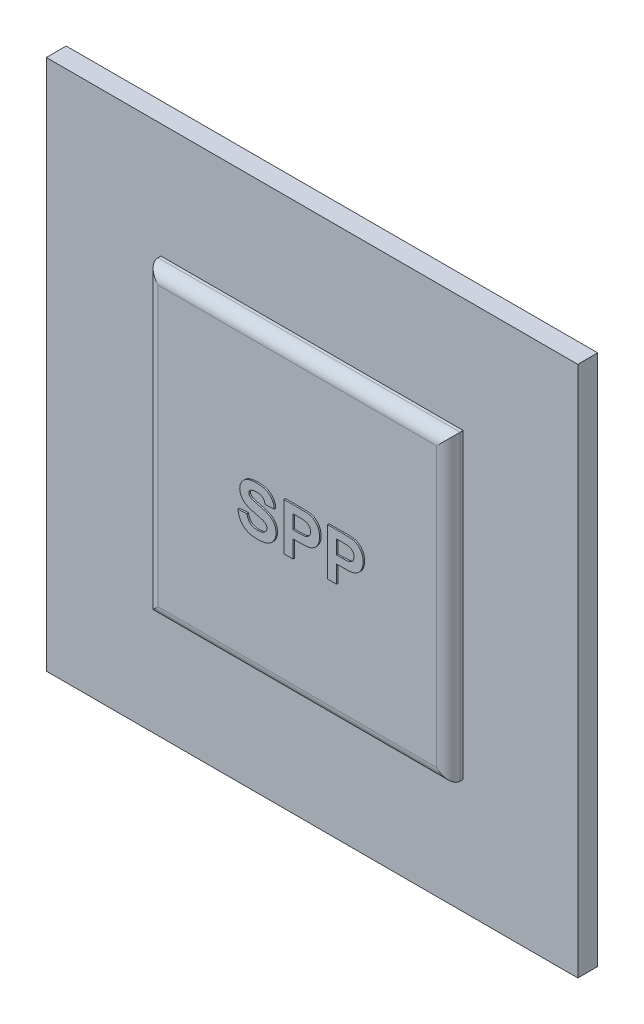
ISO-10303-21;
HEADER;
FILE_DESCRIPTION(('STEP AP214'),'2;1');
FILE_NAME('part.step','',(''),(''),'','','');
FILE_SCHEMA(('AUTOMOTIVE_DESIGN { 1 0 10303 214 1 1 1 1 }'));
ENDSEC;
DATA;
#1=APPLICATION_CONTEXT('core data for automotive mechanical design processes');
#2=APPLICATION_PROTOCOL_DEFINITION('international standard','automotive_design',2000,#1);
#3=PRODUCT_CONTEXT('',#1,'mechanical');
#4=PRODUCT('Part','Part','',(#3));
#5=PRODUCT_RELATED_PRODUCT_CATEGORY('part','',(#4));
#6=PRODUCT_DEFINITION_FORMATION('','',#4);
#7=PRODUCT_DEFINITION_CONTEXT('part definition',#1,'design');
#8=PRODUCT_DEFINITION('design','',#6,#7);
#9=PRODUCT_DEFINITION_SHAPE('','',#8);
#10=(LENGTH_UNIT() NAMED_UNIT(*) SI_UNIT(.MILLI.,.METRE.));
#11=(NAMED_UNIT(*) PLANE_ANGLE_UNIT() SI_UNIT($,.RADIAN.));
#12=(NAMED_UNIT(*) SI_UNIT($,.STERADIAN.) SOLID_ANGLE_UNIT());
#13=UNCERTAINTY_MEASURE_WITH_UNIT(LENGTH_MEASURE(1.E-05),#10,'distance_accuracy_value','');
#14=(GEOMETRIC_REPRESENTATION_CONTEXT(3) GLOBAL_UNCERTAINTY_ASSIGNED_CONTEXT((#13)) GLOBAL_UNIT_ASSIGNED_CONTEXT((#10,
#11,#12)) REPRESENTATION_CONTEXT('',''));
#15=CARTESIAN_POINT('',(0.,0.,0.));
#16=DIRECTION('',(0.,0.,1.));
#17=DIRECTION('',(1.,0.,0.));
#18=AXIS2_PLACEMENT_3D('',#15,#16,#17);
#19=CARTESIAN_POINT('',(9.86,-0.325336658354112,2.98));
#20=DIRECTION('',(0.,0.,1.));
#21=DIRECTION('',(1.,0.,0.));
#22=AXIS2_PLACEMENT_3D('',#19,#20,#21);
#23=PLANE('',#22);
#24=DIRECTION('',(-1.,0.,0.));
#25=VECTOR('',#24,1.);
#26=CARTESIAN_POINT('',(26.3598526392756,10.1689331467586,2.98));
#27=LINE('',#26,#25);
#28=CARTESIAN_POINT('',(26.3598526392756,10.1689331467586,2.98));
#29=VERTEX_POINT('',#28);
#30=CARTESIAN_POINT('',(25.579459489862,10.1689331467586,2.98));
#31=VERTEX_POINT('',#30);
#32=EDGE_CURVE('E864',#29,#31,#27,.T.);
#33=ORIENTED_EDGE('',*,*,#32,.T.);
#34=DIRECTION('',(0.,1.,0.));
#35=VECTOR('',#34,1.);
#36=CARTESIAN_POINT('',(25.579459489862,10.1689331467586,2.98));
#37=LINE('',#36,#35);
#38=CARTESIAN_POINT('',(25.579459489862,14.2269775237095,2.98));
#39=VERTEX_POINT('',#38);
#40=EDGE_CURVE('E866',#31,#39,#37,.T.);
#41=ORIENTED_EDGE('',*,*,#40,.T.);
#42=DIRECTION('',(1.,0.,0.));
#43=VECTOR('',#42,1.);
#44=CARTESIAN_POINT('',(25.579459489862,14.2269775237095,2.98));
#45=LINE('',#44,#43);
#46=CARTESIAN_POINT('',(26.8776760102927,14.2269775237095,2.98));
#47=VERTEX_POINT('',#46);
#48=EDGE_CURVE('E868',#39,#47,#45,.T.);
#49=ORIENTED_EDGE('',*,*,#48,.T.);
#50=CARTESIAN_POINT('',(26.8776760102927,14.2269775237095,2.98));
#51=CARTESIAN_POINT('',(26.9364783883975,14.226913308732,2.98));
#52=CARTESIAN_POINT('',(27.0489449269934,14.2267904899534,2.98));
#53=CARTESIAN_POINT('',(27.2093716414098,14.2233780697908,2.98));
#54=CARTESIAN_POINT('',(27.3538118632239,14.2185474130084,2.98));
#55=CARTESIAN_POINT('',(27.4820512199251,14.2125310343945,2.98));
#56=CARTESIAN_POINT('',(27.5945409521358,14.2035534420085,2.98));
#57=CARTESIAN_POINT('',(27.6907764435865,14.1931575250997,2.98));
#58=CARTESIAN_POINT('',(27.7713636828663,14.181974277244,2.98));
#59=CARTESIAN_POINT('',(27.8188191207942,14.1704011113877,2.98));
#60=CARTESIAN_POINT('',(27.8401608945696,14.165196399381,2.98));
#61=B_SPLINE_CURVE_WITH_KNOTS('',3,(#50,#51,#52,#53,#54,#55,#56,#57,#58,#59,#60),.UNSPECIFIED.,
.F.,.F.,(4,1,1,1,1,1,1,1,4),(0.,0.182560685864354,0.349169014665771,0.498161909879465,
0.631255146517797,0.747720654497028,0.848429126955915,0.931835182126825,1.),.UNSPECIFIED.);
#62=CARTESIAN_POINT('',(27.8401608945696,14.165196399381,2.98));
#63=VERTEX_POINT('',#62);
#64=EDGE_CURVE('E870',#47,#63,#61,.T.);
#65=ORIENTED_EDGE('',*,*,#64,.T.);
#66=CARTESIAN_POINT('',(27.8401608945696,14.165196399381,2.98));
#67=CARTESIAN_POINT('',(27.868540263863,14.1571043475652,2.98));
#68=CARTESIAN_POINT('',(27.9248666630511,14.1410435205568,2.98));
#69=CARTESIAN_POINT('',(28.0055648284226,14.1068043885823,2.98));
#70=CARTESIAN_POINT('',(28.0833450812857,14.0671230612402,2.98));
#71=CARTESIAN_POINT('',(28.157230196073,14.0198300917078,2.98));
#72=CARTESIAN_POINT('',(28.2274713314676,13.9657650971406,2.98));
#73=CARTESIAN_POINT('',(28.2942772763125,13.9053689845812,2.98));
#74=CARTESIAN_POINT('',(28.3580042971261,13.8383691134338,2.98));
#75=CARTESIAN_POINT('',(28.4177708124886,13.7648978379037,2.98));
#76=CARTESIAN_POINT('',(28.4725099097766,13.685325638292,2.98));
#77=CARTESIAN_POINT('',(28.5198182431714,13.5995348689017,2.98));
#78=CARTESIAN_POINT('',(28.5594527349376,13.5078984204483,2.98));
#79=CARTESIAN_POINT('',(28.59322066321,13.4111049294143,2.98));
#80=CARTESIAN_POINT('',(28.6181348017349,13.3081166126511,2.98));
#81=CARTESIAN_POINT('',(28.6355701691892,13.199649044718,2.98));
#82=CARTESIAN_POINT('',(28.647707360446,13.0856547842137,2.98));
#83=CARTESIAN_POINT('',(28.6485667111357,13.0076464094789,2.98));
#84=CARTESIAN_POINT('',(28.6490058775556,12.9677806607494,2.98));
#85=B_SPLINE_CURVE_WITH_KNOTS('',3,(#66,#67,#68,#69,#70,#71,#72,#73,#74,#75,#76,#77,#78,#79,#80,
#81,#82,#83,#84),.UNSPECIFIED.,.F.,.F.,(4,1,1,1,1,1,1,1,1,1,1,1,1,1,1,1,4),(0.,
0.0566966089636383,0.112529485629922,0.168226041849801,0.224453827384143,0.280939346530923,
0.338491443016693,0.397460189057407,0.458574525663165,0.520430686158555,0.582933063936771,
0.646631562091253,0.712213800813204,0.779824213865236,0.850065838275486,0.923376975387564,1.),.UNSPECIFIED.);
#86=CARTESIAN_POINT('',(28.6490058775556,12.9677806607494,2.98));
#87=VERTEX_POINT('',#86);
#88=EDGE_CURVE('E874',#63,#87,#85,.T.);
#89=ORIENTED_EDGE('',*,*,#88,.T.);
#90=CARTESIAN_POINT('',(28.6490058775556,12.9677806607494,2.98));
#91=CARTESIAN_POINT('',(28.6477533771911,12.907239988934,2.98));
#92=CARTESIAN_POINT('',(28.6453422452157,12.7906958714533,2.98));
#93=CARTESIAN_POINT('',(28.6183659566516,12.6236157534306,2.98));
#94=CARTESIAN_POINT('',(28.5772204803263,12.4709988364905,2.98));
#95=CARTESIAN_POINT('',(28.5170833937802,12.3343151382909,2.98));
#96=CARTESIAN_POINT('',(28.4437637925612,12.2130282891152,2.98));
#97=CARTESIAN_POINT('',(28.363000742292,12.1036887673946,2.98));
#98=CARTESIAN_POINT('',(28.2707812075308,12.0095921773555,2.98));
#99=CARTESIAN_POINT('',(28.17114613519,11.9292199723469,2.98));
#100=CARTESIAN_POINT('',(28.0658500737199,11.8634466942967,2.98));
#101=CARTESIAN_POINT('',(27.9603634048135,11.8073759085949,2.98));
#102=CARTESIAN_POINT('',(27.8532627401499,11.7642668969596,2.98));
#103=CARTESIAN_POINT('',(27.7802417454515,11.7454839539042,2.98));
#104=CARTESIAN_POINT('',(27.7442375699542,11.736222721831,2.98));
#105=B_SPLINE_CURVE_WITH_KNOTS('',3,(#90,#91,#92,#93,#94,#95,#96,#97,#98,#99,#100,#101,#102,
#103,#104),.UNSPECIFIED.,.F.,.F.,(4,1,1,1,1,1,1,1,1,1,1,1,4),(0.,0.109365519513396,
0.210534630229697,0.305156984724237,0.394451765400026,0.479483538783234,0.561008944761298,
0.639657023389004,0.717014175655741,0.791903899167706,0.86378270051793,0.932835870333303,1.),.UNSPECIFIED.);
#106=CARTESIAN_POINT('',(27.7442375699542,11.736222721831,2.98));
#107=VERTEX_POINT('',#106);
#108=EDGE_CURVE('E881',#87,#107,#105,.T.);
#109=ORIENTED_EDGE('',*,*,#108,.T.);
#110=CARTESIAN_POINT('',(27.7442375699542,11.736222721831,2.98));
#111=CARTESIAN_POINT('',(27.718539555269,11.7313343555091,2.98));
#112=CARTESIAN_POINT('',(27.6643712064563,11.7210302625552,2.98));
#113=CARTESIAN_POINT('',(27.5784634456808,11.7107589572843,2.98));
#114=CARTESIAN_POINT('',(27.4845616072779,11.6993897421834,2.98));
#115=CARTESIAN_POINT('',(27.3822794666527,11.691974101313,2.98));
#116=CARTESIAN_POINT('',(27.2717407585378,11.6850296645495,2.98));
#117=CARTESIAN_POINT('',(27.1529884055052,11.6817509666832,2.98));
#118=CARTESIAN_POINT('',(27.0261921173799,11.6778008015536,2.98));
#119=CARTESIAN_POINT('',(26.9389191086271,11.6777298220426,2.98));
#120=CARTESIAN_POINT('',(26.8939342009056,11.6776932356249,2.98));
#121=B_SPLINE_CURVE_WITH_KNOTS('',3,(#110,#111,#112,#113,#114,#115,#116,#117,#118,#119,#120),
.UNSPECIFIED.,.F.,.F.,(4,1,1,1,1,1,1,1,4),(0.,0.0919192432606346,0.193754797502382,
0.303983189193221,0.424368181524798,0.554124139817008,0.693262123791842,0.841891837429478,1.),.UNSPECIFIED.);
#122=CARTESIAN_POINT('',(26.8939342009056,11.6776932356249,2.98));
#123=VERTEX_POINT('',#122);
#124=EDGE_CURVE('E888',#107,#123,#121,.T.);
#125=ORIENTED_EDGE('',*,*,#124,.T.);
#126=DIRECTION('',(-1.,0.,0.));
#127=VECTOR('',#126,1.);
#128=CARTESIAN_POINT('',(26.8939342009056,11.6776932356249,2.98));
#129=LINE('',#128,#127);
#130=CARTESIAN_POINT('',(26.3598526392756,11.6776932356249,2.98));
#131=VERTEX_POINT('',#130);
#132=EDGE_CURVE('E34',#123,#131,#129,.T.);
#133=ORIENTED_EDGE('',*,*,#132,.T.);
#134=DIRECTION('',(0.,-1.,0.));
#135=VECTOR('',#134,1.);
#136=CARTESIAN_POINT('',(26.3598526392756,11.6776932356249,2.98));
#137=LINE('',#136,#135);
#138=EDGE_CURVE('E29',#131,#29,#137,.T.);
#139=ORIENTED_EDGE('',*,*,#138,.T.);
#140=EDGE_LOOP('',(#33,#41,#49,#65,#89,#109,#125,#133,#139));
#141=FACE_BOUND('',#140,.T.);
#142=CARTESIAN_POINT('',(19.5427933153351,10.1169069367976,2.98));
#143=CARTESIAN_POINT('',(19.4809673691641,10.1179163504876,2.98));
#144=CARTESIAN_POINT('',(19.3605907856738,10.1198817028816,2.98));
#145=CARTESIAN_POINT('',(19.1857052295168,10.1374731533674,2.98));
#146=CARTESIAN_POINT('',(19.0216741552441,10.1643981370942,2.98));
#147=CARTESIAN_POINT('',(18.868764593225,10.2034753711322,2.98));
#148=CARTESIAN_POINT('',(18.7267896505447,10.2536417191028,2.98));
#149=CARTESIAN_POINT('',(18.5958140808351,10.3154355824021,2.98));
#150=CARTESIAN_POINT('',(18.4764713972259,10.3892261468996,2.98));
#151=CARTESIAN_POINT('',(18.3672834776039,10.4732238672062,2.98));
#152=CARTESIAN_POINT('',(18.2697050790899,10.5689593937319,2.98));
#153=CARTESIAN_POINT('',(18.1819623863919,10.6744491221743,2.98));
#154=CARTESIAN_POINT('',(18.1052390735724,10.7906429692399,2.98));
#155=CARTESIAN_POINT('',(18.0395855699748,10.9173591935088,2.98));
#156=CARTESIAN_POINT('',(17.9833420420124,11.0539127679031,2.98));
#157=CARTESIAN_POINT('',(17.9369574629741,11.2003663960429,2.98));
#158=CARTESIAN_POINT('',(17.9020323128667,11.3574185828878,2.98));
#159=CARTESIAN_POINT('',(17.8871938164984,11.465936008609,2.98));
#160=CARTESIAN_POINT('',(17.8795804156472,11.5216146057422,2.98));
#161=B_SPLINE_CURVE_WITH_KNOTS('',3,(#142,#143,#144,#145,#146,#147,#148,#149,#150,#151,#152,
#153,#154,#155,#156,#157,#158,#159,#160),.UNSPECIFIED.,.F.,.F.,(4,1,1,1,1,1,1,1,1,1,1,1,1,1,1,1,
4),(0.,0.0761221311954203,0.148211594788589,0.216240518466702,0.280667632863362,
0.342309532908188,0.401420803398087,0.458656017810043,0.514793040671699,0.570722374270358,
0.626652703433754,0.683481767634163,0.741844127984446,0.802143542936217,0.86515146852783,
0.930811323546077,1.),.UNSPECIFIED.);
#162=CARTESIAN_POINT('',(19.5427933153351,10.1169069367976,2.98));
#163=VERTEX_POINT('',#162);
#164=CARTESIAN_POINT('',(17.8795804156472,11.5216146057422,2.98));
#165=VERTEX_POINT('',#164);
#166=EDGE_CURVE('E623',#163,#165,#161,.T.);
#167=ORIENTED_EDGE('',*,*,#166,.T.);
#168=DIRECTION('',(0.997785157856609,0.0665190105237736,0.));
#169=VECTOR('',#168,1.);
#170=CARTESIAN_POINT('',(17.8795804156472,11.5216146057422,2.98));
#171=LINE('',#170,#169);
#172=CARTESIAN_POINT('',(18.6599735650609,11.5736408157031,2.98));
#173=VERTEX_POINT('',#172);
#174=EDGE_CURVE('E650',#165,#173,#171,.T.);
#175=ORIENTED_EDGE('',*,*,#174,.T.);
#176=CARTESIAN_POINT('',(18.6599735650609,11.5736408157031,2.98));
#177=CARTESIAN_POINT('',(18.6661907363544,11.5409919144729,2.98));
#178=CARTESIAN_POINT('',(18.6782671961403,11.4775735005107,2.98));
#179=CARTESIAN_POINT('',(18.7050988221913,11.3871936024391,2.98));
#180=CARTESIAN_POINT('',(18.7346330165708,11.3029339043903,2.98));
#181=CARTESIAN_POINT('',(18.7699279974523,11.2256979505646,2.98));
#182=CARTESIAN_POINT('',(18.8085669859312,11.1540580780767,2.98));
#183=CARTESIAN_POINT('',(18.8537241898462,11.090055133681,2.98));
#184=CARTESIAN_POINT('',(18.9022493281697,11.031645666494,2.98));
#185=CARTESIAN_POINT('',(18.9565444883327,10.9809274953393,2.98));
#186=CARTESIAN_POINT('',(19.0156983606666,10.936507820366,2.98));
#187=CARTESIAN_POINT('',(19.0800061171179,10.8986252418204,2.98));
#188=CARTESIAN_POINT('',(19.148770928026,10.8658371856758,2.98));
#189=CARTESIAN_POINT('',(19.2221609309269,10.8388372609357,2.98));
#190=CARTESIAN_POINT('',(19.30093252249,10.8186816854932,2.98));
#191=CARTESIAN_POINT('',(19.3843994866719,10.8043421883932,2.98));
#192=CARTESIAN_POINT('',(19.4726815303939,10.7951595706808,2.98));
#193=CARTESIAN_POINT('',(19.5330152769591,10.7938953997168,2.98));
#194=CARTESIAN_POINT('',(19.5639289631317,10.7932476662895,2.98));
#195=B_SPLINE_CURVE_WITH_KNOTS('',3,(#176,#177,#178,#179,#180,#181,#182,#183,#184,#185,#186,
#187,#188,#189,#190,#191,#192,#193,#194),.UNSPECIFIED.,.F.,.F.,(4,1,1,1,1,1,1,1,1,1,1,1,1,1,1,1,
4),(0.,0.0752850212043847,0.146236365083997,0.213455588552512,0.277502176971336,
0.338529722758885,0.397651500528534,0.454744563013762,0.510361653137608,0.565638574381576,
0.622097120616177,0.679239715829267,0.73811533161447,0.799043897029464,0.863264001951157,
0.929939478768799,1.),.UNSPECIFIED.);
#196=CARTESIAN_POINT('',(19.5639289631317,10.7932476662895,2.98));
#197=VERTEX_POINT('',#196);
#198=EDGE_CURVE('E655',#173,#197,#195,.T.);
#199=ORIENTED_EDGE('',*,*,#198,.T.);
#200=CARTESIAN_POINT('',(19.5639289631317,10.7932476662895,2.98));
#201=CARTESIAN_POINT('',(19.5964675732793,10.793602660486,2.98));
#202=CARTESIAN_POINT('',(19.6597568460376,10.7942931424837,2.98));
#203=CARTESIAN_POINT('',(19.7514700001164,10.8028591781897,2.98));
#204=CARTESIAN_POINT('',(19.837225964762,10.8151309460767,2.98));
#205=CARTESIAN_POINT('',(19.9162674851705,10.8345568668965,2.98));
#206=CARTESIAN_POINT('',(19.990070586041,10.8562816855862,2.98));
#207=CARTESIAN_POINT('',(20.0568023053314,10.8860035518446,2.98));
#208=CARTESIAN_POINT('',(20.1175425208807,10.9202834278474,2.98));
#209=CARTESIAN_POINT('',(20.1721347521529,10.9591822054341,2.98));
#210=CARTESIAN_POINT('',(20.2197774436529,11.0023237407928,2.98));
#211=CARTESIAN_POINT('',(20.2614576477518,11.0473621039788,2.98));
#212=CARTESIAN_POINT('',(20.2977583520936,11.0933242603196,2.98));
#213=CARTESIAN_POINT('',(20.3263295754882,11.1422498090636,2.98));
#214=CARTESIAN_POINT('',(20.3494518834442,11.1921599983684,2.98));
#215=CARTESIAN_POINT('',(20.3647341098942,11.2445437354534,2.98));
#216=CARTESIAN_POINT('',(20.3750581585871,11.2981981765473,2.98));
#217=CARTESIAN_POINT('',(20.376242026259,11.3348673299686,2.98));
#218=CARTESIAN_POINT('',(20.376838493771,11.3533423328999,2.98));
#219=B_SPLINE_CURVE_WITH_KNOTS('',3,(#200,#201,#202,#203,#204,#205,#206,#207,#208,#209,#210,
#211,#212,#213,#214,#215,#216,#217,#218),.UNSPECIFIED.,.F.,.F.,(4,1,1,1,1,1,1,1,1,1,1,1,1,1,1,1,
4),(0.,0.0886112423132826,0.172353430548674,0.250758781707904,0.32434922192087,
0.393927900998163,0.460036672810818,0.522848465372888,0.583690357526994,0.642236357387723,
0.697606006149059,0.750761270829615,0.801401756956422,0.851620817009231,0.900196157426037,
0.949715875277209,1.),.UNSPECIFIED.);
#220=CARTESIAN_POINT('',(20.376838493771,11.3533423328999,2.98));
#221=VERTEX_POINT('',#220);
#222=EDGE_CURVE('E659',#197,#221,#219,.T.);
#223=ORIENTED_EDGE('',*,*,#222,.T.);
#224=CARTESIAN_POINT('',(20.376838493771,11.3533423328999,2.98));
#225=CARTESIAN_POINT('',(20.3761069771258,11.3764900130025,2.98));
#226=CARTESIAN_POINT('',(20.3746758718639,11.4217750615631,2.98));
#227=CARTESIAN_POINT('',(20.3574467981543,11.4865149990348,2.98));
#228=CARTESIAN_POINT('',(20.3316090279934,11.5464946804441,2.98));
#229=CARTESIAN_POINT('',(20.292706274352,11.6008282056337,2.98));
#230=CARTESIAN_POINT('',(20.2404113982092,11.6504811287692,2.98));
#231=CARTESIAN_POINT('',(20.1737040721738,11.6969302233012,2.98));
#232=CARTESIAN_POINT('',(20.0907222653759,11.738716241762,2.98));
#233=CARTESIAN_POINT('',(20.029160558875,11.7620245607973,2.98));
#234=CARTESIAN_POINT('',(19.9963968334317,11.774429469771,2.98));
#235=B_SPLINE_CURVE_WITH_KNOTS('',3,(#224,#225,#226,#227,#228,#229,#230,#231,#232,#233,#234),
.UNSPECIFIED.,.F.,.F.,(4,1,1,1,1,1,1,1,4),(0.,0.113118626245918,0.221300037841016,
0.325895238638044,0.431604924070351,0.546140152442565,0.67762339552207,0.828428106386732,1.),.UNSPECIFIED.);
#236=CARTESIAN_POINT('',(19.9963968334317,11.774429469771,2.98));
#237=VERTEX_POINT('',#236);
#238=EDGE_CURVE('E666',#221,#237,#235,.T.);
#239=ORIENTED_EDGE('',*,*,#238,.T.);
#240=CARTESIAN_POINT('',(19.9963968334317,11.774429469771,2.98));
#241=CARTESIAN_POINT('',(19.9823387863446,11.7791403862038,2.98));
#242=CARTESIAN_POINT('',(19.950879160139,11.7896826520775,2.98));
#243=CARTESIAN_POINT('',(19.8972123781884,11.8047570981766,2.98));
#244=CARTESIAN_POINT('',(19.8325693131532,11.8235810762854,2.98));
#245=CARTESIAN_POINT('',(19.7560158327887,11.8449775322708,2.98));
#246=CARTESIAN_POINT('',(19.6675776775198,11.8668604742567,2.98));
#247=CARTESIAN_POINT('',(19.5682425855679,11.8938177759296,2.98));
#248=CARTESIAN_POINT('',(19.4567995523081,11.9206424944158,2.98));
#249=CARTESIAN_POINT('',(19.3788338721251,11.9404444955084,2.98));
#250=CARTESIAN_POINT('',(19.337940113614,11.9508308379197,2.98));
#251=B_SPLINE_CURVE_WITH_KNOTS('',3,(#240,#241,#242,#243,#244,#245,#246,#247,#248,#249,#250),
.UNSPECIFIED.,.F.,.F.,(4,1,1,1,1,1,1,1,4),(0.,0.0652277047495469,0.145969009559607,
0.245215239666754,0.361497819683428,0.49567582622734,0.646054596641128,0.814352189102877,1.),.UNSPECIFIED.);
#252=CARTESIAN_POINT('',(19.337940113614,11.9508308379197,2.98));
#253=VERTEX_POINT('',#252);
#254=EDGE_CURVE('E673',#237,#253,#251,.T.);
#255=ORIENTED_EDGE('',*,*,#254,.T.);
#256=CARTESIAN_POINT('',(19.337940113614,11.9508308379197,2.98));
#257=CARTESIAN_POINT('',(19.2846843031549,11.9641275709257,2.98));
#258=CARTESIAN_POINT('',(19.1819359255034,11.9897814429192,2.98));
#259=CARTESIAN_POINT('',(19.0353932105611,12.0354178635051,2.98));
#260=CARTESIAN_POINT('',(18.900424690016,12.0807601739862,2.98));
#261=CARTESIAN_POINT('',(18.7783298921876,12.1299590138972,2.98));
#262=CARTESIAN_POINT('',(18.667762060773,12.1796800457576,2.98));
#263=CARTESIAN_POINT('',(18.5705096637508,12.2334140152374,2.98));
#264=CARTESIAN_POINT('',(18.4845432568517,12.2883703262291,2.98));
#265=CARTESIAN_POINT('',(18.4344486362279,12.3294460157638,2.98));
#266=CARTESIAN_POINT('',(18.4104103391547,12.3491565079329,2.98));
#267=B_SPLINE_CURVE_WITH_KNOTS('',3,(#256,#257,#258,#259,#260,#261,#262,#263,#264,#265,#266),
.UNSPECIFIED.,.F.,.F.,(4,1,1,1,1,1,1,1,4),(0.,0.161735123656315,0.312041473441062,
0.452204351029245,0.581220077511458,0.699855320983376,0.809223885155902,0.908454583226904,1.),.UNSPECIFIED.);
#268=CARTESIAN_POINT('',(18.4104103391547,12.3491565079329,2.98));
#269=VERTEX_POINT('',#268);
#270=EDGE_CURVE('E680',#253,#269,#267,.T.);
#271=ORIENTED_EDGE('',*,*,#270,.T.);
#272=CARTESIAN_POINT('',(18.4104103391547,12.3491565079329,2.98));
#273=CARTESIAN_POINT('',(18.3805997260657,12.3770680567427,2.98));
#274=CARTESIAN_POINT('',(18.3221532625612,12.4317912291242,2.98));
#275=CARTESIAN_POINT('',(18.2452175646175,12.5217119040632,2.98));
#276=CARTESIAN_POINT('',(18.180570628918,12.6166987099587,2.98));
#277=CARTESIAN_POINT('',(18.1273591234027,12.7160505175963,2.98));
#278=CARTESIAN_POINT('',(18.0863872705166,12.8203392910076,2.98));
#279=CARTESIAN_POINT('',(18.05734694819,12.9288669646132,2.98));
#280=CARTESIAN_POINT('',(18.0385509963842,13.0419167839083,2.98));
#281=CARTESIAN_POINT('',(18.036632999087,13.1189063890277,2.98));
#282=CARTESIAN_POINT('',(18.03565904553,13.158001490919,2.98));
#283=B_SPLINE_CURVE_WITH_KNOTS('',3,(#272,#273,#274,#275,#276,#277,#278,#279,#280,#281,#282),
.UNSPECIFIED.,.F.,.F.,(4,1,1,1,1,1,1,1,4),(0.,0.133053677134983,0.260864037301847,
0.384834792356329,0.506941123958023,0.627504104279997,0.749213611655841,0.872651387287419,1.),.UNSPECIFIED.);
#284=CARTESIAN_POINT('',(18.03565904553,13.158001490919,2.98));
#285=VERTEX_POINT('',#284);
#286=EDGE_CURVE('E687',#269,#285,#283,.T.);
#287=ORIENTED_EDGE('',*,*,#286,.T.);
#288=CARTESIAN_POINT('',(18.03565904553,13.158001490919,2.98));
#289=CARTESIAN_POINT('',(18.0375558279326,13.208590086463,2.98));
#290=CARTESIAN_POINT('',(18.0413184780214,13.3089427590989,2.98));
#291=CARTESIAN_POINT('',(18.0758244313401,13.456447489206,2.98));
#292=CARTESIAN_POINT('',(18.1295752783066,13.5987781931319,2.98));
#293=CARTESIAN_POINT('',(18.1919135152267,13.7117940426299,2.98));
#294=CARTESIAN_POINT('',(18.2518071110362,13.7972909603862,2.98));
#295=CARTESIAN_POINT('',(18.301544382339,13.8586427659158,2.98));
#296=CARTESIAN_POINT('',(18.3561855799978,13.9160621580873,2.98));
#297=CARTESIAN_POINT('',(18.4164791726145,13.968148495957,2.98));
#298=CARTESIAN_POINT('',(18.4801863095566,14.0179527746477,2.98));
#299=CARTESIAN_POINT('',(18.549775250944,14.0621795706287,2.98));
#300=CARTESIAN_POINT('',(18.6232729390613,14.1038387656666,2.98));
#301=CARTESIAN_POINT('',(18.7296324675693,14.1532238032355,2.98));
#302=CARTESIAN_POINT('',(18.8740395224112,14.2046878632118,2.98));
#303=CARTESIAN_POINT('',(19.0619208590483,14.248068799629,2.98));
#304=CARTESIAN_POINT('',(19.2664864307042,14.2741463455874,2.98));
#305=CARTESIAN_POINT('',(19.4083123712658,14.2773455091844,2.98));
#306=CARTESIAN_POINT('',(19.4818251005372,14.2790037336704,2.98));
#307=B_SPLINE_CURVE_WITH_KNOTS('',3,(#288,#289,#290,#291,#292,#293,#294,#295,#296,#297,#298,
#299,#300,#301,#302,#303,#304,#305,#306),.UNSPECIFIED.,.F.,.F.,(4,1,1,1,1,1,1,1,1,1,1,1,1,1,1,1,
4),(0.,0.0737582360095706,0.146314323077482,0.21993133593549,0.29535533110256,0.333985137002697,
0.372228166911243,0.410559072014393,0.449521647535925,0.488450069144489,0.528499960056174,
0.569766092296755,0.611707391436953,0.699546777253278,0.79300526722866,0.892708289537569,1.),.UNSPECIFIED.);
#308=CARTESIAN_POINT('',(19.4818251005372,14.2790037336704,2.98));
#309=VERTEX_POINT('',#308);
#310=EDGE_CURVE('E694',#285,#309,#307,.T.);
#311=ORIENTED_EDGE('',*,*,#310,.T.);
#312=CARTESIAN_POINT('',(19.4818251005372,14.2790037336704,2.98));
#313=CARTESIAN_POINT('',(19.5420173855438,14.2781988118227,2.98));
#314=CARTESIAN_POINT('',(19.6590900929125,14.276633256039,2.98));
#315=CARTESIAN_POINT('',(19.828800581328,14.2608021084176,2.98));
#316=CARTESIAN_POINT('',(19.9873193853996,14.2361627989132,2.98));
#317=CARTESIAN_POINT('',(20.1340902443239,14.2007931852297,2.98));
#318=CARTESIAN_POINT('',(20.2691815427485,14.1540606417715,2.98));
#319=CARTESIAN_POINT('',(20.3931169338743,14.0983933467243,2.98));
#320=CARTESIAN_POINT('',(20.5057911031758,14.0323022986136,2.98));
#321=CARTESIAN_POINT('',(20.6058323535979,13.9554082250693,2.98));
#322=CARTESIAN_POINT('',(20.6949595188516,13.870637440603,2.98));
#323=CARTESIAN_POINT('',(20.7727087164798,13.7780431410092,2.98));
#324=CARTESIAN_POINT('',(20.8393771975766,13.6787947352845,2.98));
#325=CARTESIAN_POINT('',(20.8953952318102,13.5729647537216,2.98));
#326=CARTESIAN_POINT('',(20.9393860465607,13.4600090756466,2.98));
#327=CARTESIAN_POINT('',(20.9716955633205,13.34006864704,2.98));
#328=CARTESIAN_POINT('',(20.9930653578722,13.2134257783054,2.98));
#329=CARTESIAN_POINT('',(20.9984217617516,13.1266488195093,2.98));
#330=CARTESIAN_POINT('',(21.0011530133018,13.0824009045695,2.98));
#331=B_SPLINE_CURVE_WITH_KNOTS('',3,(#312,#313,#314,#315,#316,#317,#318,#319,#320,#321,#322,
#323,#324,#325,#326,#327,#328,#329,#330),.UNSPECIFIED.,.F.,.F.,(4,1,1,1,1,1,1,1,1,1,1,1,1,1,1,1,
4),(0.,0.082820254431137,0.161083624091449,0.234349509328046,0.303452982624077,
0.368554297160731,0.430806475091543,0.490159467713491,0.547891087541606,0.604074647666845,
0.659129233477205,0.713948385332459,0.768330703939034,0.823594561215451,0.880408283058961,
0.939019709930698,1.),.UNSPECIFIED.);
#332=CARTESIAN_POINT('',(21.0011530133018,13.0824009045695,2.98));
#333=VERTEX_POINT('',#332);
#334=EDGE_CURVE('E701',#309,#333,#331,.T.);
#335=ORIENTED_EDGE('',*,*,#334,.T.);
#336=DIRECTION('',(-0.997785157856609,-0.0665190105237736,0.));
#337=VECTOR('',#336,1.);
#338=CARTESIAN_POINT('',(21.0011530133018,13.0824009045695,2.98));
#339=LINE('',#338,#337);
#340=CARTESIAN_POINT('',(20.2207598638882,13.0303746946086,2.98));
#341=VERTEX_POINT('',#340);
#342=EDGE_CURVE('E708',#333,#341,#339,.T.);
#343=ORIENTED_EDGE('',*,*,#342,.T.);
#344=CARTESIAN_POINT('',(20.2207598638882,13.0303746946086,2.98));
#345=CARTESIAN_POINT('',(20.2162579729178,13.054845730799,2.98));
#346=CARTESIAN_POINT('',(20.207484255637,13.1025372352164,2.98));
#347=CARTESIAN_POINT('',(20.1884077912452,13.1708411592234,2.98));
#348=CARTESIAN_POINT('',(20.1668904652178,13.234014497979,2.98));
#349=CARTESIAN_POINT('',(20.1417055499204,13.2920568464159,2.98));
#350=CARTESIAN_POINT('',(20.1112852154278,13.3439286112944,2.98));
#351=CARTESIAN_POINT('',(20.0781791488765,13.391261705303,2.98));
#352=CARTESIAN_POINT('',(20.0414741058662,13.4334254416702,2.98));
#353=CARTESIAN_POINT('',(19.9999547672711,13.4692652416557,2.98));
#354=CARTESIAN_POINT('',(19.9550479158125,13.5018779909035,2.98));
#355=CARTESIAN_POINT('',(19.9038699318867,13.5280178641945,2.98));
#356=CARTESIAN_POINT('',(19.8485652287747,13.5522699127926,2.98));
#357=CARTESIAN_POINT('',(19.7870297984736,13.5705015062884,2.98));
#358=CARTESIAN_POINT('',(19.7204453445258,13.5849634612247,2.98));
#359=CARTESIAN_POINT('',(19.6487730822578,13.595684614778,2.98));
#360=CARTESIAN_POINT('',(19.5718644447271,13.6009192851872,2.98));
#361=CARTESIAN_POINT('',(19.5189541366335,13.6020684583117,2.98));
#362=CARTESIAN_POINT('',(19.4915800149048,13.6026630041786,2.98));
#363=B_SPLINE_CURVE_WITH_KNOTS('',3,(#344,#345,#346,#347,#348,#349,#350,#351,#352,#353,#354,
#355,#356,#357,#358,#359,#360,#361,#362),.UNSPECIFIED.,.F.,.F.,(4,1,1,1,1,1,1,1,1,1,1,1,1,1,1,1,
4),(0.,0.0719416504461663,0.140206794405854,0.204904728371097,0.264912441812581,
0.322857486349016,0.378531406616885,0.43184329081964,0.484048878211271,0.536897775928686,
0.591950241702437,0.649895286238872,0.711384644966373,0.777188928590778,0.84691445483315,
0.920798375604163,1.),.UNSPECIFIED.);
#364=CARTESIAN_POINT('',(19.4915800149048,13.6026630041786,2.98));
#365=VERTEX_POINT('',#364);
#366=EDGE_CURVE('E713',#341,#365,#363,.T.);
#367=ORIENTED_EDGE('',*,*,#366,.T.);
#368=CARTESIAN_POINT('',(19.4915800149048,13.6026630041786,2.98));
#369=CARTESIAN_POINT('',(19.4631184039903,13.6021381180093,2.98));
#370=CARTESIAN_POINT('',(19.4077450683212,13.6011169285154,2.98));
#371=CARTESIAN_POINT('',(19.3270513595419,13.5948500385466,2.98));
#372=CARTESIAN_POINT('',(19.2513546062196,13.5832819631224,2.98));
#373=CARTESIAN_POINT('',(19.1802830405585,13.5682231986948,2.98));
#374=CARTESIAN_POINT('',(19.1139315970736,13.5477367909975,2.98));
#375=CARTESIAN_POINT('',(19.0524402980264,13.5227569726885,2.98));
#376=CARTESIAN_POINT('',(18.9955278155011,13.4933480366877,2.98));
#377=CARTESIAN_POINT('',(18.9608250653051,13.4702101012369,2.98));
#378=CARTESIAN_POINT('',(18.943678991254,13.4587780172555,2.98));
#379=B_SPLINE_CURVE_WITH_KNOTS('',3,(#368,#369,#370,#371,#372,#373,#374,#375,#376,#377,#378),
.UNSPECIFIED.,.F.,.F.,(4,1,1,1,1,1,1,1,4),(0.,0.148334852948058,0.288592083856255,
0.421400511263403,0.54715205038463,0.666859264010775,0.782766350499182,0.892668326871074,1.),.UNSPECIFIED.);
#380=CARTESIAN_POINT('',(18.943678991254,13.4587780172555,2.98));
#381=VERTEX_POINT('',#380);
#382=EDGE_CURVE('E717',#365,#381,#379,.T.);
#383=ORIENTED_EDGE('',*,*,#382,.T.);
#384=CARTESIAN_POINT('',(18.943678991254,13.4587780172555,2.98));
#385=CARTESIAN_POINT('',(18.9240567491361,13.4431614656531,2.98));
#386=CARTESIAN_POINT('',(18.8860545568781,13.4129170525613,2.98));
#387=CARTESIAN_POINT('',(18.8451561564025,13.3528619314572,2.98));
#388=CARTESIAN_POINT('',(18.8205352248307,13.2850314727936,2.98));
#389=CARTESIAN_POINT('',(18.8175718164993,13.237063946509,2.98));
#390=CARTESIAN_POINT('',(18.8160521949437,13.2124664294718,2.98));
#391=B_SPLINE_CURVE_WITH_KNOTS('',3,(#384,#385,#386,#387,#388,#389,#390),.UNSPECIFIED.,.F.,.F.,
(4,1,1,1,4),(0.,0.259464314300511,0.502501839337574,0.744885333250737,1.),.UNSPECIFIED.);
#392=CARTESIAN_POINT('',(18.8160521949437,13.2124664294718,2.98));
#393=VERTEX_POINT('',#392);
#394=EDGE_CURVE('E724',#381,#393,#391,.T.);
#395=ORIENTED_EDGE('',*,*,#394,.T.);
#396=CARTESIAN_POINT('',(18.8160521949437,13.2124664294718,2.98));
#397=CARTESIAN_POINT('',(18.8172949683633,13.1894784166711,2.98));
#398=CARTESIAN_POINT('',(18.8197430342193,13.1441956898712,2.98));
#399=CARTESIAN_POINT('',(18.8444349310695,13.0798705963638,2.98));
#400=CARTESIAN_POINT('',(18.8824077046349,13.0202687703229,2.98));
#401=CARTESIAN_POINT('',(18.9178870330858,12.9878922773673,2.98));
#402=CARTESIAN_POINT('',(18.9363628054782,12.9710322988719,2.98));
#403=B_SPLINE_CURVE_WITH_KNOTS('',3,(#396,#397,#398,#399,#400,#401,#402),.UNSPECIFIED.,.F.,.F.,
(4,1,1,1,4),(0.,0.246345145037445,0.485260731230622,0.731950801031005,1.),.UNSPECIFIED.);
#404=CARTESIAN_POINT('',(18.9363628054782,12.9710322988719,2.98));
#405=VERTEX_POINT('',#404);
#406=EDGE_CURVE('E731',#393,#405,#403,.T.);
#407=ORIENTED_EDGE('',*,*,#406,.T.);
#408=CARTESIAN_POINT('',(18.9363628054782,12.9710322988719,2.98));
#409=CARTESIAN_POINT('',(18.9510257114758,12.9600893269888,2.98));
#410=CARTESIAN_POINT('',(18.9837912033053,12.9356363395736,2.98));
#411=CARTESIAN_POINT('',(19.043811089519,12.9045542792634,2.98));
#412=CARTESIAN_POINT('',(19.1162566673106,12.8708905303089,2.98));
#413=CARTESIAN_POINT('',(19.202779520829,12.8379804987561,2.98));
#414=CARTESIAN_POINT('',(19.3028046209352,12.8051315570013,2.98));
#415=CARTESIAN_POINT('',(19.4163380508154,12.7708334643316,2.98));
#416=CARTESIAN_POINT('',(19.5434496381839,12.7360748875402,2.98));
#417=CARTESIAN_POINT('',(19.6808993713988,12.7024129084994,2.98));
#418=CARTESIAN_POINT('',(19.8204495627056,12.6693251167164,2.98));
#419=CARTESIAN_POINT('',(19.9536184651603,12.6331508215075,2.98));
#420=CARTESIAN_POINT('',(20.0774463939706,12.5978836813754,2.98));
#421=CARTESIAN_POINT('',(20.1913591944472,12.560917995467,2.98));
#422=CARTESIAN_POINT('',(20.2959440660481,12.5249320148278,2.98));
#423=CARTESIAN_POINT('',(20.3906929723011,12.4879718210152,2.98));
#424=CARTESIAN_POINT('',(20.4762564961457,12.4519767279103,2.98));
#425=CARTESIAN_POINT('',(20.5760330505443,12.4024809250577,2.98));
#426=CARTESIAN_POINT('',(20.6891197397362,12.335436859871,2.98));
#427=CARTESIAN_POINT('',(20.8076473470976,12.2379771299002,2.98));
#428=CARTESIAN_POINT('',(20.9124698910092,12.1284260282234,2.98));
#429=CARTESIAN_POINT('',(20.9855074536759,12.0251268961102,2.98));
#430=CARTESIAN_POINT('',(21.0356804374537,11.9362868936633,2.98));
#431=CARTESIAN_POINT('',(21.0679865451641,11.865471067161,2.98));
#432=CARTESIAN_POINT('',(21.0959338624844,11.790849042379,2.98));
#433=CARTESIAN_POINT('',(21.1186829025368,11.7123383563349,2.98));
#434=CARTESIAN_POINT('',(21.1351704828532,11.6298285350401,2.98));
#435=CARTESIAN_POINT('',(21.148814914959,11.5439499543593,2.98));
#436=CARTESIAN_POINT('',(21.1557861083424,11.4539893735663,2.98));
#437=CARTESIAN_POINT('',(21.1567446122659,11.3926426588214,2.98));
#438=CARTESIAN_POINT('',(21.1572316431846,11.3614714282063,2.98));
#439=B_SPLINE_CURVE_WITH_KNOTS('',3,(#408,#409,#410,#411,#412,#413,#414,#415,#416,#417,#418,
#419,#420,#421,#422,#423,#424,#425,#426,#427,#428,#429,#430,#431,#432,#433,#434,#435,#436,#437,
#438),.UNSPECIFIED.,.F.,.F.,(4,1,1,1,1,1,1,1,1,1,1,1,1,1,1,1,1,1,1,1,1,1,1,1,1,1,1,1,4),(0.,
0.0182812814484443,0.0408510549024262,0.0674199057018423,0.0982356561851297,0.133389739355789,
0.172760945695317,0.216897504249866,0.265231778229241,0.314355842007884,0.360395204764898,
0.403300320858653,0.44317250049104,0.480216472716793,0.513952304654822,0.544926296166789,
0.573058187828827,0.625371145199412,0.676059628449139,0.726117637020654,0.776674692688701,
0.80216752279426,0.828130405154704,0.854469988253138,0.881844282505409,0.9098149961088,
0.93861322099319,0.968808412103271,1.),.UNSPECIFIED.);
#440=CARTESIAN_POINT('',(21.1572316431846,11.3614714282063,2.98));
#441=VERTEX_POINT('',#440);
#442=EDGE_CURVE('E738',#405,#441,#439,.T.);
#443=ORIENTED_EDGE('',*,*,#442,.T.);
#444=CARTESIAN_POINT('',(21.1572316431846,11.3614714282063,2.98));
#445=CARTESIAN_POINT('',(21.1565619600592,11.3327245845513,2.98));
#446=CARTESIAN_POINT('',(21.1552320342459,11.2756361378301,2.98));
#447=CARTESIAN_POINT('',(21.1459381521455,11.1909024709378,2.98));
#448=CARTESIAN_POINT('',(21.131565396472,11.1076735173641,2.98));
#449=CARTESIAN_POINT('',(21.1102887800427,11.0258449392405,2.98));
#450=CARTESIAN_POINT('',(21.0820631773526,10.9455777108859,2.98));
#451=CARTESIAN_POINT('',(21.0502833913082,10.8657133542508,2.98));
#452=CARTESIAN_POINT('',(21.0105445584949,10.7879935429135,2.98));
#453=CARTESIAN_POINT('',(20.9653163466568,10.712353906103,2.98));
#454=CARTESIAN_POINT('',(20.9154275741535,10.6388512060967,2.98));
#455=CARTESIAN_POINT('',(20.8588943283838,10.5710466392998,2.98));
#456=CARTESIAN_POINT('',(20.7990371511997,10.5066780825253,2.98));
#457=CARTESIAN_POINT('',(20.7320313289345,10.4493498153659,2.98));
#458=CARTESIAN_POINT('',(20.6620146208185,10.394419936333,2.98));
#459=CARTESIAN_POINT('',(20.5857845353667,10.3457731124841,2.98));
#460=CARTESIAN_POINT('',(20.5051270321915,10.3017520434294,2.98));
#461=CARTESIAN_POINT('',(20.419532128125,10.2626853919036,2.98));
#462=CARTESIAN_POINT('',(20.3286963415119,10.2286423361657,2.98));
#463=CARTESIAN_POINT('',(20.2327376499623,10.1983416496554,2.98));
#464=CARTESIAN_POINT('',(20.1307915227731,10.1735428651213,2.98));
#465=CARTESIAN_POINT('',(20.0237080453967,10.1522871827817,2.98));
#466=CARTESIAN_POINT('',(19.9110953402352,10.1361227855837,2.98));
#467=CARTESIAN_POINT('',(19.7930941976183,10.1248362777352,2.98));
#468=CARTESIAN_POINT('',(19.6696777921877,10.1184713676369,2.98));
#469=CARTESIAN_POINT('',(19.5856136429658,10.1174348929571,2.98));
#470=CARTESIAN_POINT('',(19.5427933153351,10.1169069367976,2.98));
#471=B_SPLINE_CURVE_WITH_KNOTS('',3,(#444,#445,#446,#447,#448,#449,#450,#451,#452,#453,#454,
#455,#456,#457,#458,#459,#460,#461,#462,#463,#464,#465,#466,#467,#468,#469,#470),.UNSPECIFIED.,
.F.,.F.,(4,1,1,1,1,1,1,1,1,1,1,1,1,1,1,1,1,1,1,1,1,1,1,1,4),(0.,0.0375237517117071,
0.0745185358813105,0.111158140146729,0.147708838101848,0.184737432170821,0.222181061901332,
0.259832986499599,0.298538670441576,0.337199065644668,0.375653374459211,0.41368722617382,
0.451790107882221,0.490634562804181,0.529785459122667,0.569677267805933,0.610517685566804,
0.652500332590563,0.696246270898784,0.74180401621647,0.789395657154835,0.838722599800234,
0.890254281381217,0.944098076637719,1.),.UNSPECIFIED.);
#472=EDGE_CURVE('E745',#441,#163,#471,.T.);
#473=ORIENTED_EDGE('',*,*,#472,.T.);
#474=EDGE_LOOP('',(#167,#175,#199,#223,#239,#255,#271,#287,#311,#335,#343,#367,#383,#395,#407,
#443,#473));
#475=FACE_BOUND('',#474,.T.);
#476=DIRECTION('',(0.,1.,0.));
#477=VECTOR('',#476,1.);
#478=CARTESIAN_POINT('',(34.844,25.6746633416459,2.98));
#479=LINE('',#478,#477);
#480=CARTESIAN_POINT('',(34.844,0.690663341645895,2.98));
#481=VERTEX_POINT('',#480);
#482=CARTESIAN_POINT('',(34.844,24.6586633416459,2.98));
#483=VERTEX_POINT('',#482);
#484=EDGE_CURVE('E1178',#481,#483,#479,.T.);
#485=ORIENTED_EDGE('',*,*,#484,.T.);
#486=DIRECTION('',(-1.,0.,0.));
#487=VECTOR('',#486,1.);
#488=CARTESIAN_POINT('',(9.86,24.6586633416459,2.98));
#489=LINE('',#488,#487);
#490=CARTESIAN_POINT('',(10.876,24.6586633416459,2.98));
#491=VERTEX_POINT('',#490);
#492=EDGE_CURVE('E1180',#483,#491,#489,.T.);
#493=ORIENTED_EDGE('',*,*,#492,.T.);
#494=DIRECTION('',(0.,-1.,0.));
#495=VECTOR('',#494,1.);
#496=CARTESIAN_POINT('',(10.876,-0.325336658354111,2.98));
#497=LINE('',#496,#495);
#498=CARTESIAN_POINT('',(10.876,0.690663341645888,2.98));
#499=VERTEX_POINT('',#498);
#500=EDGE_CURVE('E1174',#491,#499,#497,.T.);
#501=ORIENTED_EDGE('',*,*,#500,.T.);
#502=DIRECTION('',(1.,0.,0.));
#503=VECTOR('',#502,1.);
#504=CARTESIAN_POINT('',(35.86,0.690663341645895,2.98));
#505=LINE('',#504,#503);
#506=EDGE_CURVE('E1176',#499,#481,#505,.T.);
#507=ORIENTED_EDGE('',*,*,#506,.T.);
#508=EDGE_LOOP('',(#485,#493,#501,#507));
#509=FACE_BOUND('',#508,.T.);
#510=DIRECTION('',(-1.,0.,0.));
#511=VECTOR('',#510,1.);
#512=CARTESIAN_POINT('',(22.61396552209,10.1689331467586,2.98));
#513=LINE('',#512,#511);
#514=CARTESIAN_POINT('',(22.61396552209,10.1689331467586,2.98));
#515=VERTEX_POINT('',#514);
#516=CARTESIAN_POINT('',(21.8335723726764,10.1689331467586,2.98));
#517=VERTEX_POINT('',#516);
#518=EDGE_CURVE('E964',#515,#517,#513,.T.);
#519=ORIENTED_EDGE('',*,*,#518,.T.);
#520=DIRECTION('',(0.,1.,0.));
#521=VECTOR('',#520,1.);
#522=CARTESIAN_POINT('',(21.8335723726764,10.1689331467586,2.98));
#523=LINE('',#522,#521);
#524=CARTESIAN_POINT('',(21.8335723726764,14.2269775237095,2.98));
#525=VERTEX_POINT('',#524);
#526=EDGE_CURVE('E966',#517,#525,#523,.T.);
#527=ORIENTED_EDGE('',*,*,#526,.T.);
#528=DIRECTION('',(1.,0.,0.));
#529=VECTOR('',#528,1.);
#530=CARTESIAN_POINT('',(21.8335723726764,14.2269775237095,2.98));
#531=LINE('',#530,#529);
#532=CARTESIAN_POINT('',(23.1317888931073,14.2269775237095,2.98));
#533=VERTEX_POINT('',#532);
#534=EDGE_CURVE('E968',#525,#533,#531,.T.);
#535=ORIENTED_EDGE('',*,*,#534,.T.);
#536=CARTESIAN_POINT('',(23.1317888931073,14.2269775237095,2.98));
#537=CARTESIAN_POINT('',(23.190591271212,14.226913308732,2.98));
#538=CARTESIAN_POINT('',(23.3030578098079,14.2267904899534,2.98));
#539=CARTESIAN_POINT('',(23.4634845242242,14.2233780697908,2.98));
#540=CARTESIAN_POINT('',(23.6079247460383,14.2185474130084,2.98));
#541=CARTESIAN_POINT('',(23.7361641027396,14.2125310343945,2.98));
#542=CARTESIAN_POINT('',(23.8486538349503,14.2035534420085,2.98));
#543=CARTESIAN_POINT('',(23.9448893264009,14.1931575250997,2.98));
#544=CARTESIAN_POINT('',(24.0254765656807,14.181974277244,2.98));
#545=CARTESIAN_POINT('',(24.0729320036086,14.1704011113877,2.98));
#546=CARTESIAN_POINT('',(24.0942737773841,14.165196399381,2.98));
#547=B_SPLINE_CURVE_WITH_KNOTS('',3,(#536,#537,#538,#539,#540,#541,#542,#543,#544,#545,#546),
.UNSPECIFIED.,.F.,.F.,(4,1,1,1,1,1,1,1,4),(0.,0.182560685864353,0.34916901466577,
0.498161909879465,0.631255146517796,0.747720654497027,0.848429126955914,0.931835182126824,1.),.UNSPECIFIED.);
#548=CARTESIAN_POINT('',(24.0942737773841,14.165196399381,2.98));
#549=VERTEX_POINT('',#548);
#550=EDGE_CURVE('E970',#533,#549,#547,.T.);
#551=ORIENTED_EDGE('',*,*,#550,.T.);
#552=CARTESIAN_POINT('',(24.0942737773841,14.165196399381,2.98));
#553=CARTESIAN_POINT('',(24.1226531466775,14.1571043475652,2.98));
#554=CARTESIAN_POINT('',(24.1789795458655,14.1410435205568,2.98));
#555=CARTESIAN_POINT('',(24.2596777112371,14.1068043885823,2.98));
#556=CARTESIAN_POINT('',(24.3374579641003,14.0671230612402,2.98));
#557=CARTESIAN_POINT('',(24.4113430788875,14.0198300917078,2.98));
#558=CARTESIAN_POINT('',(24.4815842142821,13.9657650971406,2.98));
#559=CARTESIAN_POINT('',(24.548390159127,13.9053689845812,2.98));
#560=CARTESIAN_POINT('',(24.6121171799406,13.8383691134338,2.98));
#561=CARTESIAN_POINT('',(24.6718836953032,13.7648978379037,2.98));
#562=CARTESIAN_POINT('',(24.726622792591,13.685325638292,2.98));
#563=CARTESIAN_POINT('',(24.7739311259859,13.5995348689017,2.98));
#564=CARTESIAN_POINT('',(24.813565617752,13.5078984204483,2.98));
#565=CARTESIAN_POINT('',(24.8473335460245,13.4111049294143,2.98));
#566=CARTESIAN_POINT('',(24.8722476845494,13.3081166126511,2.98));
#567=CARTESIAN_POINT('',(24.8896830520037,13.199649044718,2.98));
#568=CARTESIAN_POINT('',(24.9018202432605,13.0856547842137,2.98));
#569=CARTESIAN_POINT('',(24.9026795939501,13.0076464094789,2.98));
#570=CARTESIAN_POINT('',(24.9031187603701,12.9677806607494,2.98));
#571=B_SPLINE_CURVE_WITH_KNOTS('',3,(#552,#553,#554,#555,#556,#557,#558,#559,#560,#561,#562,
#563,#564,#565,#566,#567,#568,#569,#570),.UNSPECIFIED.,.F.,.F.,(4,1,1,1,1,1,1,1,1,1,1,1,1,1,1,1,
4),(0.,0.0566966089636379,0.112529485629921,0.168226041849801,0.224453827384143,
0.280939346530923,0.338491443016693,0.397460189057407,0.458574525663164,0.520430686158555,
0.582933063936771,0.646631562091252,0.712213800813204,0.779824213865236,0.850065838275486,
0.923376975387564,1.),.UNSPECIFIED.);
#572=CARTESIAN_POINT('',(24.9031187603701,12.9677806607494,2.98));
#573=VERTEX_POINT('',#572);
#574=EDGE_CURVE('E974',#549,#573,#571,.T.);
#575=ORIENTED_EDGE('',*,*,#574,.T.);
#576=CARTESIAN_POINT('',(24.9031187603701,12.9677806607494,2.98));
#577=CARTESIAN_POINT('',(24.9018662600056,12.907239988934,2.98));
#578=CARTESIAN_POINT('',(24.8994551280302,12.7906958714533,2.98));
#579=CARTESIAN_POINT('',(24.8724788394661,12.6236157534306,2.98));
#580=CARTESIAN_POINT('',(24.8313333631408,12.4709988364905,2.98));
#581=CARTESIAN_POINT('',(24.7711962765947,12.3343151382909,2.98));
#582=CARTESIAN_POINT('',(24.6978766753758,12.2130282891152,2.98));
#583=CARTESIAN_POINT('',(24.6171136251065,12.1036887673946,2.98));
#584=CARTESIAN_POINT('',(24.5248940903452,12.0095921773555,2.98));
#585=CARTESIAN_POINT('',(24.4252590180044,11.9292199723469,2.98));
#586=CARTESIAN_POINT('',(24.3199629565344,11.8634466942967,2.98));
#587=CARTESIAN_POINT('',(24.214476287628,11.8073759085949,2.98));
#588=CARTESIAN_POINT('',(24.1073756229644,11.7642668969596,2.98));
#589=CARTESIAN_POINT('',(24.0343546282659,11.7454839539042,2.98));
#590=CARTESIAN_POINT('',(23.9983504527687,11.736222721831,2.98));
#591=B_SPLINE_CURVE_WITH_KNOTS('',3,(#576,#577,#578,#579,#580,#581,#582,#583,#584,#585,#586,
#587,#588,#589,#590),.UNSPECIFIED.,.F.,.F.,(4,1,1,1,1,1,1,1,1,1,1,1,4),(0.,0.109365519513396,
0.210534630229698,0.305156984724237,0.394451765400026,0.479483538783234,0.561008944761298,
0.639657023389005,0.717014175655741,0.791903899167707,0.86378270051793,0.932835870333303,1.),.UNSPECIFIED.);
#592=CARTESIAN_POINT('',(23.9983504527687,11.736222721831,2.98));
#593=VERTEX_POINT('',#592);
#594=EDGE_CURVE('E981',#573,#593,#591,.T.);
#595=ORIENTED_EDGE('',*,*,#594,.T.);
#596=CARTESIAN_POINT('',(23.9983504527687,11.736222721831,2.98));
#597=CARTESIAN_POINT('',(23.9726524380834,11.7313343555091,2.98));
#598=CARTESIAN_POINT('',(23.9184840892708,11.7210302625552,2.98));
#599=CARTESIAN_POINT('',(23.8325763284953,11.7107589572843,2.98));
#600=CARTESIAN_POINT('',(23.7386744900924,11.6993897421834,2.98));
#601=CARTESIAN_POINT('',(23.6363923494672,11.691974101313,2.98));
#602=CARTESIAN_POINT('',(23.5258536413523,11.6850296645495,2.98));
#603=CARTESIAN_POINT('',(23.4071012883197,11.6817509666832,2.98));
#604=CARTESIAN_POINT('',(23.2803050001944,11.6778008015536,2.98));
#605=CARTESIAN_POINT('',(23.1930319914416,11.6777298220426,2.98));
#606=CARTESIAN_POINT('',(23.1480470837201,11.6776932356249,2.98));
#607=B_SPLINE_CURVE_WITH_KNOTS('',3,(#596,#597,#598,#599,#600,#601,#602,#603,#604,#605,#606),
.UNSPECIFIED.,.F.,.F.,(4,1,1,1,1,1,1,1,4),(0.,0.0919192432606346,0.193754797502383,
0.303983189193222,0.424368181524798,0.554124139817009,0.693262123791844,0.841891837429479,1.),.UNSPECIFIED.);
#608=CARTESIAN_POINT('',(23.1480470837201,11.6776932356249,2.98));
#609=VERTEX_POINT('',#608);
#610=EDGE_CURVE('E988',#593,#609,#607,.T.);
#611=ORIENTED_EDGE('',*,*,#610,.T.);
#612=DIRECTION('',(-1.,0.,0.));
#613=VECTOR('',#612,1.);
#614=CARTESIAN_POINT('',(23.1480470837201,11.6776932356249,2.98));
#615=LINE('',#614,#613);
#616=CARTESIAN_POINT('',(22.61396552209,11.6776932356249,2.98));
#617=VERTEX_POINT('',#616);
#618=EDGE_CURVE('E995',#609,#617,#615,.T.);
#619=ORIENTED_EDGE('',*,*,#618,.T.);
#620=DIRECTION('',(0.,-1.,0.));
#621=VECTOR('',#620,1.);
#622=CARTESIAN_POINT('',(22.61396552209,11.6776932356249,2.98));
#623=LINE('',#622,#621);
#624=EDGE_CURVE('E1000',#617,#515,#623,.T.);
#625=ORIENTED_EDGE('',*,*,#624,.T.);
#626=EDGE_LOOP('',(#519,#527,#535,#551,#575,#595,#611,#619,#625));
#627=FACE_BOUND('',#626,.T.);
#628=ADVANCED_FACE('F14',(#141,#475,#509,#627),#23,.T.);
#629=CARTESIAN_POINT('',(0.,-10.1853366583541,1.71));
#630=DIRECTION('',(0.,0.,1.));
#631=DIRECTION('',(1.,0.,0.));
#632=AXIS2_PLACEMENT_3D('',#629,#630,#631);
#633=PLANE('',#632);
#634=DIRECTION('',(0.,-1.,0.));
#635=VECTOR('',#634,1.);
#636=CARTESIAN_POINT('',(0.,35.5346633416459,1.71));
#637=LINE('',#636,#635);
#638=CARTESIAN_POINT('',(0.,35.5346633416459,1.71));
#639=VERTEX_POINT('',#638);
#640=CARTESIAN_POINT('',(0.,-10.1853366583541,1.71));
#641=VERTEX_POINT('',#640);
#642=EDGE_CURVE('E1153',#639,#641,#637,.T.);
#643=ORIENTED_EDGE('',*,*,#642,.T.);
#644=DIRECTION('',(1.,0.,0.));
#645=VECTOR('',#644,1.);
#646=CARTESIAN_POINT('',(0.,-10.1853366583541,1.71));
#647=LINE('',#646,#645);
#648=CARTESIAN_POINT('',(45.72,-10.1853366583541,1.71));
#649=VERTEX_POINT('',#648);
#650=EDGE_CURVE('E1156',#641,#649,#647,.T.);
#651=ORIENTED_EDGE('',*,*,#650,.T.);
#652=DIRECTION('',(0.,1.,0.));
#653=VECTOR('',#652,1.);
#654=CARTESIAN_POINT('',(45.72,35.5346633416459,1.71));
#655=LINE('',#654,#653);
#656=CARTESIAN_POINT('',(45.72,35.5346633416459,1.71));
#657=VERTEX_POINT('',#656);
#658=EDGE_CURVE('E1158',#649,#657,#655,.T.);
#659=ORIENTED_EDGE('',*,*,#658,.T.);
#660=DIRECTION('',(-1.,0.,0.));
#661=VECTOR('',#660,1.);
#662=CARTESIAN_POINT('',(0.,35.5346633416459,1.71));
#663=LINE('',#662,#661);
#664=EDGE_CURVE('E1160',#657,#639,#663,.T.);
#665=ORIENTED_EDGE('',*,*,#664,.T.);
#666=EDGE_LOOP('',(#643,#651,#659,#665));
#667=FACE_BOUND('',#666,.T.);
#668=DIRECTION('',(1.,0.,0.));
#669=VECTOR('',#668,1.);
#670=CARTESIAN_POINT('',(9.86,-0.325336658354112,1.71));
#671=LINE('',#670,#669);
#672=CARTESIAN_POINT('',(9.86,-0.325336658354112,1.71));
#673=VERTEX_POINT('',#672);
#674=CARTESIAN_POINT('',(35.86,-0.325336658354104,1.71));
#675=VERTEX_POINT('',#674);
#676=EDGE_CURVE('E1127',#673,#675,#671,.T.);
#677=ORIENTED_EDGE('',*,*,#676,.F.);
#678=DIRECTION('',(0.,-1.,0.));
#679=VECTOR('',#678,1.);
#680=CARTESIAN_POINT('',(9.86,25.6746633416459,1.71));
#681=LINE('',#680,#679);
#682=CARTESIAN_POINT('',(9.86,25.6746633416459,1.71));
#683=VERTEX_POINT('',#682);
#684=EDGE_CURVE('E1124',#683,#673,#681,.T.);
#685=ORIENTED_EDGE('',*,*,#684,.F.);
#686=DIRECTION('',(-1.,0.,0.));
#687=VECTOR('',#686,1.);
#688=CARTESIAN_POINT('',(9.86,25.6746633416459,1.71));
#689=LINE('',#688,#687);
#690=CARTESIAN_POINT('',(35.86,25.6746633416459,1.71));
#691=VERTEX_POINT('',#690);
#692=EDGE_CURVE('E1133',#691,#683,#689,.T.);
#693=ORIENTED_EDGE('',*,*,#692,.F.);
#694=DIRECTION('',(0.,1.,0.));
#695=VECTOR('',#694,1.);
#696=CARTESIAN_POINT('',(35.86,25.6746633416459,1.71));
#697=LINE('',#696,#695);
#698=EDGE_CURVE('E1130',#675,#691,#697,.T.);
#699=ORIENTED_EDGE('',*,*,#698,.F.);
#700=EDGE_LOOP('',(#677,#685,#693,#699));
#701=FACE_BOUND('',#700,.T.);
#702=ADVANCED_FACE('F816',(#667,#701),#633,.T.);
#703=CARTESIAN_POINT('',(0.,35.5346633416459,1.71));
#704=DIRECTION('',(1.,0.,0.));
#705=DIRECTION('',(0.,1.,0.));
#706=AXIS2_PLACEMENT_3D('',#703,#704,#705);
#707=PLANE('',#706);
#708=DIRECTION('',(0.,-1.,0.));
#709=VECTOR('',#708,1.);
#710=CARTESIAN_POINT('',(0.,35.5346633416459,0.));
#711=LINE('',#710,#709);
#712=CARTESIAN_POINT('',(0.,35.5346633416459,0.));
#713=VERTEX_POINT('',#712);
#714=CARTESIAN_POINT('',(0.,-10.1853366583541,0.));
#715=VERTEX_POINT('',#714);
#716=EDGE_CURVE('E1144',#713,#715,#711,.T.);
#717=ORIENTED_EDGE('',*,*,#716,.T.);
#718=DIRECTION('',(0.,0.,-1.));
#719=VECTOR('',#718,1.);
#720=CARTESIAN_POINT('',(0.,-10.1853366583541,1.71));
#721=LINE('',#720,#719);
#722=EDGE_CURVE('E1171',#641,#715,#721,.T.);
#723=ORIENTED_EDGE('',*,*,#722,.F.);
#724=ORIENTED_EDGE('',*,*,#642,.F.);
#725=DIRECTION('',(0.,0.,-1.));
#726=VECTOR('',#725,1.);
#727=CARTESIAN_POINT('',(0.,35.5346633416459,1.71));
#728=LINE('',#727,#726);
#729=EDGE_CURVE('E1162',#639,#713,#728,.T.);
#730=ORIENTED_EDGE('',*,*,#729,.T.);
#731=EDGE_LOOP('',(#717,#723,#724,#730));
#732=FACE_BOUND('',#731,.T.);
#733=ADVANCED_FACE('F16',(#732),#707,.F.);
#734=CARTESIAN_POINT('',(0.,-10.1853366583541,1.71));
#735=DIRECTION('',(0.,1.,0.));
#736=DIRECTION('',(0.,0.,1.));
#737=AXIS2_PLACEMENT_3D('',#734,#735,#736);
#738=PLANE('',#737);
#739=DIRECTION('',(1.,0.,0.));
#740=VECTOR('',#739,1.);
#741=CARTESIAN_POINT('',(0.,-10.1853366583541,0.));
#742=LINE('',#741,#740);
#743=CARTESIAN_POINT('',(45.72,-10.1853366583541,0.));
#744=VERTEX_POINT('',#743);
#745=EDGE_CURVE('E1147',#715,#744,#742,.T.);
#746=ORIENTED_EDGE('',*,*,#745,.T.);
#747=DIRECTION('',(0.,0.,-1.));
#748=VECTOR('',#747,1.);
#749=CARTESIAN_POINT('',(45.72,-10.1853366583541,1.71));
#750=LINE('',#749,#748);
#751=EDGE_CURVE('E1168',#649,#744,#750,.T.);
#752=ORIENTED_EDGE('',*,*,#751,.F.);
#753=ORIENTED_EDGE('',*,*,#650,.F.);
#754=ORIENTED_EDGE('',*,*,#722,.T.);
#755=EDGE_LOOP('',(#746,#752,#753,#754));
#756=FACE_BOUND('',#755,.T.);
#757=ADVANCED_FACE('F825',(#756),#738,.F.);
#758=CARTESIAN_POINT('',(45.72,35.5346633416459,1.71));
#759=DIRECTION('',(-1.,0.,0.));
#760=DIRECTION('',(0.,-1.,0.));
#761=AXIS2_PLACEMENT_3D('',#758,#759,#760);
#762=PLANE('',#761);
#763=DIRECTION('',(0.,1.,0.));
#764=VECTOR('',#763,1.);
#765=CARTESIAN_POINT('',(45.72,35.5346633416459,0.));
#766=LINE('',#765,#764);
#767=CARTESIAN_POINT('',(45.72,35.5346633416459,0.));
#768=VERTEX_POINT('',#767);
#769=EDGE_CURVE('E1149',#744,#768,#766,.T.);
#770=ORIENTED_EDGE('',*,*,#769,.T.);
#771=DIRECTION('',(0.,0.,-1.));
#772=VECTOR('',#771,1.);
#773=CARTESIAN_POINT('',(45.72,35.5346633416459,1.71));
#774=LINE('',#773,#772);
#775=EDGE_CURVE('E1165',#657,#768,#774,.T.);
#776=ORIENTED_EDGE('',*,*,#775,.F.);
#777=ORIENTED_EDGE('',*,*,#658,.F.);
#778=ORIENTED_EDGE('',*,*,#751,.T.);
#779=EDGE_LOOP('',(#770,#776,#777,#778));
#780=FACE_BOUND('',#779,.T.);
#781=ADVANCED_FACE('F822',(#780),#762,.F.);
#782=CARTESIAN_POINT('',(0.,35.5346633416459,1.71));
#783=DIRECTION('',(0.,-1.,0.));
#784=DIRECTION('',(0.,0.,-1.));
#785=AXIS2_PLACEMENT_3D('',#782,#783,#784);
#786=PLANE('',#785);
#787=DIRECTION('',(-1.,0.,0.));
#788=VECTOR('',#787,1.);
#789=CARTESIAN_POINT('',(0.,35.5346633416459,0.));
#790=LINE('',#789,#788);
#791=EDGE_CURVE('E1151',#768,#713,#790,.T.);
#792=ORIENTED_EDGE('',*,*,#791,.T.);
#793=ORIENTED_EDGE('',*,*,#729,.F.);
#794=ORIENTED_EDGE('',*,*,#664,.F.);
#795=ORIENTED_EDGE('',*,*,#775,.T.);
#796=EDGE_LOOP('',(#792,#793,#794,#795));
#797=FACE_BOUND('',#796,.T.);
#798=ADVANCED_FACE('F814',(#797),#786,.F.);
#799=CARTESIAN_POINT('',(0.,-10.1853366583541,0.));
#800=DIRECTION('',(0.,0.,1.));
#801=DIRECTION('',(1.,0.,0.));
#802=AXIS2_PLACEMENT_3D('',#799,#800,#801);
#803=PLANE('',#802);
#804=ORIENTED_EDGE('',*,*,#716,.F.);
#805=ORIENTED_EDGE('',*,*,#791,.F.);
#806=ORIENTED_EDGE('',*,*,#769,.F.);
#807=ORIENTED_EDGE('',*,*,#745,.F.);
#808=EDGE_LOOP('',(#804,#805,#806,#807));
#809=FACE_BOUND('',#808,.T.);
#810=ADVANCED_FACE('F810',(#809),#803,.F.);
#811=CARTESIAN_POINT('',(9.86,25.6746633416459,2.98));
#812=DIRECTION('',(1.,0.,0.));
#813=DIRECTION('',(0.,1.,0.));
#814=AXIS2_PLACEMENT_3D('',#811,#812,#813);
#815=PLANE('',#814);
#816=DIRECTION('',(0.,0.,-1.));
#817=VECTOR('',#816,1.);
#818=CARTESIAN_POINT('',(9.86,-0.325336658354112,2.98));
#819=LINE('',#818,#817);
#820=CARTESIAN_POINT('',(9.86,-0.325336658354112,1.964));
#821=VERTEX_POINT('',#820);
#822=EDGE_CURVE('E1142',#821,#673,#819,.T.);
#823=ORIENTED_EDGE('',*,*,#822,.F.);
#824=DIRECTION('',(0.,-1.,0.));
#825=VECTOR('',#824,1.);
#826=CARTESIAN_POINT('',(9.86,25.6746633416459,1.964));
#827=LINE('',#826,#825);
#828=CARTESIAN_POINT('',(9.86,25.6746633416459,1.964));
#829=VERTEX_POINT('',#828);
#830=EDGE_CURVE('E9',#821,#829,#827,.F.);
#831=ORIENTED_EDGE('',*,*,#830,.T.);
#832=DIRECTION('',(0.,0.,-1.));
#833=VECTOR('',#832,1.);
#834=CARTESIAN_POINT('',(9.86,25.6746633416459,2.98));
#835=LINE('',#834,#833);
#836=EDGE_CURVE('E1136',#829,#683,#835,.T.);
#837=ORIENTED_EDGE('',*,*,#836,.T.);
#838=ORIENTED_EDGE('',*,*,#684,.T.);
#839=EDGE_LOOP('',(#823,#831,#837,#838));
#840=FACE_BOUND('',#839,.T.);
#841=ADVANCED_FACE('F806',(#840),#815,.F.);
#842=CARTESIAN_POINT('',(9.86,-0.325336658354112,2.98));
#843=DIRECTION('',(0.,1.,0.));
#844=DIRECTION('',(-1.,0.,0.));
#845=AXIS2_PLACEMENT_3D('',#842,#843,#844);
#846=PLANE('',#845);
#847=DIRECTION('',(0.,0.,-1.));
#848=VECTOR('',#847,1.);
#849=CARTESIAN_POINT('',(35.86,-0.325336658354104,2.98));
#850=LINE('',#849,#848);
#851=CARTESIAN_POINT('',(35.86,-0.325336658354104,1.964));
#852=VERTEX_POINT('',#851);
#853=EDGE_CURVE('E1140',#852,#675,#850,.T.);
#854=ORIENTED_EDGE('',*,*,#853,.F.);
#855=DIRECTION('',(1.,0.,0.));
#856=VECTOR('',#855,1.);
#857=CARTESIAN_POINT('',(9.86,-0.325336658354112,1.964));
#858=LINE('',#857,#856);
#859=EDGE_CURVE('E22',#852,#821,#858,.F.);
#860=ORIENTED_EDGE('',*,*,#859,.T.);
#861=ORIENTED_EDGE('',*,*,#822,.T.);
#862=ORIENTED_EDGE('',*,*,#676,.T.);
#863=EDGE_LOOP('',(#854,#860,#861,#862));
#864=FACE_BOUND('',#863,.T.);
#865=ADVANCED_FACE('F802',(#864),#846,.F.);
#866=CARTESIAN_POINT('',(35.86,25.6746633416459,2.98));
#867=DIRECTION('',(-1.,0.,0.));
#868=DIRECTION('',(0.,0.,1.));
#869=AXIS2_PLACEMENT_3D('',#866,#867,#868);
#870=PLANE('',#869);
#871=DIRECTION('',(0.,0.,-1.));
#872=VECTOR('',#871,1.);
#873=CARTESIAN_POINT('',(35.86,25.6746633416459,2.98));
#874=LINE('',#873,#872);
#875=CARTESIAN_POINT('',(35.86,25.6746633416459,1.964));
#876=VERTEX_POINT('',#875);
#877=EDGE_CURVE('E1138',#876,#691,#874,.T.);
#878=ORIENTED_EDGE('',*,*,#877,.F.);
#879=DIRECTION('',(0.,1.,0.));
#880=VECTOR('',#879,1.);
#881=CARTESIAN_POINT('',(35.86,-0.325336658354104,1.964));
#882=LINE('',#881,#880);
#883=EDGE_CURVE('E1186',#876,#852,#882,.F.);
#884=ORIENTED_EDGE('',*,*,#883,.T.);
#885=ORIENTED_EDGE('',*,*,#853,.T.);
#886=ORIENTED_EDGE('',*,*,#698,.T.);
#887=EDGE_LOOP('',(#878,#884,#885,#886));
#888=FACE_BOUND('',#887,.T.);
#889=ADVANCED_FACE('F798',(#888),#870,.F.);
#890=CARTESIAN_POINT('',(9.86,25.6746633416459,2.98));
#891=DIRECTION('',(0.,-1.,0.));
#892=DIRECTION('',(1.,0.,0.));
#893=AXIS2_PLACEMENT_3D('',#890,#891,#892);
#894=PLANE('',#893);
#895=ORIENTED_EDGE('',*,*,#836,.F.);
#896=DIRECTION('',(-1.,0.,0.));
#897=VECTOR('',#896,1.);
#898=CARTESIAN_POINT('',(35.86,25.6746633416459,1.964));
#899=LINE('',#898,#897);
#900=EDGE_CURVE('E1183',#829,#876,#899,.F.);
#901=ORIENTED_EDGE('',*,*,#900,.T.);
#902=ORIENTED_EDGE('',*,*,#877,.T.);
#903=ORIENTED_EDGE('',*,*,#692,.T.);
#904=EDGE_LOOP('',(#895,#901,#902,#903));
#905=FACE_BOUND('',#904,.T.);
#906=ADVANCED_FACE('F790',(#905),#894,.F.);
#907=CARTESIAN_POINT('',(9.86,0.690663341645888,1.964));
#908=DIRECTION('',(-1.,0.,0.));
#909=DIRECTION('',(0.,-1.,0.));
#910=AXIS2_PLACEMENT_3D('',#907,#908,#909);
#911=CYLINDRICAL_SURFACE('',#910,1.016);
#912=CARTESIAN_POINT('',(10.876,0.690663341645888,1.964));
#913=DIRECTION('',(-0.707106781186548,0.707106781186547,0.));
#914=DIRECTION('',(0.707106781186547,0.707106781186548,0.));
#915=AXIS2_PLACEMENT_3D('',#912,#913,#914);
#916=ELLIPSE('',#915,1.43684097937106,1.016);
#917=EDGE_CURVE('E1118',#821,#499,#916,.T.);
#918=ORIENTED_EDGE('',*,*,#917,.F.);
#919=ORIENTED_EDGE('',*,*,#859,.F.);
#920=CARTESIAN_POINT('',(34.844,0.690663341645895,1.964));
#921=DIRECTION('',(-0.707106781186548,-0.707106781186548,0.));
#922=DIRECTION('',(-0.707106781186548,0.707106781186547,0.));
#923=AXIS2_PLACEMENT_3D('',#920,#921,#922);
#924=ELLIPSE('',#923,1.43684097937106,1.016);
#925=EDGE_CURVE('E1121',#481,#852,#924,.F.);
#926=ORIENTED_EDGE('',*,*,#925,.F.);
#927=ORIENTED_EDGE('',*,*,#506,.F.);
#928=EDGE_LOOP('',(#918,#919,#926,#927));
#929=FACE_BOUND('',#928,.T.);
#930=ADVANCED_FACE('F786',(#929),#911,.T.);
#931=CARTESIAN_POINT('',(34.844,-0.325336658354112,1.964));
#932=DIRECTION('',(0.,-1.,0.));
#933=DIRECTION('',(0.,0.,-1.));
#934=AXIS2_PLACEMENT_3D('',#931,#932,#933);
#935=CYLINDRICAL_SURFACE('',#934,1.016);
#936=ORIENTED_EDGE('',*,*,#925,.T.);
#937=ORIENTED_EDGE('',*,*,#883,.F.);
#938=CARTESIAN_POINT('',(34.844,24.6586633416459,1.964));
#939=DIRECTION('',(0.707106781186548,-0.707106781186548,0.));
#940=DIRECTION('',(-0.707106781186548,-0.707106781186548,0.));
#941=AXIS2_PLACEMENT_3D('',#938,#939,#940);
#942=ELLIPSE('',#941,1.43684097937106,1.016);
#943=EDGE_CURVE('E1116',#483,#876,#942,.F.);
#944=ORIENTED_EDGE('',*,*,#943,.F.);
#945=ORIENTED_EDGE('',*,*,#484,.F.);
#946=EDGE_LOOP('',(#936,#937,#944,#945));
#947=FACE_BOUND('',#946,.T.);
#948=ADVANCED_FACE('F782',(#947),#935,.T.);
#949=CARTESIAN_POINT('',(10.876,-0.325336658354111,1.964));
#950=DIRECTION('',(0.,1.,0.));
#951=DIRECTION('',(-1.,0.,0.));
#952=AXIS2_PLACEMENT_3D('',#949,#950,#951);
#953=CYLINDRICAL_SURFACE('',#952,1.016);
#954=ORIENTED_EDGE('',*,*,#917,.T.);
#955=ORIENTED_EDGE('',*,*,#500,.F.);
#956=CARTESIAN_POINT('',(10.876,24.6586633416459,1.964));
#957=DIRECTION('',(0.707106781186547,0.707106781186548,0.));
#958=DIRECTION('',(-0.707106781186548,0.707106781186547,0.));
#959=AXIS2_PLACEMENT_3D('',#956,#957,#958);
#960=ELLIPSE('',#959,1.43684097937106,1.016);
#961=EDGE_CURVE('E1067',#829,#491,#960,.T.);
#962=ORIENTED_EDGE('',*,*,#961,.F.);
#963=ORIENTED_EDGE('',*,*,#830,.F.);
#964=EDGE_LOOP('',(#954,#955,#962,#963));
#965=FACE_BOUND('',#964,.T.);
#966=ADVANCED_FACE('F778',(#965),#953,.T.);
#967=CARTESIAN_POINT('',(9.86,24.6586633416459,1.964));
#968=DIRECTION('',(1.,0.,0.));
#969=DIRECTION('',(0.,1.,0.));
#970=AXIS2_PLACEMENT_3D('',#967,#968,#969);
#971=CYLINDRICAL_SURFACE('',#970,1.016);
#972=ORIENTED_EDGE('',*,*,#943,.T.);
#973=ORIENTED_EDGE('',*,*,#900,.F.);
#974=ORIENTED_EDGE('',*,*,#961,.T.);
#975=ORIENTED_EDGE('',*,*,#492,.F.);
#976=EDGE_LOOP('',(#972,#973,#974,#975));
#977=FACE_BOUND('',#976,.T.);
#978=ADVANCED_FACE('F772',(#977),#971,.T.);
#979=CARTESIAN_POINT('',(19.5427933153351,10.1169069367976,3.107));
#980=CARTESIAN_POINT('',(19.4809673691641,10.1179163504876,3.107));
#981=CARTESIAN_POINT('',(19.3605907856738,10.1198817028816,3.107));
#982=CARTESIAN_POINT('',(19.1857052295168,10.1374731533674,3.107));
#983=CARTESIAN_POINT('',(19.0216741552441,10.1643981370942,3.107));
#984=CARTESIAN_POINT('',(18.868764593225,10.2034753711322,3.107));
#985=CARTESIAN_POINT('',(18.7267896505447,10.2536417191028,3.107));
#986=CARTESIAN_POINT('',(18.5958140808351,10.3154355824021,3.107));
#987=CARTESIAN_POINT('',(18.4764713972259,10.3892261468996,3.107));
#988=CARTESIAN_POINT('',(18.3672834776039,10.4732238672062,3.107));
#989=CARTESIAN_POINT('',(18.2697050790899,10.5689593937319,3.107));
#990=CARTESIAN_POINT('',(18.1819623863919,10.6744491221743,3.107));
#991=CARTESIAN_POINT('',(18.1052390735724,10.7906429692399,3.107));
#992=CARTESIAN_POINT('',(18.0395855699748,10.9173591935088,3.107));
#993=CARTESIAN_POINT('',(17.9833420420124,11.0539127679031,3.107));
#994=CARTESIAN_POINT('',(17.9369574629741,11.2003663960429,3.107));
#995=CARTESIAN_POINT('',(17.9020323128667,11.3574185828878,3.107));
#996=CARTESIAN_POINT('',(17.8871938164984,11.465936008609,3.107));
#997=CARTESIAN_POINT('',(17.8795804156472,11.5216146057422,3.107));
#998=B_SPLINE_CURVE_WITH_KNOTS('',3,(#979,#980,#981,#982,#983,#984,#985,#986,#987,#988,#989,
#990,#991,#992,#993,#994,#995,#996,#997),.UNSPECIFIED.,.F.,.F.,(4,1,1,1,1,1,1,1,1,1,1,1,1,1,1,1,
4),(0.,0.0761221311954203,0.148211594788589,0.216240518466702,0.280667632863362,
0.342309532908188,0.401420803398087,0.458656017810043,0.514793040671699,0.570722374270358,
0.626652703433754,0.683481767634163,0.741844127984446,0.802143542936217,0.86515146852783,
0.930811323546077,1.),.UNSPECIFIED.);
#999=DIRECTION('',(0.,0.,-1.));
#1000=VECTOR('',#999,1.);
#1001=SURFACE_OF_LINEAR_EXTRUSION('',#998,#1000);
#1002=ORIENTED_EDGE('',*,*,#166,.F.);
#1003=DIRECTION('',(0.,0.,-1.));
#1004=VECTOR('',#1003,1.);
#1005=CARTESIAN_POINT('',(19.5427933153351,10.1169069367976,3.107));
#1006=LINE('',#1005,#1004);
#1007=CARTESIAN_POINT('',(19.5427933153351,10.1169069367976,3.107));
#1008=VERTEX_POINT('',#1007);
#1009=EDGE_CURVE('E1061',#1008,#163,#1006,.T.);
#1010=ORIENTED_EDGE('',*,*,#1009,.F.);
#1011=CARTESIAN_POINT('',(17.8795804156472,11.5216146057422,3.107));
#1012=VERTEX_POINT('',#1011);
#1013=EDGE_CURVE('E752',#1008,#1012,#998,.T.);
#1014=ORIENTED_EDGE('',*,*,#1013,.T.);
#1015=DIRECTION('',(0.,0.,-1.));
#1016=VECTOR('',#1015,1.);
#1017=CARTESIAN_POINT('',(17.8795804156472,11.5216146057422,3.107));
#1018=LINE('',#1017,#1016);
#1019=EDGE_CURVE('E1055',#1012,#165,#1018,.T.);
#1020=ORIENTED_EDGE('',*,*,#1019,.T.);
#1021=EDGE_LOOP('',(#1002,#1010,#1014,#1020));
#1022=FACE_BOUND('',#1021,.T.);
#1023=ADVANCED_FACE('F767',(#1022),#1001,.T.);
#1024=CARTESIAN_POINT('',(21.1572316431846,11.3614714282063,3.107));
#1025=CARTESIAN_POINT('',(21.1565619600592,11.3327245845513,3.107));
#1026=CARTESIAN_POINT('',(21.1552320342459,11.2756361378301,3.107));
#1027=CARTESIAN_POINT('',(21.1459381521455,11.1909024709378,3.107));
#1028=CARTESIAN_POINT('',(21.131565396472,11.1076735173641,3.107));
#1029=CARTESIAN_POINT('',(21.1102887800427,11.0258449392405,3.107));
#1030=CARTESIAN_POINT('',(21.0820631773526,10.9455777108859,3.107));
#1031=CARTESIAN_POINT('',(21.0502833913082,10.8657133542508,3.107));
#1032=CARTESIAN_POINT('',(21.0105445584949,10.7879935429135,3.107));
#1033=CARTESIAN_POINT('',(20.9653163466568,10.712353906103,3.107));
#1034=CARTESIAN_POINT('',(20.9154275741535,10.6388512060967,3.107));
#1035=CARTESIAN_POINT('',(20.8588943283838,10.5710466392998,3.107));
#1036=CARTESIAN_POINT('',(20.7990371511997,10.5066780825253,3.107));
#1037=CARTESIAN_POINT('',(20.7320313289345,10.4493498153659,3.107));
#1038=CARTESIAN_POINT('',(20.6620146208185,10.394419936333,3.107));
#1039=CARTESIAN_POINT('',(20.5857845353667,10.3457731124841,3.107));
#1040=CARTESIAN_POINT('',(20.5051270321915,10.3017520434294,3.107));
#1041=CARTESIAN_POINT('',(20.419532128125,10.2626853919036,3.107));
#1042=CARTESIAN_POINT('',(20.3286963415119,10.2286423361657,3.107));
#1043=CARTESIAN_POINT('',(20.2327376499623,10.1983416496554,3.107));
#1044=CARTESIAN_POINT('',(20.1307915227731,10.1735428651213,3.107));
#1045=CARTESIAN_POINT('',(20.0237080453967,10.1522871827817,3.107));
#1046=CARTESIAN_POINT('',(19.9110953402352,10.1361227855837,3.107));
#1047=CARTESIAN_POINT('',(19.7930941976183,10.1248362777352,3.107));
#1048=CARTESIAN_POINT('',(19.6696777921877,10.1184713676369,3.107));
#1049=CARTESIAN_POINT('',(19.5856136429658,10.1174348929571,3.107));
#1050=CARTESIAN_POINT('',(19.5427933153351,10.1169069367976,3.107));
#1051=B_SPLINE_CURVE_WITH_KNOTS('',3,(#1024,#1025,#1026,#1027,#1028,#1029,#1030,#1031,#1032,
#1033,#1034,#1035,#1036,#1037,#1038,#1039,#1040,#1041,#1042,#1043,#1044,#1045,#1046,#1047,#1048,
#1049,#1050),.UNSPECIFIED.,.F.,.F.,(4,1,1,1,1,1,1,1,1,1,1,1,1,1,1,1,1,1,1,1,1,1,1,1,4),(0.,
0.0375237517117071,0.0745185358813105,0.111158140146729,0.147708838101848,0.184737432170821,
0.222181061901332,0.259832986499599,0.298538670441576,0.337199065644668,0.375653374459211,
0.41368722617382,0.451790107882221,0.490634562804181,0.529785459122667,0.569677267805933,
0.610517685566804,0.652500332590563,0.696246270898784,0.74180401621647,0.789395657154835,
0.838722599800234,0.890254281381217,0.944098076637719,1.),.UNSPECIFIED.);
#1052=DIRECTION('',(0.,0.,-1.));
#1053=VECTOR('',#1052,1.);
#1054=SURFACE_OF_LINEAR_EXTRUSION('',#1051,#1053);
#1055=ORIENTED_EDGE('',*,*,#472,.F.);
#1056=DIRECTION('',(0.,0.,-1.));
#1057=VECTOR('',#1056,1.);
#1058=CARTESIAN_POINT('',(21.1572316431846,11.3614714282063,3.107));
#1059=LINE('',#1058,#1057);
#1060=CARTESIAN_POINT('',(21.1572316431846,11.3614714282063,3.107));
#1061=VERTEX_POINT('',#1060);
#1062=EDGE_CURVE('E1068',#1061,#441,#1059,.T.);
#1063=ORIENTED_EDGE('',*,*,#1062,.F.);
#1064=EDGE_CURVE('E1049',#1061,#1008,#1051,.T.);
#1065=ORIENTED_EDGE('',*,*,#1064,.T.);
#1066=ORIENTED_EDGE('',*,*,#1009,.T.);
#1067=EDGE_LOOP('',(#1055,#1063,#1065,#1066));
#1068=FACE_BOUND('',#1067,.T.);
#1069=ADVANCED_FACE('F771',(#1068),#1054,.T.);
#1070=CARTESIAN_POINT('',(18.9363628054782,12.9710322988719,3.107));
#1071=CARTESIAN_POINT('',(18.9510257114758,12.9600893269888,3.107));
#1072=CARTESIAN_POINT('',(18.9837912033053,12.9356363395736,3.107));
#1073=CARTESIAN_POINT('',(19.043811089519,12.9045542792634,3.107));
#1074=CARTESIAN_POINT('',(19.1162566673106,12.8708905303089,3.107));
#1075=CARTESIAN_POINT('',(19.202779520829,12.8379804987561,3.107));
#1076=CARTESIAN_POINT('',(19.3028046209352,12.8051315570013,3.107));
#1077=CARTESIAN_POINT('',(19.4163380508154,12.7708334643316,3.107));
#1078=CARTESIAN_POINT('',(19.5434496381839,12.7360748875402,3.107));
#1079=CARTESIAN_POINT('',(19.6808993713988,12.7024129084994,3.107));
#1080=CARTESIAN_POINT('',(19.8204495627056,12.6693251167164,3.107));
#1081=CARTESIAN_POINT('',(19.9536184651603,12.6331508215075,3.107));
#1082=CARTESIAN_POINT('',(20.0774463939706,12.5978836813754,3.107));
#1083=CARTESIAN_POINT('',(20.1913591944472,12.560917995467,3.107));
#1084=CARTESIAN_POINT('',(20.2959440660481,12.5249320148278,3.107));
#1085=CARTESIAN_POINT('',(20.3906929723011,12.4879718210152,3.107));
#1086=CARTESIAN_POINT('',(20.4762564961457,12.4519767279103,3.107));
#1087=CARTESIAN_POINT('',(20.5760330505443,12.4024809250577,3.107));
#1088=CARTESIAN_POINT('',(20.6891197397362,12.335436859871,3.107));
#1089=CARTESIAN_POINT('',(20.8076473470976,12.2379771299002,3.107));
#1090=CARTESIAN_POINT('',(20.9124698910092,12.1284260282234,3.107));
#1091=CARTESIAN_POINT('',(20.9855074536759,12.0251268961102,3.107));
#1092=CARTESIAN_POINT('',(21.0356804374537,11.9362868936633,3.107));
#1093=CARTESIAN_POINT('',(21.0679865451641,11.865471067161,3.107));
#1094=CARTESIAN_POINT('',(21.0959338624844,11.790849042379,3.107));
#1095=CARTESIAN_POINT('',(21.1186829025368,11.7123383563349,3.107));
#1096=CARTESIAN_POINT('',(21.1351704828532,11.6298285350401,3.107));
#1097=CARTESIAN_POINT('',(21.148814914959,11.5439499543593,3.107));
#1098=CARTESIAN_POINT('',(21.1557861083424,11.4539893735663,3.107));
#1099=CARTESIAN_POINT('',(21.1567446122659,11.3926426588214,3.107));
#1100=CARTESIAN_POINT('',(21.1572316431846,11.3614714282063,3.107));
#1101=B_SPLINE_CURVE_WITH_KNOTS('',3,(#1070,#1071,#1072,#1073,#1074,#1075,#1076,#1077,#1078,
#1079,#1080,#1081,#1082,#1083,#1084,#1085,#1086,#1087,#1088,#1089,#1090,#1091,#1092,#1093,#1094,
#1095,#1096,#1097,#1098,#1099,#1100),.UNSPECIFIED.,.F.,.F.,(4,1,1,1,1,1,1,1,1,1,1,1,1,1,1,1,1,1,
1,1,1,1,1,1,1,1,1,1,4),(0.,0.0182812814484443,0.0408510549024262,0.0674199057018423,
0.0982356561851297,0.133389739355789,0.172760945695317,0.216897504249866,0.265231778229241,
0.314355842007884,0.360395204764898,0.403300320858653,0.44317250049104,0.480216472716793,
0.513952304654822,0.544926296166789,0.573058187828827,0.625371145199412,0.676059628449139,
0.726117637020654,0.776674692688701,0.80216752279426,0.828130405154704,0.854469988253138,
0.881844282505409,0.9098149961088,0.93861322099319,0.968808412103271,1.),.UNSPECIFIED.);
#1102=DIRECTION('',(0.,0.,-1.));
#1103=VECTOR('',#1102,1.);
#1104=SURFACE_OF_LINEAR_EXTRUSION('',#1101,#1103);
#1105=ORIENTED_EDGE('',*,*,#442,.F.);
#1106=DIRECTION('',(0.,0.,-1.));
#1107=VECTOR('',#1106,1.);
#1108=CARTESIAN_POINT('',(18.9363628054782,12.9710322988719,3.107));
#1109=LINE('',#1108,#1107);
#1110=CARTESIAN_POINT('',(18.9363628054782,12.9710322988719,3.107));
#1111=VERTEX_POINT('',#1110);
#1112=EDGE_CURVE('E1071',#1111,#405,#1109,.T.);
#1113=ORIENTED_EDGE('',*,*,#1112,.F.);
#1114=EDGE_CURVE('E1056',#1111,#1061,#1101,.T.);
#1115=ORIENTED_EDGE('',*,*,#1114,.T.);
#1116=ORIENTED_EDGE('',*,*,#1062,.T.);
#1117=EDGE_LOOP('',(#1105,#1113,#1115,#1116));
#1118=FACE_BOUND('',#1117,.T.);
#1119=ADVANCED_FACE('F1045',(#1118),#1104,.T.);
#1120=CARTESIAN_POINT('',(18.8160521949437,13.2124664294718,3.107));
#1121=CARTESIAN_POINT('',(18.8172949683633,13.1894784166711,3.107));
#1122=CARTESIAN_POINT('',(18.8197430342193,13.1441956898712,3.107));
#1123=CARTESIAN_POINT('',(18.8444349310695,13.0798705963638,3.107));
#1124=CARTESIAN_POINT('',(18.8824077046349,13.0202687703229,3.107));
#1125=CARTESIAN_POINT('',(18.9178870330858,12.9878922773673,3.107));
#1126=CARTESIAN_POINT('',(18.9363628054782,12.9710322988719,3.107));
#1127=B_SPLINE_CURVE_WITH_KNOTS('',3,(#1120,#1121,#1122,#1123,#1124,#1125,#1126),.UNSPECIFIED.,
.F.,.F.,(4,1,1,1,4),(0.,0.246345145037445,0.485260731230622,0.731950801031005,1.),.UNSPECIFIED.);
#1128=DIRECTION('',(0.,0.,-1.));
#1129=VECTOR('',#1128,1.);
#1130=SURFACE_OF_LINEAR_EXTRUSION('',#1127,#1129);
#1131=ORIENTED_EDGE('',*,*,#406,.F.);
#1132=DIRECTION('',(0.,0.,-1.));
#1133=VECTOR('',#1132,1.);
#1134=CARTESIAN_POINT('',(18.8160521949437,13.2124664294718,3.107));
#1135=LINE('',#1134,#1133);
#1136=CARTESIAN_POINT('',(18.8160521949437,13.2124664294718,3.107));
#1137=VERTEX_POINT('',#1136);
#1138=EDGE_CURVE('E1074',#1137,#393,#1135,.T.);
#1139=ORIENTED_EDGE('',*,*,#1138,.F.);
#1140=EDGE_CURVE('E1720',#1137,#1111,#1127,.T.);
#1141=ORIENTED_EDGE('',*,*,#1140,.T.);
#1142=ORIENTED_EDGE('',*,*,#1112,.T.);
#1143=EDGE_LOOP('',(#1131,#1139,#1141,#1142));
#1144=FACE_BOUND('',#1143,.T.);
#1145=ADVANCED_FACE('F1646',(#1144),#1130,.T.);
#1146=CARTESIAN_POINT('',(18.943678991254,13.4587780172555,3.107));
#1147=CARTESIAN_POINT('',(18.9240567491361,13.4431614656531,3.107));
#1148=CARTESIAN_POINT('',(18.8860545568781,13.4129170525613,3.107));
#1149=CARTESIAN_POINT('',(18.8451561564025,13.3528619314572,3.107));
#1150=CARTESIAN_POINT('',(18.8205352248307,13.2850314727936,3.107));
#1151=CARTESIAN_POINT('',(18.8175718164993,13.237063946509,3.107));
#1152=CARTESIAN_POINT('',(18.8160521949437,13.2124664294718,3.107));
#1153=B_SPLINE_CURVE_WITH_KNOTS('',3,(#1146,#1147,#1148,#1149,#1150,#1151,#1152),.UNSPECIFIED.,
.F.,.F.,(4,1,1,1,4),(0.,0.259464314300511,0.502501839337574,0.744885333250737,1.),.UNSPECIFIED.);
#1154=DIRECTION('',(0.,0.,-1.));
#1155=VECTOR('',#1154,1.);
#1156=SURFACE_OF_LINEAR_EXTRUSION('',#1153,#1155);
#1157=ORIENTED_EDGE('',*,*,#394,.F.);
#1158=DIRECTION('',(0.,0.,-1.));
#1159=VECTOR('',#1158,1.);
#1160=CARTESIAN_POINT('',(18.943678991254,13.4587780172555,3.107));
#1161=LINE('',#1160,#1159);
#1162=CARTESIAN_POINT('',(18.943678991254,13.4587780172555,3.107));
#1163=VERTEX_POINT('',#1162);
#1164=EDGE_CURVE('E1077',#1163,#381,#1161,.T.);
#1165=ORIENTED_EDGE('',*,*,#1164,.F.);
#1166=EDGE_CURVE('E1723',#1163,#1137,#1153,.T.);
#1167=ORIENTED_EDGE('',*,*,#1166,.T.);
#1168=ORIENTED_EDGE('',*,*,#1138,.T.);
#1169=EDGE_LOOP('',(#1157,#1165,#1167,#1168));
#1170=FACE_BOUND('',#1169,.T.);
#1171=ADVANCED_FACE('F1637',(#1170),#1156,.T.);
#1172=CARTESIAN_POINT('',(19.4915800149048,13.6026630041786,3.107));
#1173=CARTESIAN_POINT('',(19.4631184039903,13.6021381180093,3.107));
#1174=CARTESIAN_POINT('',(19.4077450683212,13.6011169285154,3.107));
#1175=CARTESIAN_POINT('',(19.3270513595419,13.5948500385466,3.107));
#1176=CARTESIAN_POINT('',(19.2513546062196,13.5832819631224,3.107));
#1177=CARTESIAN_POINT('',(19.1802830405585,13.5682231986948,3.107));
#1178=CARTESIAN_POINT('',(19.1139315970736,13.5477367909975,3.107));
#1179=CARTESIAN_POINT('',(19.0524402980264,13.5227569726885,3.107));
#1180=CARTESIAN_POINT('',(18.9955278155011,13.4933480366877,3.107));
#1181=CARTESIAN_POINT('',(18.9608250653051,13.4702101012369,3.107));
#1182=CARTESIAN_POINT('',(18.943678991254,13.4587780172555,3.107));
#1183=B_SPLINE_CURVE_WITH_KNOTS('',3,(#1172,#1173,#1174,#1175,#1176,#1177,#1178,#1179,#1180,
#1181,#1182),.UNSPECIFIED.,.F.,.F.,(4,1,1,1,1,1,1,1,4),(0.,0.148334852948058,0.288592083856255,
0.421400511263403,0.54715205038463,0.666859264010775,0.782766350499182,0.892668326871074,1.),.UNSPECIFIED.);
#1184=DIRECTION('',(0.,0.,-1.));
#1185=VECTOR('',#1184,1.);
#1186=SURFACE_OF_LINEAR_EXTRUSION('',#1183,#1185);
#1187=ORIENTED_EDGE('',*,*,#382,.F.);
#1188=DIRECTION('',(0.,0.,-1.));
#1189=VECTOR('',#1188,1.);
#1190=CARTESIAN_POINT('',(19.4915800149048,13.6026630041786,3.107));
#1191=LINE('',#1190,#1189);
#1192=CARTESIAN_POINT('',(19.4915800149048,13.6026630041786,3.107));
#1193=VERTEX_POINT('',#1192);
#1194=EDGE_CURVE('E1080',#1193,#365,#1191,.T.);
#1195=ORIENTED_EDGE('',*,*,#1194,.F.);
#1196=EDGE_CURVE('E1724',#1193,#1163,#1183,.T.);
#1197=ORIENTED_EDGE('',*,*,#1196,.T.);
#1198=ORIENTED_EDGE('',*,*,#1164,.T.);
#1199=EDGE_LOOP('',(#1187,#1195,#1197,#1198));
#1200=FACE_BOUND('',#1199,.T.);
#1201=ADVANCED_FACE('F1628',(#1200),#1186,.T.);
#1202=CARTESIAN_POINT('',(20.2207598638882,13.0303746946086,3.107));
#1203=CARTESIAN_POINT('',(20.2162579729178,13.054845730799,3.107));
#1204=CARTESIAN_POINT('',(20.207484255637,13.1025372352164,3.107));
#1205=CARTESIAN_POINT('',(20.1884077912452,13.1708411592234,3.107));
#1206=CARTESIAN_POINT('',(20.1668904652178,13.234014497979,3.107));
#1207=CARTESIAN_POINT('',(20.1417055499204,13.2920568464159,3.107));
#1208=CARTESIAN_POINT('',(20.1112852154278,13.3439286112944,3.107));
#1209=CARTESIAN_POINT('',(20.0781791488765,13.391261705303,3.107));
#1210=CARTESIAN_POINT('',(20.0414741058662,13.4334254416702,3.107));
#1211=CARTESIAN_POINT('',(19.9999547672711,13.4692652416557,3.107));
#1212=CARTESIAN_POINT('',(19.9550479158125,13.5018779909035,3.107));
#1213=CARTESIAN_POINT('',(19.9038699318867,13.5280178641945,3.107));
#1214=CARTESIAN_POINT('',(19.8485652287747,13.5522699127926,3.107));
#1215=CARTESIAN_POINT('',(19.7870297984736,13.5705015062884,3.107));
#1216=CARTESIAN_POINT('',(19.7204453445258,13.5849634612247,3.107));
#1217=CARTESIAN_POINT('',(19.6487730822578,13.595684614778,3.107));
#1218=CARTESIAN_POINT('',(19.5718644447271,13.6009192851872,3.107));
#1219=CARTESIAN_POINT('',(19.5189541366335,13.6020684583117,3.107));
#1220=CARTESIAN_POINT('',(19.4915800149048,13.6026630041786,3.107));
#1221=B_SPLINE_CURVE_WITH_KNOTS('',3,(#1202,#1203,#1204,#1205,#1206,#1207,#1208,#1209,#1210,
#1211,#1212,#1213,#1214,#1215,#1216,#1217,#1218,#1219,#1220),.UNSPECIFIED.,.F.,.F.,(4,1,1,1,1,1,
1,1,1,1,1,1,1,1,1,1,4),(0.,0.0719416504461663,0.140206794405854,0.204904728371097,
0.264912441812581,0.322857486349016,0.378531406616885,0.43184329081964,0.484048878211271,
0.536897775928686,0.591950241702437,0.649895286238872,0.711384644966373,0.777188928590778,
0.84691445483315,0.920798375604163,1.),.UNSPECIFIED.);
#1222=DIRECTION('',(0.,0.,-1.));
#1223=VECTOR('',#1222,1.);
#1224=SURFACE_OF_LINEAR_EXTRUSION('',#1221,#1223);
#1225=ORIENTED_EDGE('',*,*,#366,.F.);
#1226=DIRECTION('',(0.,0.,-1.));
#1227=VECTOR('',#1226,1.);
#1228=CARTESIAN_POINT('',(20.2207598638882,13.0303746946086,3.107));
#1229=LINE('',#1228,#1227);
#1230=CARTESIAN_POINT('',(20.2207598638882,13.0303746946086,3.107));
#1231=VERTEX_POINT('',#1230);
#1232=EDGE_CURVE('E1083',#1231,#341,#1229,.T.);
#1233=ORIENTED_EDGE('',*,*,#1232,.F.);
#1234=EDGE_CURVE('E1741',#1231,#1193,#1221,.T.);
#1235=ORIENTED_EDGE('',*,*,#1234,.T.);
#1236=ORIENTED_EDGE('',*,*,#1194,.T.);
#1237=EDGE_LOOP('',(#1225,#1233,#1235,#1236));
#1238=FACE_BOUND('',#1237,.T.);
#1239=ADVANCED_FACE('F1619',(#1238),#1224,.T.);
#1240=CARTESIAN_POINT('',(21.0011530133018,13.0824009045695,3.107));
#1241=DIRECTION('',(0.0665190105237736,-0.997785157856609,0.));
#1242=DIRECTION('',(0.997785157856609,0.0665190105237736,0.));
#1243=AXIS2_PLACEMENT_3D('',#1240,#1241,#1242);
#1244=PLANE('',#1243);
#1245=ORIENTED_EDGE('',*,*,#342,.F.);
#1246=DIRECTION('',(0.,0.,-1.));
#1247=VECTOR('',#1246,1.);
#1248=CARTESIAN_POINT('',(21.0011530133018,13.0824009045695,3.107));
#1249=LINE('',#1248,#1247);
#1250=CARTESIAN_POINT('',(21.0011530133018,13.0824009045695,3.107));
#1251=VERTEX_POINT('',#1250);
#1252=EDGE_CURVE('E1086',#1251,#333,#1249,.T.);
#1253=ORIENTED_EDGE('',*,*,#1252,.F.);
#1254=DIRECTION('',(-0.997785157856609,-0.0665190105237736,0.));
#1255=VECTOR('',#1254,1.);
#1256=CARTESIAN_POINT('',(21.0011530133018,13.0824009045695,3.107));
#1257=LINE('',#1256,#1255);
#1258=EDGE_CURVE('E1750',#1251,#1231,#1257,.T.);
#1259=ORIENTED_EDGE('',*,*,#1258,.T.);
#1260=ORIENTED_EDGE('',*,*,#1232,.T.);
#1261=EDGE_LOOP('',(#1245,#1253,#1259,#1260));
#1262=FACE_BOUND('',#1261,.T.);
#1263=ADVANCED_FACE('F1610',(#1262),#1244,.T.);
#1264=CARTESIAN_POINT('',(19.4818251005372,14.2790037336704,3.107));
#1265=CARTESIAN_POINT('',(19.5420173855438,14.2781988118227,3.107));
#1266=CARTESIAN_POINT('',(19.6590900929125,14.276633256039,3.107));
#1267=CARTESIAN_POINT('',(19.828800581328,14.2608021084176,3.107));
#1268=CARTESIAN_POINT('',(19.9873193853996,14.2361627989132,3.107));
#1269=CARTESIAN_POINT('',(20.1340902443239,14.2007931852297,3.107));
#1270=CARTESIAN_POINT('',(20.2691815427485,14.1540606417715,3.107));
#1271=CARTESIAN_POINT('',(20.3931169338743,14.0983933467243,3.107));
#1272=CARTESIAN_POINT('',(20.5057911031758,14.0323022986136,3.107));
#1273=CARTESIAN_POINT('',(20.6058323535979,13.9554082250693,3.107));
#1274=CARTESIAN_POINT('',(20.6949595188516,13.870637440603,3.107));
#1275=CARTESIAN_POINT('',(20.7727087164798,13.7780431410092,3.107));
#1276=CARTESIAN_POINT('',(20.8393771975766,13.6787947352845,3.107));
#1277=CARTESIAN_POINT('',(20.8953952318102,13.5729647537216,3.107));
#1278=CARTESIAN_POINT('',(20.9393860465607,13.4600090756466,3.107));
#1279=CARTESIAN_POINT('',(20.9716955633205,13.34006864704,3.107));
#1280=CARTESIAN_POINT('',(20.9930653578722,13.2134257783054,3.107));
#1281=CARTESIAN_POINT('',(20.9984217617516,13.1266488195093,3.107));
#1282=CARTESIAN_POINT('',(21.0011530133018,13.0824009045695,3.107));
#1283=B_SPLINE_CURVE_WITH_KNOTS('',3,(#1264,#1265,#1266,#1267,#1268,#1269,#1270,#1271,#1272,
#1273,#1274,#1275,#1276,#1277,#1278,#1279,#1280,#1281,#1282),.UNSPECIFIED.,.F.,.F.,(4,1,1,1,1,1,
1,1,1,1,1,1,1,1,1,1,4),(0.,0.082820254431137,0.161083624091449,0.234349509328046,
0.303452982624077,0.368554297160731,0.430806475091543,0.490159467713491,0.547891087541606,
0.604074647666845,0.659129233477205,0.713948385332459,0.768330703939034,0.823594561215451,
0.880408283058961,0.939019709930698,1.),.UNSPECIFIED.);
#1284=DIRECTION('',(0.,0.,-1.));
#1285=VECTOR('',#1284,1.);
#1286=SURFACE_OF_LINEAR_EXTRUSION('',#1283,#1285);
#1287=ORIENTED_EDGE('',*,*,#334,.F.);
#1288=DIRECTION('',(0.,0.,-1.));
#1289=VECTOR('',#1288,1.);
#1290=CARTESIAN_POINT('',(19.4818251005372,14.2790037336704,3.107));
#1291=LINE('',#1290,#1289);
#1292=CARTESIAN_POINT('',(19.4818251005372,14.2790037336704,3.107));
#1293=VERTEX_POINT('',#1292);
#1294=EDGE_CURVE('E1089',#1293,#309,#1291,.T.);
#1295=ORIENTED_EDGE('',*,*,#1294,.F.);
#1296=EDGE_CURVE('E1756',#1293,#1251,#1283,.T.);
#1297=ORIENTED_EDGE('',*,*,#1296,.T.);
#1298=ORIENTED_EDGE('',*,*,#1252,.T.);
#1299=EDGE_LOOP('',(#1287,#1295,#1297,#1298));
#1300=FACE_BOUND('',#1299,.T.);
#1301=ADVANCED_FACE('F1601',(#1300),#1286,.T.);
#1302=CARTESIAN_POINT('',(18.03565904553,13.158001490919,3.107));
#1303=CARTESIAN_POINT('',(18.0375558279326,13.208590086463,3.107));
#1304=CARTESIAN_POINT('',(18.0413184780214,13.3089427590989,3.107));
#1305=CARTESIAN_POINT('',(18.0758244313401,13.456447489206,3.107));
#1306=CARTESIAN_POINT('',(18.1295752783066,13.5987781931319,3.107));
#1307=CARTESIAN_POINT('',(18.1919135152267,13.7117940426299,3.107));
#1308=CARTESIAN_POINT('',(18.2518071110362,13.7972909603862,3.107));
#1309=CARTESIAN_POINT('',(18.301544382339,13.8586427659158,3.107));
#1310=CARTESIAN_POINT('',(18.3561855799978,13.9160621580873,3.107));
#1311=CARTESIAN_POINT('',(18.4164791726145,13.968148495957,3.107));
#1312=CARTESIAN_POINT('',(18.4801863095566,14.0179527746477,3.107));
#1313=CARTESIAN_POINT('',(18.549775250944,14.0621795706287,3.107));
#1314=CARTESIAN_POINT('',(18.6232729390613,14.1038387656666,3.107));
#1315=CARTESIAN_POINT('',(18.7296324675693,14.1532238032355,3.107));
#1316=CARTESIAN_POINT('',(18.8740395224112,14.2046878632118,3.107));
#1317=CARTESIAN_POINT('',(19.0619208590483,14.248068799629,3.107));
#1318=CARTESIAN_POINT('',(19.2664864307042,14.2741463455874,3.107));
#1319=CARTESIAN_POINT('',(19.4083123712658,14.2773455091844,3.107));
#1320=CARTESIAN_POINT('',(19.4818251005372,14.2790037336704,3.107));
#1321=B_SPLINE_CURVE_WITH_KNOTS('',3,(#1302,#1303,#1304,#1305,#1306,#1307,#1308,#1309,#1310,
#1311,#1312,#1313,#1314,#1315,#1316,#1317,#1318,#1319,#1320),.UNSPECIFIED.,.F.,.F.,(4,1,1,1,1,1,
1,1,1,1,1,1,1,1,1,1,4),(0.,0.0737582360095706,0.146314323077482,0.21993133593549,
0.29535533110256,0.333985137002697,0.372228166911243,0.410559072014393,0.449521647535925,
0.488450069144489,0.528499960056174,0.569766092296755,0.611707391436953,0.699546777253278,
0.79300526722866,0.892708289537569,1.),.UNSPECIFIED.);
#1322=DIRECTION('',(0.,0.,-1.));
#1323=VECTOR('',#1322,1.);
#1324=SURFACE_OF_LINEAR_EXTRUSION('',#1321,#1323);
#1325=ORIENTED_EDGE('',*,*,#310,.F.);
#1326=DIRECTION('',(0.,0.,-1.));
#1327=VECTOR('',#1326,1.);
#1328=CARTESIAN_POINT('',(18.03565904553,13.158001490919,3.107));
#1329=LINE('',#1328,#1327);
#1330=CARTESIAN_POINT('',(18.03565904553,13.158001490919,3.107));
#1331=VERTEX_POINT('',#1330);
#1332=EDGE_CURVE('E1092',#1331,#285,#1329,.T.);
#1333=ORIENTED_EDGE('',*,*,#1332,.F.);
#1334=EDGE_CURVE('E1762',#1331,#1293,#1321,.T.);
#1335=ORIENTED_EDGE('',*,*,#1334,.T.);
#1336=ORIENTED_EDGE('',*,*,#1294,.T.);
#1337=EDGE_LOOP('',(#1325,#1333,#1335,#1336));
#1338=FACE_BOUND('',#1337,.T.);
#1339=ADVANCED_FACE('F1592',(#1338),#1324,.T.);
#1340=CARTESIAN_POINT('',(18.4104103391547,12.3491565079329,3.107));
#1341=CARTESIAN_POINT('',(18.3805997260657,12.3770680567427,3.107));
#1342=CARTESIAN_POINT('',(18.3221532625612,12.4317912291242,3.107));
#1343=CARTESIAN_POINT('',(18.2452175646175,12.5217119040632,3.107));
#1344=CARTESIAN_POINT('',(18.180570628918,12.6166987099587,3.107));
#1345=CARTESIAN_POINT('',(18.1273591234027,12.7160505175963,3.107));
#1346=CARTESIAN_POINT('',(18.0863872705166,12.8203392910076,3.107));
#1347=CARTESIAN_POINT('',(18.05734694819,12.9288669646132,3.107));
#1348=CARTESIAN_POINT('',(18.0385509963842,13.0419167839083,3.107));
#1349=CARTESIAN_POINT('',(18.036632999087,13.1189063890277,3.107));
#1350=CARTESIAN_POINT('',(18.03565904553,13.158001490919,3.107));
#1351=B_SPLINE_CURVE_WITH_KNOTS('',3,(#1340,#1341,#1342,#1343,#1344,#1345,#1346,#1347,#1348,
#1349,#1350),.UNSPECIFIED.,.F.,.F.,(4,1,1,1,1,1,1,1,4),(0.,0.133053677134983,0.260864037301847,
0.384834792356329,0.506941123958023,0.627504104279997,0.749213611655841,0.872651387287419,1.),.UNSPECIFIED.);
#1352=DIRECTION('',(0.,0.,-1.));
#1353=VECTOR('',#1352,1.);
#1354=SURFACE_OF_LINEAR_EXTRUSION('',#1351,#1353);
#1355=ORIENTED_EDGE('',*,*,#286,.F.);
#1356=DIRECTION('',(0.,0.,-1.));
#1357=VECTOR('',#1356,1.);
#1358=CARTESIAN_POINT('',(18.4104103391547,12.3491565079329,3.107));
#1359=LINE('',#1358,#1357);
#1360=CARTESIAN_POINT('',(18.4104103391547,12.3491565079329,3.107));
#1361=VERTEX_POINT('',#1360);
#1362=EDGE_CURVE('E1095',#1361,#269,#1359,.T.);
#1363=ORIENTED_EDGE('',*,*,#1362,.F.);
#1364=EDGE_CURVE('E1771',#1361,#1331,#1351,.T.);
#1365=ORIENTED_EDGE('',*,*,#1364,.T.);
#1366=ORIENTED_EDGE('',*,*,#1332,.T.);
#1367=EDGE_LOOP('',(#1355,#1363,#1365,#1366));
#1368=FACE_BOUND('',#1367,.T.);
#1369=ADVANCED_FACE('F1583',(#1368),#1354,.T.);
#1370=CARTESIAN_POINT('',(19.337940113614,11.9508308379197,3.107));
#1371=CARTESIAN_POINT('',(19.2846843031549,11.9641275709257,3.107));
#1372=CARTESIAN_POINT('',(19.1819359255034,11.9897814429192,3.107));
#1373=CARTESIAN_POINT('',(19.0353932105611,12.0354178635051,3.107));
#1374=CARTESIAN_POINT('',(18.900424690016,12.0807601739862,3.107));
#1375=CARTESIAN_POINT('',(18.7783298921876,12.1299590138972,3.107));
#1376=CARTESIAN_POINT('',(18.667762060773,12.1796800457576,3.107));
#1377=CARTESIAN_POINT('',(18.5705096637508,12.2334140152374,3.107));
#1378=CARTESIAN_POINT('',(18.4845432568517,12.2883703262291,3.107));
#1379=CARTESIAN_POINT('',(18.4344486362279,12.3294460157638,3.107));
#1380=CARTESIAN_POINT('',(18.4104103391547,12.3491565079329,3.107));
#1381=B_SPLINE_CURVE_WITH_KNOTS('',3,(#1370,#1371,#1372,#1373,#1374,#1375,#1376,#1377,#1378,
#1379,#1380),.UNSPECIFIED.,.F.,.F.,(4,1,1,1,1,1,1,1,4),(0.,0.161735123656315,0.312041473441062,
0.452204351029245,0.581220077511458,0.699855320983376,0.809223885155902,0.908454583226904,1.),.UNSPECIFIED.);
#1382=DIRECTION('',(0.,0.,-1.));
#1383=VECTOR('',#1382,1.);
#1384=SURFACE_OF_LINEAR_EXTRUSION('',#1381,#1383);
#1385=ORIENTED_EDGE('',*,*,#270,.F.);
#1386=DIRECTION('',(0.,0.,-1.));
#1387=VECTOR('',#1386,1.);
#1388=CARTESIAN_POINT('',(19.337940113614,11.9508308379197,3.107));
#1389=LINE('',#1388,#1387);
#1390=CARTESIAN_POINT('',(19.337940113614,11.9508308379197,3.107));
#1391=VERTEX_POINT('',#1390);
#1392=EDGE_CURVE('E1098',#1391,#253,#1389,.T.);
#1393=ORIENTED_EDGE('',*,*,#1392,.F.);
#1394=EDGE_CURVE('E1776',#1391,#1361,#1381,.T.);
#1395=ORIENTED_EDGE('',*,*,#1394,.T.);
#1396=ORIENTED_EDGE('',*,*,#1362,.T.);
#1397=EDGE_LOOP('',(#1385,#1393,#1395,#1396));
#1398=FACE_BOUND('',#1397,.T.);
#1399=ADVANCED_FACE('F1574',(#1398),#1384,.T.);
#1400=CARTESIAN_POINT('',(19.9963968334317,11.774429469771,3.107));
#1401=CARTESIAN_POINT('',(19.9823387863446,11.7791403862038,3.107));
#1402=CARTESIAN_POINT('',(19.950879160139,11.7896826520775,3.107));
#1403=CARTESIAN_POINT('',(19.8972123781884,11.8047570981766,3.107));
#1404=CARTESIAN_POINT('',(19.8325693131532,11.8235810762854,3.107));
#1405=CARTESIAN_POINT('',(19.7560158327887,11.8449775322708,3.107));
#1406=CARTESIAN_POINT('',(19.6675776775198,11.8668604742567,3.107));
#1407=CARTESIAN_POINT('',(19.5682425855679,11.8938177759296,3.107));
#1408=CARTESIAN_POINT('',(19.4567995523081,11.9206424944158,3.107));
#1409=CARTESIAN_POINT('',(19.3788338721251,11.9404444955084,3.107));
#1410=CARTESIAN_POINT('',(19.337940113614,11.9508308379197,3.107));
#1411=B_SPLINE_CURVE_WITH_KNOTS('',3,(#1400,#1401,#1402,#1403,#1404,#1405,#1406,#1407,#1408,
#1409,#1410),.UNSPECIFIED.,.F.,.F.,(4,1,1,1,1,1,1,1,4),(0.,0.0652277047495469,0.145969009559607,
0.245215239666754,0.361497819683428,0.49567582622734,0.646054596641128,0.814352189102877,1.),.UNSPECIFIED.);
#1412=DIRECTION('',(0.,0.,-1.));
#1413=VECTOR('',#1412,1.);
#1414=SURFACE_OF_LINEAR_EXTRUSION('',#1411,#1413);
#1415=ORIENTED_EDGE('',*,*,#254,.F.);
#1416=DIRECTION('',(0.,0.,-1.));
#1417=VECTOR('',#1416,1.);
#1418=CARTESIAN_POINT('',(19.9963968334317,11.774429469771,3.107));
#1419=LINE('',#1418,#1417);
#1420=CARTESIAN_POINT('',(19.9963968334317,11.774429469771,3.107));
#1421=VERTEX_POINT('',#1420);
#1422=EDGE_CURVE('E1101',#1421,#237,#1419,.T.);
#1423=ORIENTED_EDGE('',*,*,#1422,.F.);
#1424=EDGE_CURVE('E1785',#1421,#1391,#1411,.T.);
#1425=ORIENTED_EDGE('',*,*,#1424,.T.);
#1426=ORIENTED_EDGE('',*,*,#1392,.T.);
#1427=EDGE_LOOP('',(#1415,#1423,#1425,#1426));
#1428=FACE_BOUND('',#1427,.T.);
#1429=ADVANCED_FACE('F1565',(#1428),#1414,.T.);
#1430=CARTESIAN_POINT('',(20.376838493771,11.3533423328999,3.107));
#1431=CARTESIAN_POINT('',(20.3761069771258,11.3764900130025,3.107));
#1432=CARTESIAN_POINT('',(20.3746758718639,11.4217750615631,3.107));
#1433=CARTESIAN_POINT('',(20.3574467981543,11.4865149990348,3.107));
#1434=CARTESIAN_POINT('',(20.3316090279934,11.5464946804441,3.107));
#1435=CARTESIAN_POINT('',(20.292706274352,11.6008282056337,3.107));
#1436=CARTESIAN_POINT('',(20.2404113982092,11.6504811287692,3.107));
#1437=CARTESIAN_POINT('',(20.1737040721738,11.6969302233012,3.107));
#1438=CARTESIAN_POINT('',(20.0907222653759,11.738716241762,3.107));
#1439=CARTESIAN_POINT('',(20.029160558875,11.7620245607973,3.107));
#1440=CARTESIAN_POINT('',(19.9963968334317,11.774429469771,3.107));
#1441=B_SPLINE_CURVE_WITH_KNOTS('',3,(#1430,#1431,#1432,#1433,#1434,#1435,#1436,#1437,#1438,
#1439,#1440),.UNSPECIFIED.,.F.,.F.,(4,1,1,1,1,1,1,1,4),(0.,0.113118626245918,0.221300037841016,
0.325895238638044,0.431604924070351,0.546140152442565,0.67762339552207,0.828428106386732,1.),.UNSPECIFIED.);
#1442=DIRECTION('',(0.,0.,-1.));
#1443=VECTOR('',#1442,1.);
#1444=SURFACE_OF_LINEAR_EXTRUSION('',#1441,#1443);
#1445=ORIENTED_EDGE('',*,*,#238,.F.);
#1446=DIRECTION('',(0.,0.,-1.));
#1447=VECTOR('',#1446,1.);
#1448=CARTESIAN_POINT('',(20.376838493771,11.3533423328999,3.107));
#1449=LINE('',#1448,#1447);
#1450=CARTESIAN_POINT('',(20.376838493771,11.3533423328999,3.107));
#1451=VERTEX_POINT('',#1450);
#1452=EDGE_CURVE('E1104',#1451,#221,#1449,.T.);
#1453=ORIENTED_EDGE('',*,*,#1452,.F.);
#1454=EDGE_CURVE('E1794',#1451,#1421,#1441,.T.);
#1455=ORIENTED_EDGE('',*,*,#1454,.T.);
#1456=ORIENTED_EDGE('',*,*,#1422,.T.);
#1457=EDGE_LOOP('',(#1445,#1453,#1455,#1456));
#1458=FACE_BOUND('',#1457,.T.);
#1459=ADVANCED_FACE('F1556',(#1458),#1444,.T.);
#1460=CARTESIAN_POINT('',(19.5639289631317,10.7932476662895,3.107));
#1461=CARTESIAN_POINT('',(19.5964675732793,10.793602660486,3.107));
#1462=CARTESIAN_POINT('',(19.6597568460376,10.7942931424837,3.107));
#1463=CARTESIAN_POINT('',(19.7514700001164,10.8028591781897,3.107));
#1464=CARTESIAN_POINT('',(19.837225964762,10.8151309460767,3.107));
#1465=CARTESIAN_POINT('',(19.9162674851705,10.8345568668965,3.107));
#1466=CARTESIAN_POINT('',(19.990070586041,10.8562816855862,3.107));
#1467=CARTESIAN_POINT('',(20.0568023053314,10.8860035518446,3.107));
#1468=CARTESIAN_POINT('',(20.1175425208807,10.9202834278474,3.107));
#1469=CARTESIAN_POINT('',(20.1721347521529,10.9591822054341,3.107));
#1470=CARTESIAN_POINT('',(20.2197774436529,11.0023237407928,3.107));
#1471=CARTESIAN_POINT('',(20.2614576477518,11.0473621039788,3.107));
#1472=CARTESIAN_POINT('',(20.2977583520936,11.0933242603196,3.107));
#1473=CARTESIAN_POINT('',(20.3263295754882,11.1422498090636,3.107));
#1474=CARTESIAN_POINT('',(20.3494518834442,11.1921599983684,3.107));
#1475=CARTESIAN_POINT('',(20.3647341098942,11.2445437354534,3.107));
#1476=CARTESIAN_POINT('',(20.3750581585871,11.2981981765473,3.107));
#1477=CARTESIAN_POINT('',(20.376242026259,11.3348673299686,3.107));
#1478=CARTESIAN_POINT('',(20.376838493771,11.3533423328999,3.107));
#1479=B_SPLINE_CURVE_WITH_KNOTS('',3,(#1460,#1461,#1462,#1463,#1464,#1465,#1466,#1467,#1468,
#1469,#1470,#1471,#1472,#1473,#1474,#1475,#1476,#1477,#1478),.UNSPECIFIED.,.F.,.F.,(4,1,1,1,1,1,
1,1,1,1,1,1,1,1,1,1,4),(0.,0.0886112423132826,0.172353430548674,0.250758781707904,
0.32434922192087,0.393927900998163,0.460036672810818,0.522848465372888,0.583690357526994,
0.642236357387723,0.697606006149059,0.750761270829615,0.801401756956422,0.851620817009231,
0.900196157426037,0.949715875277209,1.),.UNSPECIFIED.);
#1480=DIRECTION('',(0.,0.,-1.));
#1481=VECTOR('',#1480,1.);
#1482=SURFACE_OF_LINEAR_EXTRUSION('',#1479,#1481);
#1483=ORIENTED_EDGE('',*,*,#222,.F.);
#1484=DIRECTION('',(0.,0.,-1.));
#1485=VECTOR('',#1484,1.);
#1486=CARTESIAN_POINT('',(19.5639289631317,10.7932476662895,3.107));
#1487=LINE('',#1486,#1485);
#1488=CARTESIAN_POINT('',(19.5639289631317,10.7932476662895,3.107));
#1489=VERTEX_POINT('',#1488);
#1490=EDGE_CURVE('E1107',#1489,#197,#1487,.T.);
#1491=ORIENTED_EDGE('',*,*,#1490,.F.);
#1492=EDGE_CURVE('E1802',#1489,#1451,#1479,.T.);
#1493=ORIENTED_EDGE('',*,*,#1492,.T.);
#1494=ORIENTED_EDGE('',*,*,#1452,.T.);
#1495=EDGE_LOOP('',(#1483,#1491,#1493,#1494));
#1496=FACE_BOUND('',#1495,.T.);
#1497=ADVANCED_FACE('F1548',(#1496),#1482,.T.);
#1498=CARTESIAN_POINT('',(18.6599735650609,11.5736408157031,3.107));
#1499=CARTESIAN_POINT('',(18.6661907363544,11.5409919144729,3.107));
#1500=CARTESIAN_POINT('',(18.6782671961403,11.4775735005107,3.107));
#1501=CARTESIAN_POINT('',(18.7050988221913,11.3871936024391,3.107));
#1502=CARTESIAN_POINT('',(18.7346330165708,11.3029339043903,3.107));
#1503=CARTESIAN_POINT('',(18.7699279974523,11.2256979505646,3.107));
#1504=CARTESIAN_POINT('',(18.8085669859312,11.1540580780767,3.107));
#1505=CARTESIAN_POINT('',(18.8537241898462,11.090055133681,3.107));
#1506=CARTESIAN_POINT('',(18.9022493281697,11.031645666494,3.107));
#1507=CARTESIAN_POINT('',(18.9565444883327,10.9809274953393,3.107));
#1508=CARTESIAN_POINT('',(19.0156983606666,10.936507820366,3.107));
#1509=CARTESIAN_POINT('',(19.0800061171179,10.8986252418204,3.107));
#1510=CARTESIAN_POINT('',(19.148770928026,10.8658371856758,3.107));
#1511=CARTESIAN_POINT('',(19.2221609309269,10.8388372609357,3.107));
#1512=CARTESIAN_POINT('',(19.30093252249,10.8186816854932,3.107));
#1513=CARTESIAN_POINT('',(19.3843994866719,10.8043421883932,3.107));
#1514=CARTESIAN_POINT('',(19.4726815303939,10.7951595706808,3.107));
#1515=CARTESIAN_POINT('',(19.5330152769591,10.7938953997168,3.107));
#1516=CARTESIAN_POINT('',(19.5639289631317,10.7932476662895,3.107));
#1517=B_SPLINE_CURVE_WITH_KNOTS('',3,(#1498,#1499,#1500,#1501,#1502,#1503,#1504,#1505,#1506,
#1507,#1508,#1509,#1510,#1511,#1512,#1513,#1514,#1515,#1516),.UNSPECIFIED.,.F.,.F.,(4,1,1,1,1,1,
1,1,1,1,1,1,1,1,1,1,4),(0.,0.0752850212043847,0.146236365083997,0.213455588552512,
0.277502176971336,0.338529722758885,0.397651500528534,0.454744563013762,0.510361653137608,
0.565638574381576,0.622097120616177,0.679239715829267,0.73811533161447,0.799043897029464,
0.863264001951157,0.929939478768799,1.),.UNSPECIFIED.);
#1518=DIRECTION('',(0.,0.,-1.));
#1519=VECTOR('',#1518,1.);
#1520=SURFACE_OF_LINEAR_EXTRUSION('',#1517,#1519);
#1521=ORIENTED_EDGE('',*,*,#198,.F.);
#1522=DIRECTION('',(0.,0.,-1.));
#1523=VECTOR('',#1522,1.);
#1524=CARTESIAN_POINT('',(18.6599735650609,11.5736408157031,3.107));
#1525=LINE('',#1524,#1523);
#1526=CARTESIAN_POINT('',(18.6599735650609,11.5736408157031,3.107));
#1527=VERTEX_POINT('',#1526);
#1528=EDGE_CURVE('E1110',#1527,#173,#1525,.T.);
#1529=ORIENTED_EDGE('',*,*,#1528,.F.);
#1530=EDGE_CURVE('E1807',#1527,#1489,#1517,.T.);
#1531=ORIENTED_EDGE('',*,*,#1530,.T.);
#1532=ORIENTED_EDGE('',*,*,#1490,.T.);
#1533=EDGE_LOOP('',(#1521,#1529,#1531,#1532));
#1534=FACE_BOUND('',#1533,.T.);
#1535=ADVANCED_FACE('F1540',(#1534),#1520,.T.);
#1536=CARTESIAN_POINT('',(17.8795804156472,11.5216146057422,3.107));
#1537=DIRECTION('',(-0.0665190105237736,0.997785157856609,0.));
#1538=DIRECTION('',(-0.997785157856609,-0.0665190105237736,0.));
#1539=AXIS2_PLACEMENT_3D('',#1536,#1537,#1538);
#1540=PLANE('',#1539);
#1541=ORIENTED_EDGE('',*,*,#174,.F.);
#1542=ORIENTED_EDGE('',*,*,#1019,.F.);
#1543=DIRECTION('',(0.997785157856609,0.0665190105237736,0.));
#1544=VECTOR('',#1543,1.);
#1545=CARTESIAN_POINT('',(17.8795804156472,11.5216146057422,3.107));
#1546=LINE('',#1545,#1544);
#1547=EDGE_CURVE('E761',#1012,#1527,#1546,.T.);
#1548=ORIENTED_EDGE('',*,*,#1547,.T.);
#1549=ORIENTED_EDGE('',*,*,#1528,.T.);
#1550=EDGE_LOOP('',(#1541,#1542,#1548,#1549));
#1551=FACE_BOUND('',#1550,.T.);
#1552=ADVANCED_FACE('F774',(#1551),#1540,.T.);
#1553=CARTESIAN_POINT('',(18.396514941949,10.4521714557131,3.107));
#1554=DIRECTION('',(0.,0.,1.));
#1555=DIRECTION('',(1.,0.,0.));
#1556=AXIS2_PLACEMENT_3D('',#1553,#1554,#1555);
#1557=PLANE('',#1556);
#1558=ORIENTED_EDGE('',*,*,#1013,.F.);
#1559=ORIENTED_EDGE('',*,*,#1064,.F.);
#1560=ORIENTED_EDGE('',*,*,#1114,.F.);
#1561=ORIENTED_EDGE('',*,*,#1140,.F.);
#1562=ORIENTED_EDGE('',*,*,#1166,.F.);
#1563=ORIENTED_EDGE('',*,*,#1196,.F.);
#1564=ORIENTED_EDGE('',*,*,#1234,.F.);
#1565=ORIENTED_EDGE('',*,*,#1258,.F.);
#1566=ORIENTED_EDGE('',*,*,#1296,.F.);
#1567=ORIENTED_EDGE('',*,*,#1334,.F.);
#1568=ORIENTED_EDGE('',*,*,#1364,.F.);
#1569=ORIENTED_EDGE('',*,*,#1394,.F.);
#1570=ORIENTED_EDGE('',*,*,#1424,.F.);
#1571=ORIENTED_EDGE('',*,*,#1454,.F.);
#1572=ORIENTED_EDGE('',*,*,#1492,.F.);
#1573=ORIENTED_EDGE('',*,*,#1530,.F.);
#1574=ORIENTED_EDGE('',*,*,#1547,.F.);
#1575=EDGE_LOOP('',(#1558,#1559,#1560,#1561,#1562,#1563,#1564,#1565,#1566,#1567,#1568,#1569,
#1570,#1571,#1572,#1573,#1574));
#1576=FACE_BOUND('',#1575,.T.);
#1577=ADVANCED_FACE('F581',(#1576),#1557,.T.);
#1578=CARTESIAN_POINT('',(23.6148060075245,14.2179633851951,3.107));
#1579=DIRECTION('',(0.,0.,1.));
#1580=DIRECTION('',(1.,0.,0.));
#1581=AXIS2_PLACEMENT_3D('',#1578,#1579,#1580);
#1582=PLANE('',#1581);
#1583=DIRECTION('',(-1.,0.,0.));
#1584=VECTOR('',#1583,1.);
#1585=CARTESIAN_POINT('',(22.61396552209,10.1689331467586,3.107));
#1586=LINE('',#1585,#1584);
#1587=CARTESIAN_POINT('',(22.61396552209,10.1689331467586,3.107));
#1588=VERTEX_POINT('',#1587);
#1589=CARTESIAN_POINT('',(21.8335723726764,10.1689331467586,3.107));
#1590=VERTEX_POINT('',#1589);
#1591=EDGE_CURVE('E1002',#1588,#1590,#1586,.T.);
#1592=ORIENTED_EDGE('',*,*,#1591,.F.);
#1593=DIRECTION('',(0.,-1.,0.));
#1594=VECTOR('',#1593,1.);
#1595=CARTESIAN_POINT('',(22.61396552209,11.6776932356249,3.107));
#1596=LINE('',#1595,#1594);
#1597=CARTESIAN_POINT('',(22.61396552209,11.6776932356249,3.107));
#1598=VERTEX_POINT('',#1597);
#1599=EDGE_CURVE('E616',#1598,#1588,#1596,.T.);
#1600=ORIENTED_EDGE('',*,*,#1599,.F.);
#1601=DIRECTION('',(-1.,0.,0.));
#1602=VECTOR('',#1601,1.);
#1603=CARTESIAN_POINT('',(23.1480470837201,11.6776932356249,3.107));
#1604=LINE('',#1603,#1602);
#1605=CARTESIAN_POINT('',(23.1480470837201,11.6776932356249,3.107));
#1606=VERTEX_POINT('',#1605);
#1607=EDGE_CURVE('E605',#1606,#1598,#1604,.T.);
#1608=ORIENTED_EDGE('',*,*,#1607,.F.);
#1609=CARTESIAN_POINT('',(23.9983504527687,11.736222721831,3.107));
#1610=CARTESIAN_POINT('',(23.9726524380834,11.7313343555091,3.107));
#1611=CARTESIAN_POINT('',(23.9184840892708,11.7210302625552,3.107));
#1612=CARTESIAN_POINT('',(23.8325763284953,11.7107589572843,3.107));
#1613=CARTESIAN_POINT('',(23.7386744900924,11.6993897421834,3.107));
#1614=CARTESIAN_POINT('',(23.6363923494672,11.691974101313,3.107));
#1615=CARTESIAN_POINT('',(23.5258536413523,11.6850296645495,3.107));
#1616=CARTESIAN_POINT('',(23.4071012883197,11.6817509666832,3.107));
#1617=CARTESIAN_POINT('',(23.2803050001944,11.6778008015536,3.107));
#1618=CARTESIAN_POINT('',(23.1930319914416,11.6777298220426,3.107));
#1619=CARTESIAN_POINT('',(23.1480470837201,11.6776932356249,3.107));
#1620=B_SPLINE_CURVE_WITH_KNOTS('',3,(#1609,#1610,#1611,#1612,#1613,#1614,#1615,#1616,#1617,
#1618,#1619),.UNSPECIFIED.,.F.,.F.,(4,1,1,1,1,1,1,1,4),(0.,0.0919192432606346,0.193754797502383,
0.303983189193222,0.424368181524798,0.554124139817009,0.693262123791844,0.841891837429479,1.),.UNSPECIFIED.);
#1621=CARTESIAN_POINT('',(23.9983504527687,11.736222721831,3.107));
#1622=VERTEX_POINT('',#1621);
#1623=EDGE_CURVE('E599',#1622,#1606,#1620,.T.);
#1624=ORIENTED_EDGE('',*,*,#1623,.F.);
#1625=CARTESIAN_POINT('',(24.9031187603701,12.9677806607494,3.107));
#1626=CARTESIAN_POINT('',(24.9018662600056,12.907239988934,3.107));
#1627=CARTESIAN_POINT('',(24.8994551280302,12.7906958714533,3.107));
#1628=CARTESIAN_POINT('',(24.8724788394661,12.6236157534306,3.107));
#1629=CARTESIAN_POINT('',(24.8313333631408,12.4709988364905,3.107));
#1630=CARTESIAN_POINT('',(24.7711962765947,12.3343151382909,3.107));
#1631=CARTESIAN_POINT('',(24.6978766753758,12.2130282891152,3.107));
#1632=CARTESIAN_POINT('',(24.6171136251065,12.1036887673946,3.107));
#1633=CARTESIAN_POINT('',(24.5248940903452,12.0095921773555,3.107));
#1634=CARTESIAN_POINT('',(24.4252590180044,11.9292199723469,3.107));
#1635=CARTESIAN_POINT('',(24.3199629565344,11.8634466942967,3.107));
#1636=CARTESIAN_POINT('',(24.214476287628,11.8073759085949,3.107));
#1637=CARTESIAN_POINT('',(24.1073756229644,11.7642668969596,3.107));
#1638=CARTESIAN_POINT('',(24.0343546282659,11.7454839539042,3.107));
#1639=CARTESIAN_POINT('',(23.9983504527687,11.736222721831,3.107));
#1640=B_SPLINE_CURVE_WITH_KNOTS('',3,(#1625,#1626,#1627,#1628,#1629,#1630,#1631,#1632,#1633,
#1634,#1635,#1636,#1637,#1638,#1639),.UNSPECIFIED.,.F.,.F.,(4,1,1,1,1,1,1,1,1,1,1,1,4),(0.,
0.109365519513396,0.210534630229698,0.305156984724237,0.394451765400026,0.479483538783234,
0.561008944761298,0.639657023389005,0.717014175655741,0.791903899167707,0.86378270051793,
0.932835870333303,1.),.UNSPECIFIED.);
#1641=CARTESIAN_POINT('',(24.9031187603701,12.9677806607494,3.107));
#1642=VERTEX_POINT('',#1641);
#1643=EDGE_CURVE('E606',#1642,#1622,#1640,.T.);
#1644=ORIENTED_EDGE('',*,*,#1643,.F.);
#1645=CARTESIAN_POINT('',(24.0942737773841,14.165196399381,3.107));
#1646=CARTESIAN_POINT('',(24.1226531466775,14.1571043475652,3.107));
#1647=CARTESIAN_POINT('',(24.1789795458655,14.1410435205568,3.107));
#1648=CARTESIAN_POINT('',(24.2596777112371,14.1068043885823,3.107));
#1649=CARTESIAN_POINT('',(24.3374579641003,14.0671230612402,3.107));
#1650=CARTESIAN_POINT('',(24.4113430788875,14.0198300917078,3.107));
#1651=CARTESIAN_POINT('',(24.4815842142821,13.9657650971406,3.107));
#1652=CARTESIAN_POINT('',(24.548390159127,13.9053689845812,3.107));
#1653=CARTESIAN_POINT('',(24.6121171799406,13.8383691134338,3.107));
#1654=CARTESIAN_POINT('',(24.6718836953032,13.7648978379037,3.107));
#1655=CARTESIAN_POINT('',(24.726622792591,13.685325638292,3.107));
#1656=CARTESIAN_POINT('',(24.7739311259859,13.5995348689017,3.107));
#1657=CARTESIAN_POINT('',(24.813565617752,13.5078984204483,3.107));
#1658=CARTESIAN_POINT('',(24.8473335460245,13.4111049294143,3.107));
#1659=CARTESIAN_POINT('',(24.8722476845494,13.3081166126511,3.107));
#1660=CARTESIAN_POINT('',(24.8896830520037,13.199649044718,3.107));
#1661=CARTESIAN_POINT('',(24.9018202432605,13.0856547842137,3.107));
#1662=CARTESIAN_POINT('',(24.9026795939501,13.0076464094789,3.107));
#1663=CARTESIAN_POINT('',(24.9031187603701,12.9677806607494,3.107));
#1664=B_SPLINE_CURVE_WITH_KNOTS('',3,(#1645,#1646,#1647,#1648,#1649,#1650,#1651,#1652,#1653,
#1654,#1655,#1656,#1657,#1658,#1659,#1660,#1661,#1662,#1663),.UNSPECIFIED.,.F.,.F.,(4,1,1,1,1,1,
1,1,1,1,1,1,1,1,1,1,4),(0.,0.0566966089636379,0.112529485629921,0.168226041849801,
0.224453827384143,0.280939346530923,0.338491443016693,0.397460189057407,0.458574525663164,
0.520430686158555,0.582933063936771,0.646631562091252,0.712213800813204,0.779824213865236,
0.850065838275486,0.923376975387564,1.),.UNSPECIFIED.);
#1665=CARTESIAN_POINT('',(24.0942737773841,14.165196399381,3.107));
#1666=VERTEX_POINT('',#1665);
#1667=EDGE_CURVE('E1016',#1666,#1642,#1664,.T.);
#1668=ORIENTED_EDGE('',*,*,#1667,.F.);
#1669=CARTESIAN_POINT('',(23.1317888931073,14.2269775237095,3.107));
#1670=CARTESIAN_POINT('',(23.190591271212,14.226913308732,3.107));
#1671=CARTESIAN_POINT('',(23.3030578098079,14.2267904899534,3.107));
#1672=CARTESIAN_POINT('',(23.4634845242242,14.2233780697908,3.107));
#1673=CARTESIAN_POINT('',(23.6079247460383,14.2185474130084,3.107));
#1674=CARTESIAN_POINT('',(23.7361641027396,14.2125310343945,3.107));
#1675=CARTESIAN_POINT('',(23.8486538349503,14.2035534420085,3.107));
#1676=CARTESIAN_POINT('',(23.9448893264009,14.1931575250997,3.107));
#1677=CARTESIAN_POINT('',(24.0254765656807,14.181974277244,3.107));
#1678=CARTESIAN_POINT('',(24.0729320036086,14.1704011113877,3.107));
#1679=CARTESIAN_POINT('',(24.0942737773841,14.165196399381,3.107));
#1680=B_SPLINE_CURVE_WITH_KNOTS('',3,(#1669,#1670,#1671,#1672,#1673,#1674,#1675,#1676,#1677,
#1678,#1679),.UNSPECIFIED.,.F.,.F.,(4,1,1,1,1,1,1,1,4),(0.,0.182560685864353,0.34916901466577,
0.498161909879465,0.631255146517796,0.747720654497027,0.848429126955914,0.931835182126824,1.),.UNSPECIFIED.);
#1681=CARTESIAN_POINT('',(23.1317888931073,14.2269775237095,3.107));
#1682=VERTEX_POINT('',#1681);
#1683=EDGE_CURVE('E1011',#1682,#1666,#1680,.T.);
#1684=ORIENTED_EDGE('',*,*,#1683,.F.);
#1685=DIRECTION('',(1.,0.,0.));
#1686=VECTOR('',#1685,1.);
#1687=CARTESIAN_POINT('',(21.8335723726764,14.2269775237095,3.107));
#1688=LINE('',#1687,#1686);
#1689=CARTESIAN_POINT('',(21.8335723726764,14.2269775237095,3.107));
#1690=VERTEX_POINT('',#1689);
#1691=EDGE_CURVE('E1008',#1690,#1682,#1688,.T.);
#1692=ORIENTED_EDGE('',*,*,#1691,.F.);
#1693=DIRECTION('',(0.,1.,0.));
#1694=VECTOR('',#1693,1.);
#1695=CARTESIAN_POINT('',(21.8335723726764,10.1689331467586,3.107));
#1696=LINE('',#1695,#1694);
#1697=EDGE_CURVE('E1005',#1590,#1690,#1696,.T.);
#1698=ORIENTED_EDGE('',*,*,#1697,.F.);
#1699=EDGE_LOOP('',(#1592,#1600,#1608,#1624,#1644,#1668,#1684,#1692,#1698));
#1700=FACE_BOUND('',#1699,.T.);
#1701=DIRECTION('',(0.,-1.,0.));
#1702=VECTOR('',#1701,1.);
#1703=CARTESIAN_POINT('',(22.61396552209,13.5506367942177,3.107));
#1704=LINE('',#1703,#1702);
#1705=CARTESIAN_POINT('',(22.61396552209,13.5506367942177,3.107));
#1706=VERTEX_POINT('',#1705);
#1707=CARTESIAN_POINT('',(22.61396552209,12.3540339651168,3.107));
#1708=VERTEX_POINT('',#1707);
#1709=EDGE_CURVE('E539',#1706,#1708,#1704,.T.);
#1710=ORIENTED_EDGE('',*,*,#1709,.F.);
#1711=DIRECTION('',(-1.,0.,0.));
#1712=VECTOR('',#1711,1.);
#1713=CARTESIAN_POINT('',(23.0269235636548,13.5506367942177,3.107));
#1714=LINE('',#1713,#1712);
#1715=CARTESIAN_POINT('',(23.0269235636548,13.5506367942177,3.107));
#1716=VERTEX_POINT('',#1715);
#1717=EDGE_CURVE('E534',#1716,#1706,#1714,.T.);
#1718=ORIENTED_EDGE('',*,*,#1717,.F.);
#1719=CARTESIAN_POINT('',(23.6431089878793,13.5221849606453,3.107));
#1720=CARTESIAN_POINT('',(23.6287646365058,13.5244792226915,3.107));
#1721=CARTESIAN_POINT('',(23.5969246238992,13.5295717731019,3.107));
#1722=CARTESIAN_POINT('',(23.5440000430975,13.5348864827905,3.107));
#1723=CARTESIAN_POINT('',(23.4813902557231,13.5397202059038,3.107));
#1724=CARTESIAN_POINT('',(23.4090197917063,13.5436888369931,3.107));
#1725=CARTESIAN_POINT('',(23.3271755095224,13.5467913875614,3.107));
#1726=CARTESIAN_POINT('',(23.2355874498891,13.5495099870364,3.107));
#1727=CARTESIAN_POINT('',(23.1344968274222,13.5497283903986,3.107));
#1728=CARTESIAN_POINT('',(23.0637748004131,13.5503256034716,3.107));
#1729=CARTESIAN_POINT('',(23.0269235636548,13.5506367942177,3.107));
#1730=B_SPLINE_CURVE_WITH_KNOTS('',3,(#1719,#1720,#1721,#1722,#1723,#1724,#1725,#1726,#1727,
#1728,#1729),.UNSPECIFIED.,.F.,.F.,(4,1,1,1,1,1,1,1,4),(0.,0.0705753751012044,0.15665545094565,
0.258348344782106,0.375719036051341,0.508809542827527,0.656332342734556,0.820924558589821,1.),.UNSPECIFIED.);
#1731=CARTESIAN_POINT('',(23.6431089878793,13.5221849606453,3.107));
#1732=VERTEX_POINT('',#1731);
#1733=EDGE_CURVE('E938',#1732,#1716,#1730,.T.);
#1734=ORIENTED_EDGE('',*,*,#1733,.F.);
#1735=CARTESIAN_POINT('',(24.1227256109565,12.9555870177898,3.107));
#1736=CARTESIAN_POINT('',(24.1214476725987,12.9923525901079,3.107));
#1737=CARTESIAN_POINT('',(24.1189699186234,13.0636361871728,3.107));
#1738=CARTESIAN_POINT('',(24.0916472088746,13.1651559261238,3.107));
#1739=CARTESIAN_POINT('',(24.049491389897,13.25728631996,3.107));
#1740=CARTESIAN_POINT('',(23.9892205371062,13.3371607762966,3.107));
#1741=CARTESIAN_POINT('',(23.9164147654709,13.4043286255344,3.107));
#1742=CARTESIAN_POINT('',(23.8345841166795,13.4602146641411,3.107));
#1743=CARTESIAN_POINT('',(23.7419810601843,13.499324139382,3.107));
#1744=CARTESIAN_POINT('',(23.6764429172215,13.5144776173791,3.107));
#1745=CARTESIAN_POINT('',(23.6431089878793,13.5221849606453,3.107));
#1746=B_SPLINE_CURVE_WITH_KNOTS('',3,(#1735,#1736,#1737,#1738,#1739,#1740,#1741,#1742,#1743,
#1744,#1745),.UNSPECIFIED.,.F.,.F.,(4,1,1,1,1,1,1,1,4),(0.,0.135738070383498,0.263178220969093,
0.386088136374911,0.50862117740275,0.630648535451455,0.751346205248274,0.873530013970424,1.),.UNSPECIFIED.);
#1747=CARTESIAN_POINT('',(24.1227256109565,12.9555870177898,3.107));
#1748=VERTEX_POINT('',#1747);
#1749=EDGE_CURVE('E548',#1748,#1732,#1746,.T.);
#1750=ORIENTED_EDGE('',*,*,#1749,.F.);
#1751=CARTESIAN_POINT('',(23.0822014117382,12.3540339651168,3.107));
#1752=CARTESIAN_POINT('',(23.1225794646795,12.3540862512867,3.107));
#1753=CARTESIAN_POINT('',(23.199827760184,12.3541862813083,3.107));
#1754=CARTESIAN_POINT('',(23.3106619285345,12.3577767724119,3.107));
#1755=CARTESIAN_POINT('',(23.4109891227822,12.3621596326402,3.107));
#1756=CARTESIAN_POINT('',(23.5010189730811,12.3694141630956,3.107));
#1757=CARTESIAN_POINT('',(23.5802080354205,12.378975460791,3.107));
#1758=CARTESIAN_POINT('',(23.6490866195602,12.3904119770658,3.107));
#1759=CARTESIAN_POINT('',(23.7077350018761,12.4026845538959,3.107));
#1760=CARTESIAN_POINT('',(23.7711552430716,12.4230221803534,3.107));
#1761=CARTESIAN_POINT('',(23.8389641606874,12.4559266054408,3.107));
#1762=CARTESIAN_POINT('',(23.911376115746,12.5032185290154,3.107));
#1763=CARTESIAN_POINT('',(23.9749899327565,12.5597616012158,3.107));
#1764=CARTESIAN_POINT('',(24.0279250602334,12.6261694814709,3.107));
#1765=CARTESIAN_POINT('',(24.0702085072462,12.699952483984,3.107));
#1766=CARTESIAN_POINT('',(24.1004834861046,12.7803544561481,3.107));
#1767=CARTESIAN_POINT('',(24.1200320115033,12.8660428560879,3.107));
#1768=CARTESIAN_POINT('',(24.1218175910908,12.9254014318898,3.107));
#1769=CARTESIAN_POINT('',(24.1227256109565,12.9555870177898,3.107));
#1770=B_SPLINE_CURVE_WITH_KNOTS('',3,(#1751,#1752,#1753,#1754,#1755,#1756,#1757,#1758,#1759,
#1760,#1761,#1762,#1763,#1764,#1765,#1766,#1767,#1768,#1769),.UNSPECIFIED.,.F.,.F.,(4,1,1,1,1,1,
1,1,1,1,1,1,1,1,1,1,4),(0.,0.0882316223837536,0.168798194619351,0.242310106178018,
0.307663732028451,0.366127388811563,0.416553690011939,0.460228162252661,0.496931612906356,
0.561824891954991,0.624233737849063,0.685457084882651,0.746954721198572,0.809017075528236,
0.87049190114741,0.934141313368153,1.),.UNSPECIFIED.);
#1771=CARTESIAN_POINT('',(23.0822014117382,12.3540339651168,3.107));
#1772=VERTEX_POINT('',#1771);
#1773=EDGE_CURVE('E543',#1772,#1748,#1770,.T.);
#1774=ORIENTED_EDGE('',*,*,#1773,.F.);
#1775=DIRECTION('',(1.,0.,0.));
#1776=VECTOR('',#1775,1.);
#1777=CARTESIAN_POINT('',(22.61396552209,12.3540339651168,3.107));
#1778=LINE('',#1777,#1776);
#1779=EDGE_CURVE('E541',#1708,#1772,#1778,.T.);
#1780=ORIENTED_EDGE('',*,*,#1779,.F.);
#1781=EDGE_LOOP('',(#1710,#1718,#1734,#1750,#1774,#1780));
#1782=FACE_BOUND('',#1781,.T.);
#1783=ADVANCED_FACE('F577',(#1700,#1782),#1582,.T.);
#1784=CARTESIAN_POINT('',(22.61396552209,10.1689331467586,3.107));
#1785=DIRECTION('',(0.,-1.,0.));
#1786=DIRECTION('',(0.,0.,-1.));
#1787=AXIS2_PLACEMENT_3D('',#1784,#1785,#1786);
#1788=PLANE('',#1787);
#1789=ORIENTED_EDGE('',*,*,#518,.F.);
#1790=DIRECTION('',(0.,0.,-1.));
#1791=VECTOR('',#1790,1.);
#1792=CARTESIAN_POINT('',(22.61396552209,10.1689331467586,3.107));
#1793=LINE('',#1792,#1791);
#1794=EDGE_CURVE('E620',#1588,#515,#1793,.T.);
#1795=ORIENTED_EDGE('',*,*,#1794,.F.);
#1796=ORIENTED_EDGE('',*,*,#1591,.T.);
#1797=DIRECTION('',(0.,0.,-1.));
#1798=VECTOR('',#1797,1.);
#1799=CARTESIAN_POINT('',(21.8335723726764,10.1689331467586,3.107));
#1800=LINE('',#1799,#1798);
#1801=EDGE_CURVE('E619',#1590,#517,#1800,.T.);
#1802=ORIENTED_EDGE('',*,*,#1801,.T.);
#1803=EDGE_LOOP('',(#1789,#1795,#1796,#1802));
#1804=FACE_BOUND('',#1803,.T.);
#1805=ADVANCED_FACE('F580',(#1804),#1788,.T.);
#1806=CARTESIAN_POINT('',(22.61396552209,11.6776932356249,3.107));
#1807=DIRECTION('',(1.,0.,0.));
#1808=DIRECTION('',(0.,0.,-1.));
#1809=AXIS2_PLACEMENT_3D('',#1806,#1807,#1808);
#1810=PLANE('',#1809);
#1811=ORIENTED_EDGE('',*,*,#624,.F.);
#1812=DIRECTION('',(0.,0.,-1.));
#1813=VECTOR('',#1812,1.);
#1814=CARTESIAN_POINT('',(22.61396552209,11.6776932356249,3.107));
#1815=LINE('',#1814,#1813);
#1816=EDGE_CURVE('E624',#1598,#617,#1815,.T.);
#1817=ORIENTED_EDGE('',*,*,#1816,.F.);
#1818=ORIENTED_EDGE('',*,*,#1599,.T.);
#1819=ORIENTED_EDGE('',*,*,#1794,.T.);
#1820=EDGE_LOOP('',(#1811,#1817,#1818,#1819));
#1821=FACE_BOUND('',#1820,.T.);
#1822=ADVANCED_FACE('F583',(#1821),#1810,.T.);
#1823=CARTESIAN_POINT('',(23.1480470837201,11.6776932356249,3.107));
#1824=DIRECTION('',(0.,-1.,0.));
#1825=DIRECTION('',(0.,0.,-1.));
#1826=AXIS2_PLACEMENT_3D('',#1823,#1824,#1825);
#1827=PLANE('',#1826);
#1828=ORIENTED_EDGE('',*,*,#618,.F.);
#1829=DIRECTION('',(0.,0.,-1.));
#1830=VECTOR('',#1829,1.);
#1831=CARTESIAN_POINT('',(23.1480470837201,11.6776932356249,3.107));
#1832=LINE('',#1831,#1830);
#1833=EDGE_CURVE('E627',#1606,#609,#1832,.T.);
#1834=ORIENTED_EDGE('',*,*,#1833,.F.);
#1835=ORIENTED_EDGE('',*,*,#1607,.T.);
#1836=ORIENTED_EDGE('',*,*,#1816,.T.);
#1837=EDGE_LOOP('',(#1828,#1834,#1835,#1836));
#1838=FACE_BOUND('',#1837,.T.);
#1839=ADVANCED_FACE('F586',(#1838),#1827,.T.);
#1840=DIRECTION('',(0.,0.,-1.));
#1841=VECTOR('',#1840,1.);
#1842=SURFACE_OF_LINEAR_EXTRUSION('',#1620,#1841);
#1843=ORIENTED_EDGE('',*,*,#610,.F.);
#1844=DIRECTION('',(0.,0.,-1.));
#1845=VECTOR('',#1844,1.);
#1846=CARTESIAN_POINT('',(23.9983504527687,11.736222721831,3.107));
#1847=LINE('',#1846,#1845);
#1848=EDGE_CURVE('E630',#1622,#593,#1847,.T.);
#1849=ORIENTED_EDGE('',*,*,#1848,.F.);
#1850=ORIENTED_EDGE('',*,*,#1623,.T.);
#1851=ORIENTED_EDGE('',*,*,#1833,.T.);
#1852=EDGE_LOOP('',(#1843,#1849,#1850,#1851));
#1853=FACE_BOUND('',#1852,.T.);
#1854=ADVANCED_FACE('F590',(#1853),#1842,.T.);
#1855=DIRECTION('',(0.,0.,-1.));
#1856=VECTOR('',#1855,1.);
#1857=SURFACE_OF_LINEAR_EXTRUSION('',#1640,#1856);
#1858=ORIENTED_EDGE('',*,*,#594,.F.);
#1859=DIRECTION('',(0.,0.,-1.));
#1860=VECTOR('',#1859,1.);
#1861=CARTESIAN_POINT('',(24.9031187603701,12.9677806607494,3.107));
#1862=LINE('',#1861,#1860);
#1863=EDGE_CURVE('E633',#1642,#573,#1862,.T.);
#1864=ORIENTED_EDGE('',*,*,#1863,.F.);
#1865=ORIENTED_EDGE('',*,*,#1643,.T.);
#1866=ORIENTED_EDGE('',*,*,#1848,.T.);
#1867=EDGE_LOOP('',(#1858,#1864,#1865,#1866));
#1868=FACE_BOUND('',#1867,.T.);
#1869=ADVANCED_FACE('F595',(#1868),#1857,.T.);
#1870=DIRECTION('',(0.,0.,-1.));
#1871=VECTOR('',#1870,1.);
#1872=SURFACE_OF_LINEAR_EXTRUSION('',#1664,#1871);
#1873=ORIENTED_EDGE('',*,*,#574,.F.);
#1874=DIRECTION('',(0.,0.,-1.));
#1875=VECTOR('',#1874,1.);
#1876=CARTESIAN_POINT('',(24.0942737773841,14.165196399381,3.107));
#1877=LINE('',#1876,#1875);
#1878=EDGE_CURVE('E636',#1666,#549,#1877,.T.);
#1879=ORIENTED_EDGE('',*,*,#1878,.F.);
#1880=ORIENTED_EDGE('',*,*,#1667,.T.);
#1881=ORIENTED_EDGE('',*,*,#1863,.T.);
#1882=EDGE_LOOP('',(#1873,#1879,#1880,#1881));
#1883=FACE_BOUND('',#1882,.T.);
#1884=ADVANCED_FACE('F1028',(#1883),#1872,.T.);
#1885=DIRECTION('',(0.,0.,-1.));
#1886=VECTOR('',#1885,1.);
#1887=SURFACE_OF_LINEAR_EXTRUSION('',#1680,#1886);
#1888=ORIENTED_EDGE('',*,*,#550,.F.);
#1889=DIRECTION('',(0.,0.,-1.));
#1890=VECTOR('',#1889,1.);
#1891=CARTESIAN_POINT('',(23.1317888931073,14.2269775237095,3.107));
#1892=LINE('',#1891,#1890);
#1893=EDGE_CURVE('E639',#1682,#533,#1892,.T.);
#1894=ORIENTED_EDGE('',*,*,#1893,.F.);
#1895=ORIENTED_EDGE('',*,*,#1683,.T.);
#1896=ORIENTED_EDGE('',*,*,#1878,.T.);
#1897=EDGE_LOOP('',(#1888,#1894,#1895,#1896));
#1898=FACE_BOUND('',#1897,.T.);
#1899=ADVANCED_FACE('F1024',(#1898),#1887,.T.);
#1900=CARTESIAN_POINT('',(21.8335723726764,14.2269775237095,3.107));
#1901=DIRECTION('',(0.,1.,0.));
#1902=DIRECTION('',(0.,0.,1.));
#1903=AXIS2_PLACEMENT_3D('',#1900,#1901,#1902);
#1904=PLANE('',#1903);
#1905=ORIENTED_EDGE('',*,*,#534,.F.);
#1906=DIRECTION('',(0.,0.,-1.));
#1907=VECTOR('',#1906,1.);
#1908=CARTESIAN_POINT('',(21.8335723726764,14.2269775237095,3.107));
#1909=LINE('',#1908,#1907);
#1910=EDGE_CURVE('E642',#1690,#525,#1909,.T.);
#1911=ORIENTED_EDGE('',*,*,#1910,.F.);
#1912=ORIENTED_EDGE('',*,*,#1691,.T.);
#1913=ORIENTED_EDGE('',*,*,#1893,.T.);
#1914=EDGE_LOOP('',(#1905,#1911,#1912,#1913));
#1915=FACE_BOUND('',#1914,.T.);
#1916=ADVANCED_FACE('F1027',(#1915),#1904,.T.);
#1917=CARTESIAN_POINT('',(21.8335723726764,10.1689331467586,3.107));
#1918=DIRECTION('',(-1.,0.,0.));
#1919=DIRECTION('',(0.,0.,1.));
#1920=AXIS2_PLACEMENT_3D('',#1917,#1918,#1919);
#1921=PLANE('',#1920);
#1922=ORIENTED_EDGE('',*,*,#526,.F.);
#1923=ORIENTED_EDGE('',*,*,#1801,.F.);
#1924=ORIENTED_EDGE('',*,*,#1697,.T.);
#1925=ORIENTED_EDGE('',*,*,#1910,.T.);
#1926=EDGE_LOOP('',(#1922,#1923,#1924,#1925));
#1927=FACE_BOUND('',#1926,.T.);
#1928=ADVANCED_FACE('F575',(#1927),#1921,.T.);
#1929=CARTESIAN_POINT('',(23.0269235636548,13.5506367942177,3.107));
#1930=DIRECTION('',(0.,-1.,0.));
#1931=DIRECTION('',(0.,0.,-1.));
#1932=AXIS2_PLACEMENT_3D('',#1929,#1930,#1931);
#1933=PLANE('',#1932);
#1934=DIRECTION('',(-1.,0.,0.));
#1935=VECTOR('',#1934,1.);
#1936=CARTESIAN_POINT('',(23.0269235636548,13.5506367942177,2.98));
#1937=LINE('',#1936,#1935);
#1938=CARTESIAN_POINT('',(23.0269235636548,13.5506367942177,2.98));
#1939=VERTEX_POINT('',#1938);
#1940=CARTESIAN_POINT('',(22.61396552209,13.5506367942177,2.98));
#1941=VERTEX_POINT('',#1940);
#1942=EDGE_CURVE('E488',#1939,#1941,#1937,.T.);
#1943=ORIENTED_EDGE('',*,*,#1942,.F.);
#1944=DIRECTION('',(0.,0.,-1.));
#1945=VECTOR('',#1944,1.);
#1946=CARTESIAN_POINT('',(23.0269235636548,13.5506367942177,3.107));
#1947=LINE('',#1946,#1945);
#1948=EDGE_CURVE('E943',#1716,#1939,#1947,.T.);
#1949=ORIENTED_EDGE('',*,*,#1948,.F.);
#1950=ORIENTED_EDGE('',*,*,#1717,.T.);
#1951=DIRECTION('',(0.,0.,-1.));
#1952=VECTOR('',#1951,1.);
#1953=CARTESIAN_POINT('',(22.61396552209,13.5506367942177,3.107));
#1954=LINE('',#1953,#1952);
#1955=EDGE_CURVE('E961',#1706,#1941,#1954,.T.);
#1956=ORIENTED_EDGE('',*,*,#1955,.T.);
#1957=EDGE_LOOP('',(#1943,#1949,#1950,#1956));
#1958=FACE_BOUND('',#1957,.T.);
#1959=ADVANCED_FACE('F571',(#1958),#1933,.T.);
#1960=CARTESIAN_POINT('',(22.61396552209,13.5506367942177,3.107));
#1961=DIRECTION('',(1.,0.,0.));
#1962=DIRECTION('',(0.,0.,-1.));
#1963=AXIS2_PLACEMENT_3D('',#1960,#1961,#1962);
#1964=PLANE('',#1963);
#1965=DIRECTION('',(0.,-1.,0.));
#1966=VECTOR('',#1965,1.);
#1967=CARTESIAN_POINT('',(22.61396552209,13.5506367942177,2.98));
#1968=LINE('',#1967,#1966);
#1969=CARTESIAN_POINT('',(22.61396552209,12.3540339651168,2.98));
#1970=VERTEX_POINT('',#1969);
#1971=EDGE_CURVE('E512',#1941,#1970,#1968,.T.);
#1972=ORIENTED_EDGE('',*,*,#1971,.F.);
#1973=ORIENTED_EDGE('',*,*,#1955,.F.);
#1974=ORIENTED_EDGE('',*,*,#1709,.T.);
#1975=DIRECTION('',(0.,0.,-1.));
#1976=VECTOR('',#1975,1.);
#1977=CARTESIAN_POINT('',(22.61396552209,12.3540339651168,3.107));
#1978=LINE('',#1977,#1976);
#1979=EDGE_CURVE('E958',#1708,#1970,#1978,.T.);
#1980=ORIENTED_EDGE('',*,*,#1979,.T.);
#1981=EDGE_LOOP('',(#1972,#1973,#1974,#1980));
#1982=FACE_BOUND('',#1981,.T.);
#1983=ADVANCED_FACE('F567',(#1982),#1964,.T.);
#1984=CARTESIAN_POINT('',(22.61396552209,12.3540339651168,3.107));
#1985=DIRECTION('',(0.,1.,0.));
#1986=DIRECTION('',(0.,0.,1.));
#1987=AXIS2_PLACEMENT_3D('',#1984,#1985,#1986);
#1988=PLANE('',#1987);
#1989=DIRECTION('',(1.,0.,0.));
#1990=VECTOR('',#1989,1.);
#1991=CARTESIAN_POINT('',(22.61396552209,12.3540339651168,2.98));
#1992=LINE('',#1991,#1990);
#1993=CARTESIAN_POINT('',(23.0822014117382,12.3540339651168,2.98));
#1994=VERTEX_POINT('',#1993);
#1995=EDGE_CURVE('E514',#1970,#1994,#1992,.T.);
#1996=ORIENTED_EDGE('',*,*,#1995,.F.);
#1997=ORIENTED_EDGE('',*,*,#1979,.F.);
#1998=ORIENTED_EDGE('',*,*,#1779,.T.);
#1999=DIRECTION('',(0.,0.,-1.));
#2000=VECTOR('',#1999,1.);
#2001=CARTESIAN_POINT('',(23.0822014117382,12.3540339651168,3.107));
#2002=LINE('',#2001,#2000);
#2003=EDGE_CURVE('E955',#1772,#1994,#2002,.T.);
#2004=ORIENTED_EDGE('',*,*,#2003,.T.);
#2005=EDGE_LOOP('',(#1996,#1997,#1998,#2004));
#2006=FACE_BOUND('',#2005,.T.);
#2007=ADVANCED_FACE('F562',(#2006),#1988,.T.);
#2008=DIRECTION('',(0.,0.,-1.));
#2009=VECTOR('',#2008,1.);
#2010=SURFACE_OF_LINEAR_EXTRUSION('',#1770,#2009);
#2011=CARTESIAN_POINT('',(23.0822014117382,12.3540339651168,2.98));
#2012=CARTESIAN_POINT('',(23.1225794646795,12.3540862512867,2.98));
#2013=CARTESIAN_POINT('',(23.199827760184,12.3541862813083,2.98));
#2014=CARTESIAN_POINT('',(23.3106619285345,12.3577767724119,2.98));
#2015=CARTESIAN_POINT('',(23.4109891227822,12.3621596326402,2.98));
#2016=CARTESIAN_POINT('',(23.5010189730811,12.3694141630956,2.98));
#2017=CARTESIAN_POINT('',(23.5802080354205,12.378975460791,2.98));
#2018=CARTESIAN_POINT('',(23.6490866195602,12.3904119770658,2.98));
#2019=CARTESIAN_POINT('',(23.7077350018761,12.4026845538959,2.98));
#2020=CARTESIAN_POINT('',(23.7711552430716,12.4230221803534,2.98));
#2021=CARTESIAN_POINT('',(23.8389641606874,12.4559266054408,2.98));
#2022=CARTESIAN_POINT('',(23.911376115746,12.5032185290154,2.98));
#2023=CARTESIAN_POINT('',(23.9749899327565,12.5597616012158,2.98));
#2024=CARTESIAN_POINT('',(24.0279250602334,12.6261694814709,2.98));
#2025=CARTESIAN_POINT('',(24.0702085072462,12.699952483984,2.98));
#2026=CARTESIAN_POINT('',(24.1004834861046,12.7803544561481,2.98));
#2027=CARTESIAN_POINT('',(24.1200320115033,12.8660428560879,2.98));
#2028=CARTESIAN_POINT('',(24.1218175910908,12.9254014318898,2.98));
#2029=CARTESIAN_POINT('',(24.1227256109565,12.9555870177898,2.98));
#2030=B_SPLINE_CURVE_WITH_KNOTS('',3,(#2011,#2012,#2013,#2014,#2015,#2016,#2017,#2018,#2019,
#2020,#2021,#2022,#2023,#2024,#2025,#2026,#2027,#2028,#2029),.UNSPECIFIED.,.F.,.F.,(4,1,1,1,1,1,
1,1,1,1,1,1,1,1,1,1,4),(0.,0.0882316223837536,0.168798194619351,0.242310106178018,
0.307663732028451,0.366127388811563,0.416553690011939,0.460228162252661,0.496931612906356,
0.561824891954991,0.624233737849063,0.685457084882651,0.746954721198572,0.809017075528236,
0.87049190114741,0.934141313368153,1.),.UNSPECIFIED.);
#2031=CARTESIAN_POINT('',(24.1227256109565,12.9555870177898,2.98));
#2032=VERTEX_POINT('',#2031);
#2033=EDGE_CURVE('E516',#1994,#2032,#2030,.T.);
#2034=ORIENTED_EDGE('',*,*,#2033,.F.);
#2035=ORIENTED_EDGE('',*,*,#2003,.F.);
#2036=ORIENTED_EDGE('',*,*,#1773,.T.);
#2037=DIRECTION('',(0.,0.,-1.));
#2038=VECTOR('',#2037,1.);
#2039=CARTESIAN_POINT('',(24.1227256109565,12.9555870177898,3.107));
#2040=LINE('',#2039,#2038);
#2041=EDGE_CURVE('E952',#1748,#2032,#2040,.T.);
#2042=ORIENTED_EDGE('',*,*,#2041,.T.);
#2043=EDGE_LOOP('',(#2034,#2035,#2036,#2042));
#2044=FACE_BOUND('',#2043,.T.);
#2045=ADVANCED_FACE('F557',(#2044),#2010,.T.);
#2046=DIRECTION('',(0.,0.,-1.));
#2047=VECTOR('',#2046,1.);
#2048=SURFACE_OF_LINEAR_EXTRUSION('',#1746,#2047);
#2049=CARTESIAN_POINT('',(24.1227256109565,12.9555870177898,2.98));
#2050=CARTESIAN_POINT('',(24.1214476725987,12.9923525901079,2.98));
#2051=CARTESIAN_POINT('',(24.1189699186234,13.0636361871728,2.98));
#2052=CARTESIAN_POINT('',(24.0916472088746,13.1651559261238,2.98));
#2053=CARTESIAN_POINT('',(24.049491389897,13.25728631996,2.98));
#2054=CARTESIAN_POINT('',(23.9892205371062,13.3371607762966,2.98));
#2055=CARTESIAN_POINT('',(23.9164147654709,13.4043286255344,2.98));
#2056=CARTESIAN_POINT('',(23.8345841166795,13.4602146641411,2.98));
#2057=CARTESIAN_POINT('',(23.7419810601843,13.499324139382,2.98));
#2058=CARTESIAN_POINT('',(23.6764429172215,13.5144776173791,2.98));
#2059=CARTESIAN_POINT('',(23.6431089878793,13.5221849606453,2.98));
#2060=B_SPLINE_CURVE_WITH_KNOTS('',3,(#2049,#2050,#2051,#2052,#2053,#2054,#2055,#2056,#2057,
#2058,#2059),.UNSPECIFIED.,.F.,.F.,(4,1,1,1,1,1,1,1,4),(0.,0.135738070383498,0.263178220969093,
0.386088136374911,0.50862117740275,0.630648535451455,0.751346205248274,0.873530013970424,1.),.UNSPECIFIED.);
#2061=CARTESIAN_POINT('',(23.6431089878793,13.5221849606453,2.98));
#2062=VERTEX_POINT('',#2061);
#2063=EDGE_CURVE('E520',#2032,#2062,#2060,.T.);
#2064=ORIENTED_EDGE('',*,*,#2063,.F.);
#2065=ORIENTED_EDGE('',*,*,#2041,.F.);
#2066=ORIENTED_EDGE('',*,*,#1749,.T.);
#2067=DIRECTION('',(0.,0.,-1.));
#2068=VECTOR('',#2067,1.);
#2069=CARTESIAN_POINT('',(23.6431089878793,13.5221849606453,3.107));
#2070=LINE('',#2069,#2068);
#2071=EDGE_CURVE('E949',#1732,#2062,#2070,.T.);
#2072=ORIENTED_EDGE('',*,*,#2071,.T.);
#2073=EDGE_LOOP('',(#2064,#2065,#2066,#2072));
#2074=FACE_BOUND('',#2073,.T.);
#2075=ADVANCED_FACE('F561',(#2074),#2048,.T.);
#2076=DIRECTION('',(0.,0.,-1.));
#2077=VECTOR('',#2076,1.);
#2078=SURFACE_OF_LINEAR_EXTRUSION('',#1730,#2077);
#2079=CARTESIAN_POINT('',(23.6431089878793,13.5221849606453,2.98));
#2080=CARTESIAN_POINT('',(23.6287646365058,13.5244792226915,2.98));
#2081=CARTESIAN_POINT('',(23.5969246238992,13.5295717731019,2.98));
#2082=CARTESIAN_POINT('',(23.5440000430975,13.5348864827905,2.98));
#2083=CARTESIAN_POINT('',(23.4813902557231,13.5397202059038,2.98));
#2084=CARTESIAN_POINT('',(23.4090197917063,13.5436888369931,2.98));
#2085=CARTESIAN_POINT('',(23.3271755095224,13.5467913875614,2.98));
#2086=CARTESIAN_POINT('',(23.2355874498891,13.5495099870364,2.98));
#2087=CARTESIAN_POINT('',(23.1344968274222,13.5497283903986,2.98));
#2088=CARTESIAN_POINT('',(23.0637748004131,13.5503256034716,2.98));
#2089=CARTESIAN_POINT('',(23.0269235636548,13.5506367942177,2.98));
#2090=B_SPLINE_CURVE_WITH_KNOTS('',3,(#2079,#2080,#2081,#2082,#2083,#2084,#2085,#2086,#2087,
#2088,#2089),.UNSPECIFIED.,.F.,.F.,(4,1,1,1,1,1,1,1,4),(0.,0.0705753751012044,0.15665545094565,
0.258348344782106,0.375719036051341,0.508809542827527,0.656332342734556,0.820924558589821,1.),.UNSPECIFIED.);
#2091=EDGE_CURVE('E527',#2062,#1939,#2090,.T.);
#2092=ORIENTED_EDGE('',*,*,#2091,.F.);
#2093=ORIENTED_EDGE('',*,*,#2071,.F.);
#2094=ORIENTED_EDGE('',*,*,#1733,.T.);
#2095=ORIENTED_EDGE('',*,*,#1948,.T.);
#2096=EDGE_LOOP('',(#2092,#2093,#2094,#2095));
#2097=FACE_BOUND('',#2096,.T.);
#2098=ADVANCED_FACE('F794',(#2097),#2078,.T.);
#2099=ORIENTED_EDGE('',*,*,#1942,.T.);
#2100=ORIENTED_EDGE('',*,*,#1971,.T.);
#2101=ORIENTED_EDGE('',*,*,#1995,.T.);
#2102=ORIENTED_EDGE('',*,*,#2033,.T.);
#2103=ORIENTED_EDGE('',*,*,#2063,.T.);
#2104=ORIENTED_EDGE('',*,*,#2091,.T.);
#2105=EDGE_LOOP('',(#2099,#2100,#2101,#2102,#2103,#2104));
#2106=FACE_BOUND('',#2105,.T.);
#2107=ADVANCED_FACE('F447',(#2106),#23,.T.);
#2108=CARTESIAN_POINT('',(27.36069312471,14.2179633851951,3.107));
#2109=DIRECTION('',(0.,0.,1.));
#2110=DIRECTION('',(1.,0.,0.));
#2111=AXIS2_PLACEMENT_3D('',#2108,#2109,#2110);
#2112=PLANE('',#2111);
#2113=DIRECTION('',(-1.,0.,0.));
#2114=VECTOR('',#2113,1.);
#2115=CARTESIAN_POINT('',(26.3598526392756,10.1689331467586,3.107));
#2116=LINE('',#2115,#2114);
#2117=CARTESIAN_POINT('',(26.3598526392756,10.1689331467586,3.107));
#2118=VERTEX_POINT('',#2117);
#2119=CARTESIAN_POINT('',(25.579459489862,10.1689331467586,3.107));
#2120=VERTEX_POINT('',#2119);
#2121=EDGE_CURVE('E900',#2118,#2120,#2116,.T.);
#2122=ORIENTED_EDGE('',*,*,#2121,.F.);
#2123=DIRECTION('',(0.,-1.,0.));
#2124=VECTOR('',#2123,1.);
#2125=CARTESIAN_POINT('',(26.3598526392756,11.6776932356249,3.107));
#2126=LINE('',#2125,#2124);
#2127=CARTESIAN_POINT('',(26.3598526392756,11.6776932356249,3.107));
#2128=VERTEX_POINT('',#2127);
#2129=EDGE_CURVE('E482',#2128,#2118,#2126,.T.);
#2130=ORIENTED_EDGE('',*,*,#2129,.F.);
#2131=DIRECTION('',(-1.,0.,0.));
#2132=VECTOR('',#2131,1.);
#2133=CARTESIAN_POINT('',(26.8939342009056,11.6776932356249,3.107));
#2134=LINE('',#2133,#2132);
#2135=CARTESIAN_POINT('',(26.8939342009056,11.6776932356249,3.107));
#2136=VERTEX_POINT('',#2135);
#2137=EDGE_CURVE('E471',#2136,#2128,#2134,.T.);
#2138=ORIENTED_EDGE('',*,*,#2137,.F.);
#2139=CARTESIAN_POINT('',(27.7442375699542,11.736222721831,3.107));
#2140=CARTESIAN_POINT('',(27.718539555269,11.7313343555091,3.107));
#2141=CARTESIAN_POINT('',(27.6643712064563,11.7210302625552,3.107));
#2142=CARTESIAN_POINT('',(27.5784634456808,11.7107589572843,3.107));
#2143=CARTESIAN_POINT('',(27.4845616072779,11.6993897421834,3.107));
#2144=CARTESIAN_POINT('',(27.3822794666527,11.691974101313,3.107));
#2145=CARTESIAN_POINT('',(27.2717407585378,11.6850296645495,3.107));
#2146=CARTESIAN_POINT('',(27.1529884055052,11.6817509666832,3.107));
#2147=CARTESIAN_POINT('',(27.0261921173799,11.6778008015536,3.107));
#2148=CARTESIAN_POINT('',(26.9389191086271,11.6777298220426,3.107));
#2149=CARTESIAN_POINT('',(26.8939342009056,11.6776932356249,3.107));
#2150=B_SPLINE_CURVE_WITH_KNOTS('',3,(#2139,#2140,#2141,#2142,#2143,#2144,#2145,#2146,#2147,
#2148,#2149),.UNSPECIFIED.,.F.,.F.,(4,1,1,1,1,1,1,1,4),(0.,0.0919192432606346,0.193754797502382,
0.303983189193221,0.424368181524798,0.554124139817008,0.693262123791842,0.841891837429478,1.),.UNSPECIFIED.);
#2151=CARTESIAN_POINT('',(27.7442375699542,11.736222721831,3.107));
#2152=VERTEX_POINT('',#2151);
#2153=EDGE_CURVE('E465',#2152,#2136,#2150,.T.);
#2154=ORIENTED_EDGE('',*,*,#2153,.F.);
#2155=CARTESIAN_POINT('',(28.6490058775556,12.9677806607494,3.107));
#2156=CARTESIAN_POINT('',(28.6477533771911,12.907239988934,3.107));
#2157=CARTESIAN_POINT('',(28.6453422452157,12.7906958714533,3.107));
#2158=CARTESIAN_POINT('',(28.6183659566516,12.6236157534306,3.107));
#2159=CARTESIAN_POINT('',(28.5772204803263,12.4709988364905,3.107));
#2160=CARTESIAN_POINT('',(28.5170833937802,12.3343151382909,3.107));
#2161=CARTESIAN_POINT('',(28.4437637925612,12.2130282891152,3.107));
#2162=CARTESIAN_POINT('',(28.363000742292,12.1036887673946,3.107));
#2163=CARTESIAN_POINT('',(28.2707812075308,12.0095921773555,3.107));
#2164=CARTESIAN_POINT('',(28.17114613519,11.9292199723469,3.107));
#2165=CARTESIAN_POINT('',(28.0658500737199,11.8634466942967,3.107));
#2166=CARTESIAN_POINT('',(27.9603634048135,11.8073759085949,3.107));
#2167=CARTESIAN_POINT('',(27.8532627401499,11.7642668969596,3.107));
#2168=CARTESIAN_POINT('',(27.7802417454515,11.7454839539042,3.107));
#2169=CARTESIAN_POINT('',(27.7442375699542,11.736222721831,3.107));
#2170=B_SPLINE_CURVE_WITH_KNOTS('',3,(#2155,#2156,#2157,#2158,#2159,#2160,#2161,#2162,#2163,
#2164,#2165,#2166,#2167,#2168,#2169),.UNSPECIFIED.,.F.,.F.,(4,1,1,1,1,1,1,1,1,1,1,1,4),(0.,
0.109365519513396,0.210534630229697,0.305156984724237,0.394451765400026,0.479483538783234,
0.561008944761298,0.639657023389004,0.717014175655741,0.791903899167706,0.86378270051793,
0.932835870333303,1.),.UNSPECIFIED.);
#2171=CARTESIAN_POINT('',(28.6490058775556,12.9677806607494,3.107));
#2172=VERTEX_POINT('',#2171);
#2173=EDGE_CURVE('E472',#2172,#2152,#2170,.T.);
#2174=ORIENTED_EDGE('',*,*,#2173,.F.);
#2175=CARTESIAN_POINT('',(27.8401608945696,14.165196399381,3.107));
#2176=CARTESIAN_POINT('',(27.868540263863,14.1571043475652,3.107));
#2177=CARTESIAN_POINT('',(27.9248666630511,14.1410435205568,3.107));
#2178=CARTESIAN_POINT('',(28.0055648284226,14.1068043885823,3.107));
#2179=CARTESIAN_POINT('',(28.0833450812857,14.0671230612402,3.107));
#2180=CARTESIAN_POINT('',(28.157230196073,14.0198300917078,3.107));
#2181=CARTESIAN_POINT('',(28.2274713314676,13.9657650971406,3.107));
#2182=CARTESIAN_POINT('',(28.2942772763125,13.9053689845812,3.107));
#2183=CARTESIAN_POINT('',(28.3580042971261,13.8383691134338,3.107));
#2184=CARTESIAN_POINT('',(28.4177708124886,13.7648978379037,3.107));
#2185=CARTESIAN_POINT('',(28.4725099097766,13.685325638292,3.107));
#2186=CARTESIAN_POINT('',(28.5198182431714,13.5995348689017,3.107));
#2187=CARTESIAN_POINT('',(28.5594527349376,13.5078984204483,3.107));
#2188=CARTESIAN_POINT('',(28.59322066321,13.4111049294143,3.107));
#2189=CARTESIAN_POINT('',(28.6181348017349,13.3081166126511,3.107));
#2190=CARTESIAN_POINT('',(28.6355701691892,13.199649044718,3.107));
#2191=CARTESIAN_POINT('',(28.647707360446,13.0856547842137,3.107));
#2192=CARTESIAN_POINT('',(28.6485667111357,13.0076464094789,3.107));
#2193=CARTESIAN_POINT('',(28.6490058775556,12.9677806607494,3.107));
#2194=B_SPLINE_CURVE_WITH_KNOTS('',3,(#2175,#2176,#2177,#2178,#2179,#2180,#2181,#2182,#2183,
#2184,#2185,#2186,#2187,#2188,#2189,#2190,#2191,#2192,#2193),.UNSPECIFIED.,.F.,.F.,(4,1,1,1,1,1,
1,1,1,1,1,1,1,1,1,1,4),(0.,0.0566966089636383,0.112529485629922,0.168226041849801,
0.224453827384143,0.280939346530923,0.338491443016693,0.397460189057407,0.458574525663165,
0.520430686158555,0.582933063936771,0.646631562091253,0.712213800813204,0.779824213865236,
0.850065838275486,0.923376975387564,1.),.UNSPECIFIED.);
#2195=CARTESIAN_POINT('',(27.8401608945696,14.165196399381,3.107));
#2196=VERTEX_POINT('',#2195);
#2197=EDGE_CURVE('E914',#2196,#2172,#2194,.T.);
#2198=ORIENTED_EDGE('',*,*,#2197,.F.);
#2199=CARTESIAN_POINT('',(26.8776760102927,14.2269775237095,3.107));
#2200=CARTESIAN_POINT('',(26.9364783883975,14.226913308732,3.107));
#2201=CARTESIAN_POINT('',(27.0489449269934,14.2267904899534,3.107));
#2202=CARTESIAN_POINT('',(27.2093716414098,14.2233780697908,3.107));
#2203=CARTESIAN_POINT('',(27.3538118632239,14.2185474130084,3.107));
#2204=CARTESIAN_POINT('',(27.4820512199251,14.2125310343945,3.107));
#2205=CARTESIAN_POINT('',(27.5945409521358,14.2035534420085,3.107));
#2206=CARTESIAN_POINT('',(27.6907764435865,14.1931575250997,3.107));
#2207=CARTESIAN_POINT('',(27.7713636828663,14.181974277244,3.107));
#2208=CARTESIAN_POINT('',(27.8188191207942,14.1704011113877,3.107));
#2209=CARTESIAN_POINT('',(27.8401608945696,14.165196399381,3.107));
#2210=B_SPLINE_CURVE_WITH_KNOTS('',3,(#2199,#2200,#2201,#2202,#2203,#2204,#2205,#2206,#2207,
#2208,#2209),.UNSPECIFIED.,.F.,.F.,(4,1,1,1,1,1,1,1,4),(0.,0.182560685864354,0.349169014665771,
0.498161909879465,0.631255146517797,0.747720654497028,0.848429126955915,0.931835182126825,1.),.UNSPECIFIED.);
#2211=CARTESIAN_POINT('',(26.8776760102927,14.2269775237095,3.107));
#2212=VERTEX_POINT('',#2211);
#2213=EDGE_CURVE('E909',#2212,#2196,#2210,.T.);
#2214=ORIENTED_EDGE('',*,*,#2213,.F.);
#2215=DIRECTION('',(1.,0.,0.));
#2216=VECTOR('',#2215,1.);
#2217=CARTESIAN_POINT('',(25.579459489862,14.2269775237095,3.107));
#2218=LINE('',#2217,#2216);
#2219=CARTESIAN_POINT('',(25.579459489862,14.2269775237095,3.107));
#2220=VERTEX_POINT('',#2219);
#2221=EDGE_CURVE('E906',#2220,#2212,#2218,.T.);
#2222=ORIENTED_EDGE('',*,*,#2221,.F.);
#2223=DIRECTION('',(0.,1.,0.));
#2224=VECTOR('',#2223,1.);
#2225=CARTESIAN_POINT('',(25.579459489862,10.1689331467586,3.107));
#2226=LINE('',#2225,#2224);
#2227=EDGE_CURVE('E903',#2120,#2220,#2226,.T.);
#2228=ORIENTED_EDGE('',*,*,#2227,.F.);
#2229=EDGE_LOOP('',(#2122,#2130,#2138,#2154,#2174,#2198,#2214,#2222,#2228));
#2230=FACE_BOUND('',#2229,.T.);
#2231=DIRECTION('',(0.,-1.,0.));
#2232=VECTOR('',#2231,1.);
#2233=CARTESIAN_POINT('',(26.3598526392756,13.5506367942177,3.107));
#2234=LINE('',#2233,#2232);
#2235=CARTESIAN_POINT('',(26.3598526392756,13.5506367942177,3.107));
#2236=VERTEX_POINT('',#2235);
#2237=CARTESIAN_POINT('',(26.3598526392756,12.3540339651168,3.107));
#2238=VERTEX_POINT('',#2237);
#2239=EDGE_CURVE('E397',#2236,#2238,#2234,.T.);
#2240=ORIENTED_EDGE('',*,*,#2239,.F.);
#2241=DIRECTION('',(-1.,0.,0.));
#2242=VECTOR('',#2241,1.);
#2243=CARTESIAN_POINT('',(26.7728106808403,13.5506367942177,3.107));
#2244=LINE('',#2243,#2242);
#2245=CARTESIAN_POINT('',(26.7728106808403,13.5506367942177,3.107));
#2246=VERTEX_POINT('',#2245);
#2247=EDGE_CURVE('E395',#2246,#2236,#2244,.T.);
#2248=ORIENTED_EDGE('',*,*,#2247,.F.);
#2249=CARTESIAN_POINT('',(27.3889961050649,13.5221849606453,3.107));
#2250=CARTESIAN_POINT('',(27.3746517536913,13.5244792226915,3.107));
#2251=CARTESIAN_POINT('',(27.3428117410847,13.5295717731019,3.107));
#2252=CARTESIAN_POINT('',(27.2898871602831,13.5348864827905,3.107));
#2253=CARTESIAN_POINT('',(27.2272773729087,13.5397202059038,3.107));
#2254=CARTESIAN_POINT('',(27.1549069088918,13.5436888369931,3.107));
#2255=CARTESIAN_POINT('',(27.0730626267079,13.5467913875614,3.107));
#2256=CARTESIAN_POINT('',(26.9814745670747,13.5495099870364,3.107));
#2257=CARTESIAN_POINT('',(26.8803839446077,13.5497283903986,3.107));
#2258=CARTESIAN_POINT('',(26.8096619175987,13.5503256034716,3.107));
#2259=CARTESIAN_POINT('',(26.7728106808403,13.5506367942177,3.107));
#2260=B_SPLINE_CURVE_WITH_KNOTS('',3,(#2249,#2250,#2251,#2252,#2253,#2254,#2255,#2256,#2257,
#2258,#2259),.UNSPECIFIED.,.F.,.F.,(4,1,1,1,1,1,1,1,4),(0.,0.0705753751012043,0.156655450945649,
0.258348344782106,0.375719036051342,0.508809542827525,0.656332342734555,0.820924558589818,1.),.UNSPECIFIED.);
#2261=CARTESIAN_POINT('',(27.3889961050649,13.5221849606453,3.107));
#2262=VERTEX_POINT('',#2261);
#2263=EDGE_CURVE('E845',#2262,#2246,#2260,.T.);
#2264=ORIENTED_EDGE('',*,*,#2263,.F.);
#2265=CARTESIAN_POINT('',(27.868612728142,12.9555870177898,3.107));
#2266=CARTESIAN_POINT('',(27.8673347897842,12.9923525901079,3.107));
#2267=CARTESIAN_POINT('',(27.8648570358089,13.0636361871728,3.107));
#2268=CARTESIAN_POINT('',(27.8375343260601,13.1651559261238,3.107));
#2269=CARTESIAN_POINT('',(27.7953785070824,13.25728631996,3.107));
#2270=CARTESIAN_POINT('',(27.7351076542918,13.3371607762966,3.107));
#2271=CARTESIAN_POINT('',(27.6623018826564,13.4043286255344,3.107));
#2272=CARTESIAN_POINT('',(27.5804712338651,13.4602146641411,3.107));
#2273=CARTESIAN_POINT('',(27.4878681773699,13.499324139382,3.107));
#2274=CARTESIAN_POINT('',(27.422330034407,13.5144776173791,3.107));
#2275=CARTESIAN_POINT('',(27.3889961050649,13.5221849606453,3.107));
#2276=B_SPLINE_CURVE_WITH_KNOTS('',3,(#2265,#2266,#2267,#2268,#2269,#2270,#2271,#2272,#2273,
#2274,#2275),.UNSPECIFIED.,.F.,.F.,(4,1,1,1,1,1,1,1,4),(0.,0.135738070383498,0.263178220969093,
0.38608813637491,0.508621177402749,0.630648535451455,0.751346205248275,0.873530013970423,1.),.UNSPECIFIED.);
#2277=CARTESIAN_POINT('',(27.868612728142,12.9555870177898,3.107));
#2278=VERTEX_POINT('',#2277);
#2279=EDGE_CURVE('E386',#2278,#2262,#2276,.T.);
#2280=ORIENTED_EDGE('',*,*,#2279,.F.);
#2281=CARTESIAN_POINT('',(26.8280885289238,12.3540339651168,3.107));
#2282=CARTESIAN_POINT('',(26.8684665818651,12.3540862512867,3.107));
#2283=CARTESIAN_POINT('',(26.9457148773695,12.3541862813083,3.107));
#2284=CARTESIAN_POINT('',(27.0565490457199,12.3577767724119,3.107));
#2285=CARTESIAN_POINT('',(27.1568762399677,12.3621596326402,3.107));
#2286=CARTESIAN_POINT('',(27.2469060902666,12.3694141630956,3.107));
#2287=CARTESIAN_POINT('',(27.3260951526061,12.378975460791,3.107));
#2288=CARTESIAN_POINT('',(27.3949737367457,12.3904119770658,3.107));
#2289=CARTESIAN_POINT('',(27.4536221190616,12.4026845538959,3.107));
#2290=CARTESIAN_POINT('',(27.517042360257,12.4230221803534,3.107));
#2291=CARTESIAN_POINT('',(27.5848512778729,12.4559266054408,3.107));
#2292=CARTESIAN_POINT('',(27.6572632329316,12.5032185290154,3.107));
#2293=CARTESIAN_POINT('',(27.720877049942,12.5597616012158,3.107));
#2294=CARTESIAN_POINT('',(27.7738121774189,12.6261694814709,3.107));
#2295=CARTESIAN_POINT('',(27.8160956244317,12.699952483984,3.107));
#2296=CARTESIAN_POINT('',(27.84637060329,12.7803544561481,3.107));
#2297=CARTESIAN_POINT('',(27.8659191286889,12.8660428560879,3.107));
#2298=CARTESIAN_POINT('',(27.8677047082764,12.9254014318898,3.107));
#2299=CARTESIAN_POINT('',(27.868612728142,12.9555870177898,3.107));
#2300=B_SPLINE_CURVE_WITH_KNOTS('',3,(#2281,#2282,#2283,#2284,#2285,#2286,#2287,#2288,#2289,
#2290,#2291,#2292,#2293,#2294,#2295,#2296,#2297,#2298,#2299),.UNSPECIFIED.,.F.,.F.,(4,1,1,1,1,1,
1,1,1,1,1,1,1,1,1,1,4),(0.,0.0882316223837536,0.168798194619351,0.242310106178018,
0.307663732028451,0.366127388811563,0.416553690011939,0.46022816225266,0.496931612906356,
0.561824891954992,0.624233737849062,0.685457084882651,0.746954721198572,0.809017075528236,
0.87049190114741,0.934141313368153,1.),.UNSPECIFIED.);
#2301=CARTESIAN_POINT('',(26.8280885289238,12.3540339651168,3.107));
#2302=VERTEX_POINT('',#2301);
#2303=EDGE_CURVE('E411',#2302,#2278,#2300,.T.);
#2304=ORIENTED_EDGE('',*,*,#2303,.F.);
#2305=DIRECTION('',(1.,0.,0.));
#2306=VECTOR('',#2305,1.);
#2307=CARTESIAN_POINT('',(26.3598526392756,12.3540339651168,3.107));
#2308=LINE('',#2307,#2306);
#2309=EDGE_CURVE('E409',#2238,#2302,#2308,.T.);
#2310=ORIENTED_EDGE('',*,*,#2309,.F.);
#2311=EDGE_LOOP('',(#2240,#2248,#2264,#2280,#2304,#2310));
#2312=FACE_BOUND('',#2311,.T.);
#2313=ADVANCED_FACE('F443',(#2230,#2312),#2112,.T.);
#2314=CARTESIAN_POINT('',(26.3598526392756,10.1689331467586,3.107));
#2315=DIRECTION('',(0.,-1.,0.));
#2316=DIRECTION('',(0.,0.,-1.));
#2317=AXIS2_PLACEMENT_3D('',#2314,#2315,#2316);
#2318=PLANE('',#2317);
#2319=ORIENTED_EDGE('',*,*,#32,.F.);
#2320=DIRECTION('',(0.,0.,-1.));
#2321=VECTOR('',#2320,1.);
#2322=CARTESIAN_POINT('',(26.3598526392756,10.1689331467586,3.107));
#2323=LINE('',#2322,#2321);
#2324=EDGE_CURVE('E486',#2118,#29,#2323,.T.);
#2325=ORIENTED_EDGE('',*,*,#2324,.F.);
#2326=ORIENTED_EDGE('',*,*,#2121,.T.);
#2327=DIRECTION('',(0.,0.,-1.));
#2328=VECTOR('',#2327,1.);
#2329=CARTESIAN_POINT('',(25.579459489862,10.1689331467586,3.107));
#2330=LINE('',#2329,#2328);
#2331=EDGE_CURVE('E485',#2120,#31,#2330,.T.);
#2332=ORIENTED_EDGE('',*,*,#2331,.T.);
#2333=EDGE_LOOP('',(#2319,#2325,#2326,#2332));
#2334=FACE_BOUND('',#2333,.T.);
#2335=ADVANCED_FACE('F446',(#2334),#2318,.T.);
#2336=CARTESIAN_POINT('',(26.3598526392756,11.6776932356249,3.107));
#2337=DIRECTION('',(1.,0.,0.));
#2338=DIRECTION('',(0.,0.,-1.));
#2339=AXIS2_PLACEMENT_3D('',#2336,#2337,#2338);
#2340=PLANE('',#2339);
#2341=ORIENTED_EDGE('',*,*,#138,.F.);
#2342=DIRECTION('',(0.,0.,-1.));
#2343=VECTOR('',#2342,1.);
#2344=CARTESIAN_POINT('',(26.3598526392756,11.6776932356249,3.107));
#2345=LINE('',#2344,#2343);
#2346=EDGE_CURVE('E489',#2128,#131,#2345,.T.);
#2347=ORIENTED_EDGE('',*,*,#2346,.F.);
#2348=ORIENTED_EDGE('',*,*,#2129,.T.);
#2349=ORIENTED_EDGE('',*,*,#2324,.T.);
#2350=EDGE_LOOP('',(#2341,#2347,#2348,#2349));
#2351=FACE_BOUND('',#2350,.T.);
#2352=ADVANCED_FACE('F449',(#2351),#2340,.T.);
#2353=CARTESIAN_POINT('',(26.8939342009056,11.6776932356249,3.107));
#2354=DIRECTION('',(0.,-1.,0.));
#2355=DIRECTION('',(0.,0.,-1.));
#2356=AXIS2_PLACEMENT_3D('',#2353,#2354,#2355);
#2357=PLANE('',#2356);
#2358=ORIENTED_EDGE('',*,*,#132,.F.);
#2359=DIRECTION('',(0.,0.,-1.));
#2360=VECTOR('',#2359,1.);
#2361=CARTESIAN_POINT('',(26.8939342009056,11.6776932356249,3.107));
#2362=LINE('',#2361,#2360);
#2363=EDGE_CURVE('E491',#2136,#123,#2362,.T.);
#2364=ORIENTED_EDGE('',*,*,#2363,.F.);
#2365=ORIENTED_EDGE('',*,*,#2137,.T.);
#2366=ORIENTED_EDGE('',*,*,#2346,.T.);
#2367=EDGE_LOOP('',(#2358,#2364,#2365,#2366));
#2368=FACE_BOUND('',#2367,.T.);
#2369=ADVANCED_FACE('F452',(#2368),#2357,.T.);
#2370=DIRECTION('',(0.,0.,-1.));
#2371=VECTOR('',#2370,1.);
#2372=SURFACE_OF_LINEAR_EXTRUSION('',#2150,#2371);
#2373=ORIENTED_EDGE('',*,*,#124,.F.);
#2374=DIRECTION('',(0.,0.,-1.));
#2375=VECTOR('',#2374,1.);
#2376=CARTESIAN_POINT('',(27.7442375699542,11.736222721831,3.107));
#2377=LINE('',#2376,#2375);
#2378=EDGE_CURVE('E494',#2152,#107,#2377,.T.);
#2379=ORIENTED_EDGE('',*,*,#2378,.F.);
#2380=ORIENTED_EDGE('',*,*,#2153,.T.);
#2381=ORIENTED_EDGE('',*,*,#2363,.T.);
#2382=EDGE_LOOP('',(#2373,#2379,#2380,#2381));
#2383=FACE_BOUND('',#2382,.T.);
#2384=ADVANCED_FACE('F456',(#2383),#2372,.T.);
#2385=DIRECTION('',(0.,0.,-1.));
#2386=VECTOR('',#2385,1.);
#2387=SURFACE_OF_LINEAR_EXTRUSION('',#2170,#2386);
#2388=ORIENTED_EDGE('',*,*,#108,.F.);
#2389=DIRECTION('',(0.,0.,-1.));
#2390=VECTOR('',#2389,1.);
#2391=CARTESIAN_POINT('',(28.6490058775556,12.9677806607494,3.107));
#2392=LINE('',#2391,#2390);
#2393=EDGE_CURVE('E497',#2172,#87,#2392,.T.);
#2394=ORIENTED_EDGE('',*,*,#2393,.F.);
#2395=ORIENTED_EDGE('',*,*,#2173,.T.);
#2396=ORIENTED_EDGE('',*,*,#2378,.T.);
#2397=EDGE_LOOP('',(#2388,#2394,#2395,#2396));
#2398=FACE_BOUND('',#2397,.T.);
#2399=ADVANCED_FACE('F461',(#2398),#2387,.T.);
#2400=DIRECTION('',(0.,0.,-1.));
#2401=VECTOR('',#2400,1.);
#2402=SURFACE_OF_LINEAR_EXTRUSION('',#2194,#2401);
#2403=ORIENTED_EDGE('',*,*,#88,.F.);
#2404=DIRECTION('',(0.,0.,-1.));
#2405=VECTOR('',#2404,1.);
#2406=CARTESIAN_POINT('',(27.8401608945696,14.165196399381,3.107));
#2407=LINE('',#2406,#2405);
#2408=EDGE_CURVE('E500',#2196,#63,#2407,.T.);
#2409=ORIENTED_EDGE('',*,*,#2408,.F.);
#2410=ORIENTED_EDGE('',*,*,#2197,.T.);
#2411=ORIENTED_EDGE('',*,*,#2393,.T.);
#2412=EDGE_LOOP('',(#2403,#2409,#2410,#2411));
#2413=FACE_BOUND('',#2412,.T.);
#2414=ADVANCED_FACE('F926',(#2413),#2402,.T.);
#2415=DIRECTION('',(0.,0.,-1.));
#2416=VECTOR('',#2415,1.);
#2417=SURFACE_OF_LINEAR_EXTRUSION('',#2210,#2416);
#2418=ORIENTED_EDGE('',*,*,#64,.F.);
#2419=DIRECTION('',(0.,0.,-1.));
#2420=VECTOR('',#2419,1.);
#2421=CARTESIAN_POINT('',(26.8776760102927,14.2269775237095,3.107));
#2422=LINE('',#2421,#2420);
#2423=EDGE_CURVE('E503',#2212,#47,#2422,.T.);
#2424=ORIENTED_EDGE('',*,*,#2423,.F.);
#2425=ORIENTED_EDGE('',*,*,#2213,.T.);
#2426=ORIENTED_EDGE('',*,*,#2408,.T.);
#2427=EDGE_LOOP('',(#2418,#2424,#2425,#2426));
#2428=FACE_BOUND('',#2427,.T.);
#2429=ADVANCED_FACE('F922',(#2428),#2417,.T.);
#2430=CARTESIAN_POINT('',(25.579459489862,14.2269775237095,3.107));
#2431=DIRECTION('',(0.,1.,0.));
#2432=DIRECTION('',(0.,0.,1.));
#2433=AXIS2_PLACEMENT_3D('',#2430,#2431,#2432);
#2434=PLANE('',#2433);
#2435=ORIENTED_EDGE('',*,*,#48,.F.);
#2436=DIRECTION('',(0.,0.,-1.));
#2437=VECTOR('',#2436,1.);
#2438=CARTESIAN_POINT('',(25.579459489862,14.2269775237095,3.107));
#2439=LINE('',#2438,#2437);
#2440=EDGE_CURVE('E506',#2220,#39,#2439,.T.);
#2441=ORIENTED_EDGE('',*,*,#2440,.F.);
#2442=ORIENTED_EDGE('',*,*,#2221,.T.);
#2443=ORIENTED_EDGE('',*,*,#2423,.T.);
#2444=EDGE_LOOP('',(#2435,#2441,#2442,#2443));
#2445=FACE_BOUND('',#2444,.T.);
#2446=ADVANCED_FACE('F925',(#2445),#2434,.T.);
#2447=CARTESIAN_POINT('',(25.579459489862,10.1689331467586,3.107));
#2448=DIRECTION('',(-1.,0.,0.));
#2449=DIRECTION('',(0.,0.,1.));
#2450=AXIS2_PLACEMENT_3D('',#2447,#2448,#2449);
#2451=PLANE('',#2450);
#2452=ORIENTED_EDGE('',*,*,#40,.F.);
#2453=ORIENTED_EDGE('',*,*,#2331,.F.);
#2454=ORIENTED_EDGE('',*,*,#2227,.T.);
#2455=ORIENTED_EDGE('',*,*,#2440,.T.);
#2456=EDGE_LOOP('',(#2452,#2453,#2454,#2455));
#2457=FACE_BOUND('',#2456,.T.);
#2458=ADVANCED_FACE('F441',(#2457),#2451,.T.);
#2459=CARTESIAN_POINT('',(26.7728106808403,13.5506367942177,3.107));
#2460=DIRECTION('',(0.,-1.,0.));
#2461=DIRECTION('',(0.,0.,-1.));
#2462=AXIS2_PLACEMENT_3D('',#2459,#2460,#2461);
#2463=PLANE('',#2462);
#2464=DIRECTION('',(-1.,0.,0.));
#2465=VECTOR('',#2464,1.);
#2466=CARTESIAN_POINT('',(26.7728106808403,13.5506367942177,2.98));
#2467=LINE('',#2466,#2465);
#2468=CARTESIAN_POINT('',(26.7728106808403,13.5506367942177,2.98));
#2469=VERTEX_POINT('',#2468);
#2470=CARTESIAN_POINT('',(26.3598526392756,13.5506367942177,2.98));
#2471=VERTEX_POINT('',#2470);
#2472=EDGE_CURVE('E1890',#2469,#2471,#2467,.T.);
#2473=ORIENTED_EDGE('',*,*,#2472,.F.);
#2474=DIRECTION('',(0.,0.,-1.));
#2475=VECTOR('',#2474,1.);
#2476=CARTESIAN_POINT('',(26.7728106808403,13.5506367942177,3.107));
#2477=LINE('',#2476,#2475);
#2478=EDGE_CURVE('E390',#2246,#2469,#2477,.T.);
#2479=ORIENTED_EDGE('',*,*,#2478,.F.);
#2480=ORIENTED_EDGE('',*,*,#2247,.T.);
#2481=DIRECTION('',(0.,0.,-1.));
#2482=VECTOR('',#2481,1.);
#2483=CARTESIAN_POINT('',(26.3598526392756,13.5506367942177,3.107));
#2484=LINE('',#2483,#2482);
#2485=EDGE_CURVE('E861',#2236,#2471,#2484,.T.);
#2486=ORIENTED_EDGE('',*,*,#2485,.T.);
#2487=EDGE_LOOP('',(#2473,#2479,#2480,#2486));
#2488=FACE_BOUND('',#2487,.T.);
#2489=ADVANCED_FACE('F437',(#2488),#2463,.T.);
#2490=CARTESIAN_POINT('',(26.3598526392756,13.5506367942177,3.107));
#2491=DIRECTION('',(1.,0.,0.));
#2492=DIRECTION('',(0.,0.,-1.));
#2493=AXIS2_PLACEMENT_3D('',#2490,#2491,#2492);
#2494=PLANE('',#2493);
#2495=DIRECTION('',(0.,-1.,0.));
#2496=VECTOR('',#2495,1.);
#2497=CARTESIAN_POINT('',(26.3598526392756,13.5506367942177,2.98));
#2498=LINE('',#2497,#2496);
#2499=CARTESIAN_POINT('',(26.3598526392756,12.3540339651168,2.98));
#2500=VERTEX_POINT('',#2499);
#2501=EDGE_CURVE('E1888',#2471,#2500,#2498,.T.);
#2502=ORIENTED_EDGE('',*,*,#2501,.F.);
#2503=ORIENTED_EDGE('',*,*,#2485,.F.);
#2504=ORIENTED_EDGE('',*,*,#2239,.T.);
#2505=DIRECTION('',(0.,0.,-1.));
#2506=VECTOR('',#2505,1.);
#2507=CARTESIAN_POINT('',(26.3598526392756,12.3540339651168,3.107));
#2508=LINE('',#2507,#2506);
#2509=EDGE_CURVE('E858',#2238,#2500,#2508,.T.);
#2510=ORIENTED_EDGE('',*,*,#2509,.T.);
#2511=EDGE_LOOP('',(#2502,#2503,#2504,#2510));
#2512=FACE_BOUND('',#2511,.T.);
#2513=ADVANCED_FACE('F433',(#2512),#2494,.T.);
#2514=CARTESIAN_POINT('',(26.3598526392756,12.3540339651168,3.107));
#2515=DIRECTION('',(0.,1.,0.));
#2516=DIRECTION('',(0.,0.,1.));
#2517=AXIS2_PLACEMENT_3D('',#2514,#2515,#2516);
#2518=PLANE('',#2517);
#2519=DIRECTION('',(1.,0.,0.));
#2520=VECTOR('',#2519,1.);
#2521=CARTESIAN_POINT('',(26.3598526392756,12.3540339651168,2.98));
#2522=LINE('',#2521,#2520);
#2523=CARTESIAN_POINT('',(26.8280885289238,12.3540339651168,2.98));
#2524=VERTEX_POINT('',#2523);
#2525=EDGE_CURVE('E1887',#2500,#2524,#2522,.T.);
#2526=ORIENTED_EDGE('',*,*,#2525,.F.);
#2527=ORIENTED_EDGE('',*,*,#2509,.F.);
#2528=ORIENTED_EDGE('',*,*,#2309,.T.);
#2529=DIRECTION('',(0.,0.,-1.));
#2530=VECTOR('',#2529,1.);
#2531=CARTESIAN_POINT('',(26.8280885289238,12.3540339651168,3.107));
#2532=LINE('',#2531,#2530);
#2533=EDGE_CURVE('E855',#2302,#2524,#2532,.T.);
#2534=ORIENTED_EDGE('',*,*,#2533,.T.);
#2535=EDGE_LOOP('',(#2526,#2527,#2528,#2534));
#2536=FACE_BOUND('',#2535,.T.);
#2537=ADVANCED_FACE('F428',(#2536),#2518,.T.);
#2538=DIRECTION('',(0.,0.,-1.));
#2539=VECTOR('',#2538,1.);
#2540=SURFACE_OF_LINEAR_EXTRUSION('',#2300,#2539);
#2541=CARTESIAN_POINT('',(26.8280885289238,12.3540339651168,2.98));
#2542=CARTESIAN_POINT('',(26.8684665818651,12.3540862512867,2.98));
#2543=CARTESIAN_POINT('',(26.9457148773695,12.3541862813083,2.98));
#2544=CARTESIAN_POINT('',(27.0565490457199,12.3577767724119,2.98));
#2545=CARTESIAN_POINT('',(27.1568762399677,12.3621596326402,2.98));
#2546=CARTESIAN_POINT('',(27.2469060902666,12.3694141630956,2.98));
#2547=CARTESIAN_POINT('',(27.3260951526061,12.378975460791,2.98));
#2548=CARTESIAN_POINT('',(27.3949737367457,12.3904119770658,2.98));
#2549=CARTESIAN_POINT('',(27.4536221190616,12.4026845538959,2.98));
#2550=CARTESIAN_POINT('',(27.517042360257,12.4230221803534,2.98));
#2551=CARTESIAN_POINT('',(27.5848512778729,12.4559266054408,2.98));
#2552=CARTESIAN_POINT('',(27.6572632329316,12.5032185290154,2.98));
#2553=CARTESIAN_POINT('',(27.720877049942,12.5597616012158,2.98));
#2554=CARTESIAN_POINT('',(27.7738121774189,12.6261694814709,2.98));
#2555=CARTESIAN_POINT('',(27.8160956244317,12.699952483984,2.98));
#2556=CARTESIAN_POINT('',(27.84637060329,12.7803544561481,2.98));
#2557=CARTESIAN_POINT('',(27.8659191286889,12.8660428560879,2.98));
#2558=CARTESIAN_POINT('',(27.8677047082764,12.9254014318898,2.98));
#2559=CARTESIAN_POINT('',(27.868612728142,12.9555870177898,2.98));
#2560=B_SPLINE_CURVE_WITH_KNOTS('',3,(#2541,#2542,#2543,#2544,#2545,#2546,#2547,#2548,#2549,
#2550,#2551,#2552,#2553,#2554,#2555,#2556,#2557,#2558,#2559),.UNSPECIFIED.,.F.,.F.,(4,1,1,1,1,1,
1,1,1,1,1,1,1,1,1,1,4),(0.,0.0882316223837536,0.168798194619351,0.242310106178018,
0.307663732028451,0.366127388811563,0.416553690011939,0.46022816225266,0.496931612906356,
0.561824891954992,0.624233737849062,0.685457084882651,0.746954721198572,0.809017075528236,
0.87049190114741,0.934141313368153,1.),.UNSPECIFIED.);
#2561=CARTESIAN_POINT('',(27.868612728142,12.9555870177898,2.98));
#2562=VERTEX_POINT('',#2561);
#2563=EDGE_CURVE('E377',#2524,#2562,#2560,.T.);
#2564=ORIENTED_EDGE('',*,*,#2563,.F.);
#2565=ORIENTED_EDGE('',*,*,#2533,.F.);
#2566=ORIENTED_EDGE('',*,*,#2303,.T.);
#2567=DIRECTION('',(0.,0.,-1.));
#2568=VECTOR('',#2567,1.);
#2569=CARTESIAN_POINT('',(27.868612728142,12.9555870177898,3.107));
#2570=LINE('',#2569,#2568);
#2571=EDGE_CURVE('E389',#2278,#2562,#2570,.T.);
#2572=ORIENTED_EDGE('',*,*,#2571,.T.);
#2573=EDGE_LOOP('',(#2564,#2565,#2566,#2572));
#2574=FACE_BOUND('',#2573,.T.);
#2575=ADVANCED_FACE('F424',(#2574),#2540,.T.);
#2576=DIRECTION('',(0.,0.,-1.));
#2577=VECTOR('',#2576,1.);
#2578=SURFACE_OF_LINEAR_EXTRUSION('',#2276,#2577);
#2579=CARTESIAN_POINT('',(27.868612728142,12.9555870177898,2.98));
#2580=CARTESIAN_POINT('',(27.8673347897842,12.9923525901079,2.98));
#2581=CARTESIAN_POINT('',(27.8648570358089,13.0636361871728,2.98));
#2582=CARTESIAN_POINT('',(27.8375343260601,13.1651559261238,2.98));
#2583=CARTESIAN_POINT('',(27.7953785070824,13.25728631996,2.98));
#2584=CARTESIAN_POINT('',(27.7351076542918,13.3371607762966,2.98));
#2585=CARTESIAN_POINT('',(27.6623018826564,13.4043286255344,2.98));
#2586=CARTESIAN_POINT('',(27.5804712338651,13.4602146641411,2.98));
#2587=CARTESIAN_POINT('',(27.4878681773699,13.499324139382,2.98));
#2588=CARTESIAN_POINT('',(27.422330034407,13.5144776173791,2.98));
#2589=CARTESIAN_POINT('',(27.3889961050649,13.5221849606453,2.98));
#2590=B_SPLINE_CURVE_WITH_KNOTS('',3,(#2579,#2580,#2581,#2582,#2583,#2584,#2585,#2586,#2587,
#2588,#2589),.UNSPECIFIED.,.F.,.F.,(4,1,1,1,1,1,1,1,4),(0.,0.135738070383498,0.263178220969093,
0.38608813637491,0.508621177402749,0.630648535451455,0.751346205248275,0.873530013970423,1.),.UNSPECIFIED.);
#2591=CARTESIAN_POINT('',(27.3889961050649,13.5221849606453,2.98));
#2592=VERTEX_POINT('',#2591);
#2593=EDGE_CURVE('E370',#2562,#2592,#2590,.T.);
#2594=ORIENTED_EDGE('',*,*,#2593,.F.);
#2595=ORIENTED_EDGE('',*,*,#2571,.F.);
#2596=ORIENTED_EDGE('',*,*,#2279,.T.);
#2597=DIRECTION('',(0.,0.,-1.));
#2598=VECTOR('',#2597,1.);
#2599=CARTESIAN_POINT('',(27.3889961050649,13.5221849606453,3.107));
#2600=LINE('',#2599,#2598);
#2601=EDGE_CURVE('E383',#2262,#2592,#2600,.T.);
#2602=ORIENTED_EDGE('',*,*,#2601,.T.);
#2603=EDGE_LOOP('',(#2594,#2595,#2596,#2602));
#2604=FACE_BOUND('',#2603,.T.);
#2605=ADVANCED_FACE('F384',(#2604),#2578,.T.);
#2606=DIRECTION('',(0.,0.,-1.));
#2607=VECTOR('',#2606,1.);
#2608=SURFACE_OF_LINEAR_EXTRUSION('',#2260,#2607);
#2609=CARTESIAN_POINT('',(27.3889961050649,13.5221849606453,2.98));
#2610=CARTESIAN_POINT('',(27.3746517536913,13.5244792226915,2.98));
#2611=CARTESIAN_POINT('',(27.3428117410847,13.5295717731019,2.98));
#2612=CARTESIAN_POINT('',(27.2898871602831,13.5348864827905,2.98));
#2613=CARTESIAN_POINT('',(27.2272773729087,13.5397202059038,2.98));
#2614=CARTESIAN_POINT('',(27.1549069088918,13.5436888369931,2.98));
#2615=CARTESIAN_POINT('',(27.0730626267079,13.5467913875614,2.98));
#2616=CARTESIAN_POINT('',(26.9814745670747,13.5495099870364,2.98));
#2617=CARTESIAN_POINT('',(26.8803839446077,13.5497283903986,2.98));
#2618=CARTESIAN_POINT('',(26.8096619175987,13.5503256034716,2.98));
#2619=CARTESIAN_POINT('',(26.7728106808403,13.5506367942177,2.98));
#2620=B_SPLINE_CURVE_WITH_KNOTS('',3,(#2609,#2610,#2611,#2612,#2613,#2614,#2615,#2616,#2617,
#2618,#2619),.UNSPECIFIED.,.F.,.F.,(4,1,1,1,1,1,1,1,4),(0.,0.0705753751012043,0.156655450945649,
0.258348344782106,0.375719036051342,0.508809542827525,0.656332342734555,0.820924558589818,1.),.UNSPECIFIED.);
#2621=EDGE_CURVE('E374',#2592,#2469,#2620,.T.);
#2622=ORIENTED_EDGE('',*,*,#2621,.F.);
#2623=ORIENTED_EDGE('',*,*,#2601,.F.);
#2624=ORIENTED_EDGE('',*,*,#2263,.T.);
#2625=ORIENTED_EDGE('',*,*,#2478,.T.);
#2626=EDGE_LOOP('',(#2622,#2623,#2624,#2625));
#2627=FACE_BOUND('',#2626,.T.);
#2628=ADVANCED_FACE('F393',(#2627),#2608,.T.);
#2629=ORIENTED_EDGE('',*,*,#2472,.T.);
#2630=ORIENTED_EDGE('',*,*,#2501,.T.);
#2631=ORIENTED_EDGE('',*,*,#2525,.T.);
#2632=ORIENTED_EDGE('',*,*,#2563,.T.);
#2633=ORIENTED_EDGE('',*,*,#2593,.T.);
#2634=ORIENTED_EDGE('',*,*,#2621,.T.);
#2635=EDGE_LOOP('',(#2629,#2630,#2631,#2632,#2633,#2634));
#2636=FACE_BOUND('',#2635,.T.);
#2637=ADVANCED_FACE('F372',(#2636),#23,.T.);
#2638=CLOSED_SHELL('',(#628,#702,#733,#757,#781,#798,#810,#841,#865,#889,#906,#930,#948,#966,
#978,#1023,#1069,#1119,#1145,#1171,#1201,#1239,#1263,#1301,#1339,#1369,#1399,#1429,#1459,#1497,
#1535,#1552,#1577,#1783,#1805,#1822,#1839,#1854,#1869,#1884,#1899,#1916,#1928,#1959,#1983,#2007,
#2045,#2075,#2098,#2107,#2313,#2335,#2352,#2369,#2384,#2399,#2414,#2429,#2446,#2458,#2489,#2513,
#2537,#2575,#2605,#2628,#2637));
#2639=MANIFOLD_SOLID_BREP('B1',#2638);
#2640=ADVANCED_BREP_SHAPE_REPRESENTATION('',(#18,#2639),#14);
#2641=SHAPE_DEFINITION_REPRESENTATION(#9,#2640);
ENDSEC;
END-ISO-10303-21;
